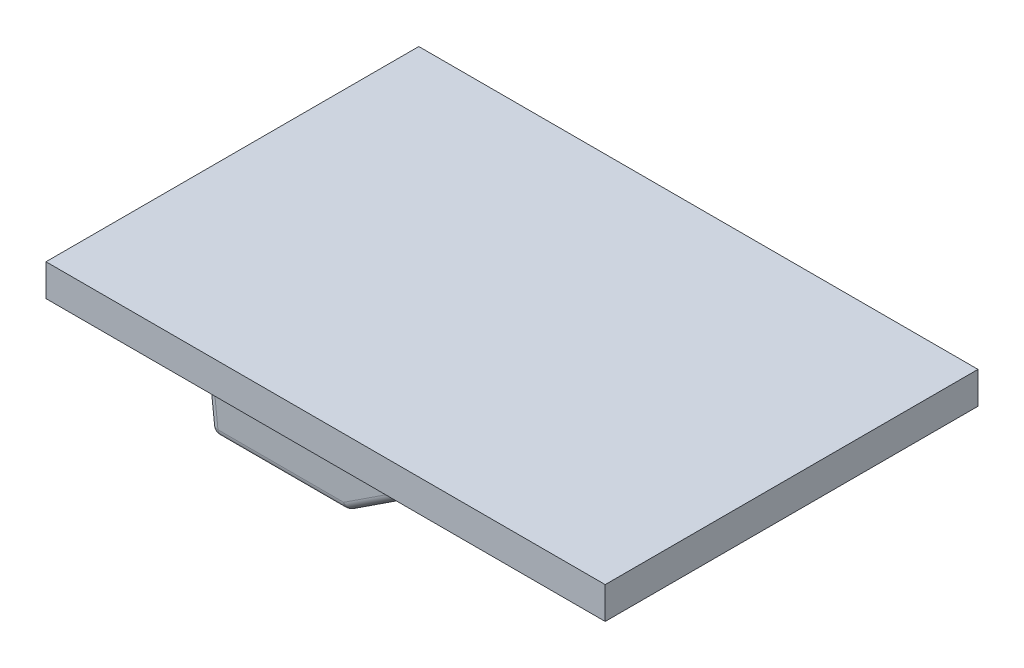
ISO-10303-21;
HEADER;
FILE_DESCRIPTION(('STEP AP214'),'2;1');
FILE_NAME('part.step','',(''),(''),'','','');
FILE_SCHEMA(('AUTOMOTIVE_DESIGN { 1 0 10303 214 1 1 1 1 }'));
ENDSEC;
DATA;
#1=APPLICATION_CONTEXT('core data for automotive mechanical design processes');
#2=APPLICATION_PROTOCOL_DEFINITION('international standard','automotive_design',2000,#1);
#3=PRODUCT_CONTEXT('',#1,'mechanical');
#4=PRODUCT('Part','Part','',(#3));
#5=PRODUCT_RELATED_PRODUCT_CATEGORY('part','',(#4));
#6=PRODUCT_DEFINITION_FORMATION('','',#4);
#7=PRODUCT_DEFINITION_CONTEXT('part definition',#1,'design');
#8=PRODUCT_DEFINITION('design','',#6,#7);
#9=PRODUCT_DEFINITION_SHAPE('','',#8);
#10=(LENGTH_UNIT() NAMED_UNIT(*) SI_UNIT(.MILLI.,.METRE.));
#11=(NAMED_UNIT(*) PLANE_ANGLE_UNIT() SI_UNIT($,.RADIAN.));
#12=(NAMED_UNIT(*) SI_UNIT($,.STERADIAN.) SOLID_ANGLE_UNIT());
#13=UNCERTAINTY_MEASURE_WITH_UNIT(LENGTH_MEASURE(1.E-05),#10,'distance_accuracy_value','');
#14=(GEOMETRIC_REPRESENTATION_CONTEXT(3) GLOBAL_UNCERTAINTY_ASSIGNED_CONTEXT((#13)) GLOBAL_UNIT_ASSIGNED_CONTEXT((#10,
#11,#12)) REPRESENTATION_CONTEXT('',''));
#15=CARTESIAN_POINT('',(0.,0.,0.));
#16=DIRECTION('',(0.,0.,1.));
#17=DIRECTION('',(1.,0.,0.));
#18=AXIS2_PLACEMENT_3D('',#15,#16,#17);
#19=CARTESIAN_POINT('',(194.243103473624,54.1874487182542,110.000010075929));
#20=DIRECTION('',(0.,-1.,0.));
#21=DIRECTION('',(0.,0.,-1.));
#22=AXIS2_PLACEMENT_3D('',#19,#20,#21);
#23=PLANE('',#22);
#24=CARTESIAN_POINT('',(-174.256896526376,54.1874487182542,1.00759284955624E-05));
#25=DIRECTION('',(0.,1.,0.));
#26=DIRECTION('',(0.,0.,1.));
#27=AXIS2_PLACEMENT_3D('',#24,#25,#26);
#28=CIRCLE('',#27,2.75);
#29=CARTESIAN_POINT('',(-174.256896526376,54.1874487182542,2.75001007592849));
#30=VERTEX_POINT('',#29);
#31=EDGE_CURVE('E1606',#30,#30,#28,.T.);
#32=ORIENTED_EDGE('',*,*,#31,.T.);
#33=EDGE_LOOP('',(#32));
#34=FACE_BOUND('',#33,.T.);
#35=CARTESIAN_POINT('',(177.743103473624,54.1874487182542,1.00759284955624E-05));
#36=DIRECTION('',(0.,1.,0.));
#37=DIRECTION('',(0.,0.,1.));
#38=AXIS2_PLACEMENT_3D('',#35,#36,#37);
#39=CIRCLE('',#38,2.75);
#40=CARTESIAN_POINT('',(177.743103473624,54.1874487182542,2.75001007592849));
#41=VERTEX_POINT('',#40);
#42=EDGE_CURVE('E906',#41,#41,#39,.T.);
#43=ORIENTED_EDGE('',*,*,#42,.T.);
#44=EDGE_LOOP('',(#43));
#45=FACE_BOUND('',#44,.T.);
#46=DIRECTION('',(0.,0.,1.));
#47=VECTOR('',#46,1.);
#48=CARTESIAN_POINT('',(190.938574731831,54.1874487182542,110.000010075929));
#49=LINE('',#48,#47);
#50=CARTESIAN_POINT('',(190.938574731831,54.1874487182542,99.0060339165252));
#51=VERTEX_POINT('',#50);
#52=CARTESIAN_POINT('',(190.938574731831,54.1874487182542,15.9394574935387));
#53=VERTEX_POINT('',#52);
#54=EDGE_CURVE('E139',#51,#53,#49,.F.);
#55=ORIENTED_EDGE('',*,*,#54,.T.);
#56=CARTESIAN_POINT('',(183.228007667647,54.1874487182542,15.9605771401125));
#57=DIRECTION('',(0.,-1.,0.));
#58=DIRECTION('',(0.707106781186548,0.,-0.707106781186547));
#59=AXIS2_PLACEMENT_3D('',#56,#57,#58);
#60=ELLIPSE('',#59,7.72111966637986,7.7);
#61=CARTESIAN_POINT('',(183.249127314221,54.1874487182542,8.2500100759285));
#62=VERTEX_POINT('',#61);
#63=EDGE_CURVE('E951',#62,#53,#60,.T.);
#64=ORIENTED_EDGE('',*,*,#63,.F.);
#65=DIRECTION('',(-1.,0.,0.));
#66=VECTOR('',#65,1.);
#67=CARTESIAN_POINT('',(177.743103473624,54.1874487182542,8.2500100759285));
#68=LINE('',#67,#66);
#69=CARTESIAN_POINT('',(177.743103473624,54.1874487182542,8.2500100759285));
#70=VERTEX_POINT('',#69);
#71=EDGE_CURVE('E948',#62,#70,#68,.T.);
#72=ORIENTED_EDGE('',*,*,#71,.T.);
#73=CARTESIAN_POINT('',(177.743103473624,54.1874487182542,1.00759284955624E-05));
#74=DIRECTION('',(0.,-1.,0.));
#75=DIRECTION('',(0.,0.,1.));
#76=AXIS2_PLACEMENT_3D('',#73,#74,#75);
#77=CIRCLE('',#76,8.25);
#78=CARTESIAN_POINT('',(177.743103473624,54.1874487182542,-8.24998992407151));
#79=VERTEX_POINT('',#78);
#80=EDGE_CURVE('E945',#70,#79,#77,.T.);
#81=ORIENTED_EDGE('',*,*,#80,.T.);
#82=DIRECTION('',(1.,0.,0.));
#83=VECTOR('',#82,1.);
#84=CARTESIAN_POINT('',(177.743103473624,54.1874487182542,-8.24998992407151));
#85=LINE('',#84,#83);
#86=CARTESIAN_POINT('',(183.249127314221,54.1874487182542,-8.24998992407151));
#87=VERTEX_POINT('',#86);
#88=EDGE_CURVE('E942',#79,#87,#85,.T.);
#89=ORIENTED_EDGE('',*,*,#88,.T.);
#90=CARTESIAN_POINT('',(183.228007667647,54.1874487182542,-15.9605569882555));
#91=DIRECTION('',(0.,-1.,0.));
#92=DIRECTION('',(-0.707106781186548,0.,-0.707106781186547));
#93=AXIS2_PLACEMENT_3D('',#90,#91,#92);
#94=ELLIPSE('',#93,7.72111966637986,7.7);
#95=CARTESIAN_POINT('',(190.938574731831,54.1874487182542,-15.9394373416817));
#96=VERTEX_POINT('',#95);
#97=EDGE_CURVE('E939',#96,#87,#94,.T.);
#98=ORIENTED_EDGE('',*,*,#97,.F.);
#99=CARTESIAN_POINT('',(190.938574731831,54.1874487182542,-99.0060137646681));
#100=VERTEX_POINT('',#99);
#101=EDGE_CURVE('E908',#96,#100,#49,.F.);
#102=ORIENTED_EDGE('',*,*,#101,.T.);
#103=CARTESIAN_POINT('',(183.228007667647,54.1874487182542,-98.9848941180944));
#104=DIRECTION('',(0.,-1.,0.));
#105=DIRECTION('',(0.707106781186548,0.,-0.707106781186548));
#106=AXIS2_PLACEMENT_3D('',#103,#104,#105);
#107=ELLIPSE('',#106,7.72111966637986,7.7);
#108=CARTESIAN_POINT('',(183.249127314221,54.1874487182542,-106.695461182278));
#109=VERTEX_POINT('',#108);
#110=EDGE_CURVE('E823',#100,#109,#107,.F.);
#111=ORIENTED_EDGE('',*,*,#110,.T.);
#112=DIRECTION('',(1.,0.,0.));
#113=VECTOR('',#112,1.);
#114=CARTESIAN_POINT('',(194.243103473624,54.1874487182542,-106.695461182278));
#115=LINE('',#114,#113);
#116=CARTESIAN_POINT('',(-179.762920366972,54.1874487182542,-106.695461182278));
#117=VERTEX_POINT('',#116);
#118=EDGE_CURVE('E935',#109,#117,#115,.F.);
#119=ORIENTED_EDGE('',*,*,#118,.T.);
#120=CARTESIAN_POINT('',(-179.741800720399,54.1874487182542,-98.9848941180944));
#121=DIRECTION('',(0.,-1.,0.));
#122=DIRECTION('',(0.707106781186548,0.,0.707106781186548));
#123=AXIS2_PLACEMENT_3D('',#120,#121,#122);
#124=ELLIPSE('',#123,7.72111966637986,7.7);
#125=CARTESIAN_POINT('',(-187.452367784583,54.1874487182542,-99.0060137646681));
#126=VERTEX_POINT('',#125);
#127=EDGE_CURVE('E917',#117,#126,#124,.F.);
#128=ORIENTED_EDGE('',*,*,#127,.T.);
#129=DIRECTION('',(0.,0.,1.));
#130=VECTOR('',#129,1.);
#131=CARTESIAN_POINT('',(-187.452367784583,54.1874487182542,110.000010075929));
#132=LINE('',#131,#130);
#133=CARTESIAN_POINT('',(-187.452367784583,54.1874487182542,-15.9394373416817));
#134=VERTEX_POINT('',#133);
#135=EDGE_CURVE('E914',#134,#126,#132,.F.);
#136=ORIENTED_EDGE('',*,*,#135,.F.);
#137=CARTESIAN_POINT('',(-179.741800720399,54.1874487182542,-15.9605569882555));
#138=DIRECTION('',(0.,-1.,0.));
#139=DIRECTION('',(0.707106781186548,0.,-0.707106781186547));
#140=AXIS2_PLACEMENT_3D('',#137,#138,#139);
#141=ELLIPSE('',#140,7.72111966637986,7.7);
#142=CARTESIAN_POINT('',(-179.762920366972,54.1874487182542,-8.24998992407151));
#143=VERTEX_POINT('',#142);
#144=EDGE_CURVE('E918',#143,#134,#141,.T.);
#145=ORIENTED_EDGE('',*,*,#144,.F.);
#146=DIRECTION('',(-1.,0.,0.));
#147=VECTOR('',#146,1.);
#148=CARTESIAN_POINT('',(-174.256896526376,54.1874487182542,-8.24998992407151));
#149=LINE('',#148,#147);
#150=CARTESIAN_POINT('',(-174.256896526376,54.1874487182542,-8.24998992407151));
#151=VERTEX_POINT('',#150);
#152=EDGE_CURVE('E928',#151,#143,#149,.T.);
#153=ORIENTED_EDGE('',*,*,#152,.F.);
#154=CARTESIAN_POINT('',(-174.256896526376,54.1874487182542,1.00759284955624E-05));
#155=DIRECTION('',(0.,1.,0.));
#156=DIRECTION('',(0.,0.,1.));
#157=AXIS2_PLACEMENT_3D('',#154,#155,#156);
#158=CIRCLE('',#157,8.25);
#159=CARTESIAN_POINT('',(-174.256896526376,54.1874487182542,8.2500100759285));
#160=VERTEX_POINT('',#159);
#161=EDGE_CURVE('E925',#160,#151,#158,.T.);
#162=ORIENTED_EDGE('',*,*,#161,.F.);
#163=DIRECTION('',(1.,0.,0.));
#164=VECTOR('',#163,1.);
#165=CARTESIAN_POINT('',(-174.256896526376,54.1874487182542,8.2500100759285));
#166=LINE('',#165,#164);
#167=CARTESIAN_POINT('',(-179.762920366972,54.1874487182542,8.2500100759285));
#168=VERTEX_POINT('',#167);
#169=EDGE_CURVE('E922',#168,#160,#166,.T.);
#170=ORIENTED_EDGE('',*,*,#169,.F.);
#171=CARTESIAN_POINT('',(-179.741800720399,54.1874487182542,15.9605771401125));
#172=DIRECTION('',(0.,-1.,0.));
#173=DIRECTION('',(-0.707106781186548,0.,-0.707106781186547));
#174=AXIS2_PLACEMENT_3D('',#171,#172,#173);
#175=ELLIPSE('',#174,7.72111966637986,7.7);
#176=CARTESIAN_POINT('',(-187.452367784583,54.1874487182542,15.9394574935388));
#177=VERTEX_POINT('',#176);
#178=EDGE_CURVE('E919',#177,#168,#175,.T.);
#179=ORIENTED_EDGE('',*,*,#178,.F.);
#180=CARTESIAN_POINT('',(-187.452367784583,54.1874487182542,99.0060339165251));
#181=VERTEX_POINT('',#180);
#182=EDGE_CURVE('E913',#181,#177,#132,.F.);
#183=ORIENTED_EDGE('',*,*,#182,.F.);
#184=CARTESIAN_POINT('',(-179.741800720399,54.1874487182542,98.9849142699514));
#185=DIRECTION('',(0.,-1.,0.));
#186=DIRECTION('',(0.707106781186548,0.,-0.707106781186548));
#187=AXIS2_PLACEMENT_3D('',#184,#185,#186);
#188=ELLIPSE('',#187,7.72111966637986,7.7);
#189=CARTESIAN_POINT('',(-179.762920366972,54.1874487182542,106.695481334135));
#190=VERTEX_POINT('',#189);
#191=EDGE_CURVE('E904',#181,#190,#188,.F.);
#192=ORIENTED_EDGE('',*,*,#191,.T.);
#193=DIRECTION('',(-1.,0.,0.));
#194=VECTOR('',#193,1.);
#195=CARTESIAN_POINT('',(194.243103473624,54.1874487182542,106.695481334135));
#196=LINE('',#195,#194);
#197=CARTESIAN_POINT('',(183.249127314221,54.1874487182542,106.695481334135));
#198=VERTEX_POINT('',#197);
#199=EDGE_CURVE('E902',#198,#190,#196,.T.);
#200=ORIENTED_EDGE('',*,*,#199,.F.);
#201=CARTESIAN_POINT('',(183.228007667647,54.1874487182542,98.9849142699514));
#202=DIRECTION('',(0.,-1.,0.));
#203=DIRECTION('',(0.707106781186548,0.,0.707106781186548));
#204=AXIS2_PLACEMENT_3D('',#201,#202,#203);
#205=ELLIPSE('',#204,7.72111966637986,7.7);
#206=EDGE_CURVE('E901',#198,#51,#205,.F.);
#207=ORIENTED_EDGE('',*,*,#206,.T.);
#208=EDGE_LOOP('',(#55,#64,#72,#81,#89,#98,#102,#111,#119,#128,#136,#145,#153,#162,#170,#179,
#183,#192,#200,#207));
#209=FACE_BOUND('',#208,.T.);
#210=DIRECTION('',(0.,0.,-1.));
#211=VECTOR('',#210,1.);
#212=CARTESIAN_POINT('',(210.743103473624,54.1874487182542,126.500010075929));
#213=LINE('',#212,#211);
#214=CARTESIAN_POINT('',(210.743103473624,54.1874487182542,115.500010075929));
#215=VERTEX_POINT('',#214);
#216=CARTESIAN_POINT('',(210.743103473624,54.1874487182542,-115.499989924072));
#217=VERTEX_POINT('',#216);
#218=EDGE_CURVE('E954',#215,#217,#213,.T.);
#219=ORIENTED_EDGE('',*,*,#218,.F.);
#220=CARTESIAN_POINT('',(199.743103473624,54.1874487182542,115.500010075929));
#221=DIRECTION('',(0.,-1.,0.));
#222=DIRECTION('',(0.,0.,-1.));
#223=AXIS2_PLACEMENT_3D('',#220,#221,#222);
#224=CIRCLE('',#223,11.);
#225=CARTESIAN_POINT('',(199.743103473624,54.1874487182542,126.500010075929));
#226=VERTEX_POINT('',#225);
#227=EDGE_CURVE('E958',#226,#215,#224,.F.);
#228=ORIENTED_EDGE('',*,*,#227,.F.);
#229=DIRECTION('',(1.,0.,0.));
#230=VECTOR('',#229,1.);
#231=CARTESIAN_POINT('',(-207.256896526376,54.1874487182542,126.500010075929));
#232=LINE('',#231,#230);
#233=CARTESIAN_POINT('',(-196.256896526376,54.1874487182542,126.500010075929));
#234=VERTEX_POINT('',#233);
#235=EDGE_CURVE('E955',#234,#226,#232,.T.);
#236=ORIENTED_EDGE('',*,*,#235,.F.);
#237=CARTESIAN_POINT('',(-196.256896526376,54.1874487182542,115.500010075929));
#238=DIRECTION('',(0.,-1.,0.));
#239=DIRECTION('',(0.,0.,-1.));
#240=AXIS2_PLACEMENT_3D('',#237,#238,#239);
#241=CIRCLE('',#240,11.);
#242=CARTESIAN_POINT('',(-207.256896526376,54.1874487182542,115.500010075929));
#243=VERTEX_POINT('',#242);
#244=EDGE_CURVE('E959',#243,#234,#241,.F.);
#245=ORIENTED_EDGE('',*,*,#244,.F.);
#246=DIRECTION('',(0.,0.,1.));
#247=VECTOR('',#246,1.);
#248=CARTESIAN_POINT('',(-207.256896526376,54.1874487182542,126.500010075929));
#249=LINE('',#248,#247);
#250=CARTESIAN_POINT('',(-207.256896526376,54.1874487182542,-115.499989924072));
#251=VERTEX_POINT('',#250);
#252=EDGE_CURVE('E972',#251,#243,#249,.T.);
#253=ORIENTED_EDGE('',*,*,#252,.F.);
#254=CARTESIAN_POINT('',(-196.256896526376,54.1874487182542,-115.499989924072));
#255=DIRECTION('',(0.,-1.,0.));
#256=DIRECTION('',(0.,0.,-1.));
#257=AXIS2_PLACEMENT_3D('',#254,#255,#256);
#258=CIRCLE('',#257,11.);
#259=CARTESIAN_POINT('',(-196.256896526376,54.1874487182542,-126.499989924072));
#260=VERTEX_POINT('',#259);
#261=EDGE_CURVE('E977',#260,#251,#258,.F.);
#262=ORIENTED_EDGE('',*,*,#261,.F.);
#263=DIRECTION('',(-1.,0.,0.));
#264=VECTOR('',#263,1.);
#265=CARTESIAN_POINT('',(-207.256896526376,54.1874487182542,-126.499989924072));
#266=LINE('',#265,#264);
#267=CARTESIAN_POINT('',(199.743103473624,54.1874487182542,-126.499989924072));
#268=VERTEX_POINT('',#267);
#269=EDGE_CURVE('E982',#268,#260,#266,.T.);
#270=ORIENTED_EDGE('',*,*,#269,.F.);
#271=CARTESIAN_POINT('',(199.743103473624,54.1874487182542,-115.499989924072));
#272=DIRECTION('',(0.,-1.,0.));
#273=DIRECTION('',(0.,0.,-1.));
#274=AXIS2_PLACEMENT_3D('',#271,#272,#273);
#275=CIRCLE('',#274,11.);
#276=EDGE_CURVE('E148',#217,#268,#275,.F.);
#277=ORIENTED_EDGE('',*,*,#276,.F.);
#278=EDGE_LOOP('',(#219,#228,#236,#245,#253,#262,#270,#277));
#279=FACE_BOUND('',#278,.T.);
#280=ADVANCED_FACE('F56',(#34,#45,#209,#279),#23,.T.);
#281=CARTESIAN_POINT('',(0.,54.1874487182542,0.));
#282=DIRECTION('',(0.,1.,0.));
#283=DIRECTION('',(0.,0.,1.));
#284=AXIS2_PLACEMENT_3D('',#281,#282,#283);
#285=PLANE('',#284);
#286=ORIENTED_EDGE('',*,*,#252,.T.);
#287=ORIENTED_EDGE('',*,*,#244,.T.);
#288=ORIENTED_EDGE('',*,*,#235,.T.);
#289=ORIENTED_EDGE('',*,*,#227,.T.);
#290=ORIENTED_EDGE('',*,*,#218,.T.);
#291=ORIENTED_EDGE('',*,*,#276,.T.);
#292=ORIENTED_EDGE('',*,*,#269,.T.);
#293=ORIENTED_EDGE('',*,*,#261,.T.);
#294=EDGE_LOOP('',(#286,#287,#288,#289,#290,#291,#292,#293));
#295=FACE_BOUND('',#294,.T.);
#296=DIRECTION('',(-1.,0.,0.));
#297=VECTOR('',#296,1.);
#298=CARTESIAN_POINT('',(0.,54.1874487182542,175.));
#299=LINE('',#298,#297);
#300=CARTESIAN_POINT('',(262.5,54.1874487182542,175.));
#301=VERTEX_POINT('',#300);
#302=CARTESIAN_POINT('',(-262.5,54.1874487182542,175.));
#303=VERTEX_POINT('',#302);
#304=EDGE_CURVE('E1596',#301,#303,#299,.T.);
#305=ORIENTED_EDGE('',*,*,#304,.T.);
#306=DIRECTION('',(0.,0.,1.));
#307=VECTOR('',#306,1.);
#308=CARTESIAN_POINT('',(-262.5,54.1874487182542,0.));
#309=LINE('',#308,#307);
#310=CARTESIAN_POINT('',(-262.5,54.1874487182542,-175.));
#311=VERTEX_POINT('',#310);
#312=EDGE_CURVE('E1610',#311,#303,#309,.T.);
#313=ORIENTED_EDGE('',*,*,#312,.F.);
#314=DIRECTION('',(-1.,0.,0.));
#315=VECTOR('',#314,1.);
#316=CARTESIAN_POINT('',(0.,54.1874487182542,-175.));
#317=LINE('',#316,#315);
#318=CARTESIAN_POINT('',(262.5,54.1874487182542,-175.));
#319=VERTEX_POINT('',#318);
#320=EDGE_CURVE('E1613',#319,#311,#317,.T.);
#321=ORIENTED_EDGE('',*,*,#320,.F.);
#322=DIRECTION('',(0.,0.,1.));
#323=VECTOR('',#322,1.);
#324=CARTESIAN_POINT('',(262.5,54.1874487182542,0.));
#325=LINE('',#324,#323);
#326=EDGE_CURVE('E1603',#319,#301,#325,.T.);
#327=ORIENTED_EDGE('',*,*,#326,.T.);
#328=EDGE_LOOP('',(#305,#313,#321,#327));
#329=FACE_BOUND('',#328,.T.);
#330=ADVANCED_FACE('F461',(#295,#329),#285,.F.);
#331=CARTESIAN_POINT('',(183.234087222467,54.3034535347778,15.9544975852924));
#332=DIRECTION('',(0.052264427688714,0.997264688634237,-0.052264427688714));
#333=DIRECTION('',(-0.998629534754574,0.0523359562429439,0.));
#334=AXIS2_PLACEMENT_3D('',#331,#332,#333);
#335=CYLINDRICAL_SURFACE('',#334,7.7);
#336=CARTESIAN_POINT('',(180.922065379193,10.1874487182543,18.2665194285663));
#337=DIRECTION('',(-0.0522644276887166,-0.997264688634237,0.0522644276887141));
#338=DIRECTION('',(0.998629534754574,-0.0523359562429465,0.));
#339=AXIS2_PLACEMENT_3D('',#336,#337,#338);
#340=CIRCLE('',#339,7.7);
#341=CARTESIAN_POINT('',(180.922065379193,9.78446185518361,10.5770720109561));
#342=VERTEX_POINT('',#341);
#343=CARTESIAN_POINT('',(188.611512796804,9.7844618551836,18.2665194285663));
#344=VERTEX_POINT('',#343);
#345=EDGE_CURVE('E964',#342,#344,#340,.T.);
#346=ORIENTED_EDGE('',*,*,#345,.F.);
#347=DIRECTION('',(-0.052264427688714,-0.997264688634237,0.052264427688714));
#348=VECTOR('',#347,1.);
#349=CARTESIAN_POINT('',(183.234087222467,53.9004666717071,8.26505016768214));
#350=LINE('',#349,#348);
#351=EDGE_CURVE('E997',#342,#62,#350,.F.);
#352=ORIENTED_EDGE('',*,*,#351,.T.);
#353=ORIENTED_EDGE('',*,*,#63,.T.);
#354=DIRECTION('',(-0.052264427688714,-0.997264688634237,0.052264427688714));
#355=VECTOR('',#354,1.);
#356=CARTESIAN_POINT('',(190.690668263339,49.457111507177,16.1873639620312));
#357=LINE('',#356,#355);
#358=EDGE_CURVE('E994',#53,#344,#357,.T.);
#359=ORIENTED_EDGE('',*,*,#358,.T.);
#360=EDGE_LOOP('',(#346,#352,#353,#359));
#361=FACE_BOUND('',#360,.T.);
#362=ADVANCED_FACE('F467',(#361),#335,.T.);
#363=CARTESIAN_POINT('',(177.743103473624,54.1874487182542,8.2500100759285));
#364=DIRECTION('',(0.,0.0523359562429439,0.998629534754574));
#365=DIRECTION('',(0.,-0.998629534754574,0.052335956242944));
#366=AXIS2_PLACEMENT_3D('',#363,#364,#365);
#367=PLANE('',#366);
#368=DIRECTION('',(1.,0.,0.));
#369=VECTOR('',#368,1.);
#370=CARTESIAN_POINT('',(177.743103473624,9.78446185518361,10.5770720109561));
#371=LINE('',#370,#369);
#372=CARTESIAN_POINT('',(177.743103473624,9.78446185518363,10.5770720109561));
#373=VERTEX_POINT('',#372);
#374=EDGE_CURVE('E999',#373,#342,#371,.T.);
#375=ORIENTED_EDGE('',*,*,#374,.F.);
#376=DIRECTION('',(0.,-0.998629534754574,0.0523359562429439));
#377=VECTOR('',#376,1.);
#378=CARTESIAN_POINT('',(177.743103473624,54.1874487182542,8.2500100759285));
#379=LINE('',#378,#377);
#380=EDGE_CURVE('E1002',#373,#70,#379,.F.);
#381=ORIENTED_EDGE('',*,*,#380,.T.);
#382=ORIENTED_EDGE('',*,*,#71,.F.);
#383=ORIENTED_EDGE('',*,*,#351,.F.);
#384=EDGE_LOOP('',(#375,#381,#382,#383));
#385=FACE_BOUND('',#384,.T.);
#386=ADVANCED_FACE('F478',(#385),#367,.F.);
#387=CARTESIAN_POINT('',(177.743103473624,54.1874487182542,1.00759284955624E-05));
#388=DIRECTION('',(0.,-1.,0.));
#389=DIRECTION('',(0.,0.,1.));
#390=AXIS2_PLACEMENT_3D('',#387,#388,#389);
#391=CONICAL_SURFACE('',#390,8.25,0.05235987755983);
#392=DIRECTION('',(0.,-0.998629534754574,-0.0523359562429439));
#393=VECTOR('',#392,1.);
#394=CARTESIAN_POINT('',(177.743103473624,54.1874487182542,-8.24998992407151));
#395=LINE('',#394,#393);
#396=CARTESIAN_POINT('',(177.743103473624,9.78446185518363,-10.5770518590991));
#397=VERTEX_POINT('',#396);
#398=EDGE_CURVE('E1004',#397,#79,#395,.F.);
#399=ORIENTED_EDGE('',*,*,#398,.T.);
#400=ORIENTED_EDGE('',*,*,#80,.F.);
#401=ORIENTED_EDGE('',*,*,#380,.F.);
#402=CARTESIAN_POINT('',(177.743103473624,9.78446185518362,1.00759284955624E-05));
#403=DIRECTION('',(0.,1.,0.));
#404=DIRECTION('',(0.,0.,1.));
#405=AXIS2_PLACEMENT_3D('',#402,#403,#404);
#406=CIRCLE('',#405,10.5770619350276);
#407=EDGE_CURVE('E1006',#397,#373,#406,.T.);
#408=ORIENTED_EDGE('',*,*,#407,.F.);
#409=EDGE_LOOP('',(#399,#400,#401,#408));
#410=FACE_BOUND('',#409,.T.);
#411=ADVANCED_FACE('F482',(#410),#391,.F.);
#412=CARTESIAN_POINT('',(177.743103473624,54.1874487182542,-8.24998992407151));
#413=DIRECTION('',(0.,0.0523359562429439,-0.998629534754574));
#414=DIRECTION('',(0.,0.998629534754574,0.052335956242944));
#415=AXIS2_PLACEMENT_3D('',#412,#413,#414);
#416=PLANE('',#415);
#417=DIRECTION('',(0.052264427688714,0.997264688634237,0.052264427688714));
#418=VECTOR('',#417,1.);
#419=CARTESIAN_POINT('',(183.234087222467,53.9004666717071,-8.26503001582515));
#420=LINE('',#419,#418);
#421=CARTESIAN_POINT('',(180.922065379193,9.78446185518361,-10.5770518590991));
#422=VERTEX_POINT('',#421);
#423=EDGE_CURVE('E1009',#87,#422,#420,.F.);
#424=ORIENTED_EDGE('',*,*,#423,.F.);
#425=ORIENTED_EDGE('',*,*,#88,.F.);
#426=ORIENTED_EDGE('',*,*,#398,.F.);
#427=DIRECTION('',(-1.,0.,0.));
#428=VECTOR('',#427,1.);
#429=CARTESIAN_POINT('',(177.743103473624,9.78446185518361,-10.5770518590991));
#430=LINE('',#429,#428);
#431=EDGE_CURVE('E1012',#422,#397,#430,.T.);
#432=ORIENTED_EDGE('',*,*,#431,.F.);
#433=EDGE_LOOP('',(#424,#425,#426,#432));
#434=FACE_BOUND('',#433,.T.);
#435=ADVANCED_FACE('F486',(#434),#416,.F.);
#436=CARTESIAN_POINT('',(183.234087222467,54.3034535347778,-15.9544774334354));
#437=DIRECTION('',(-0.052264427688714,-0.997264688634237,-0.052264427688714));
#438=DIRECTION('',(0.998629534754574,-0.0523359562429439,0.));
#439=AXIS2_PLACEMENT_3D('',#436,#437,#438);
#440=CYLINDRICAL_SURFACE('',#439,7.7);
#441=ORIENTED_EDGE('',*,*,#97,.T.);
#442=ORIENTED_EDGE('',*,*,#423,.T.);
#443=CARTESIAN_POINT('',(180.922065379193,10.1874487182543,-18.2664992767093));
#444=DIRECTION('',(0.0522644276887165,0.997264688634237,0.0522644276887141));
#445=DIRECTION('',(-0.998629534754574,0.0523359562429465,0.));
#446=AXIS2_PLACEMENT_3D('',#443,#444,#445);
#447=CIRCLE('',#446,7.7);
#448=CARTESIAN_POINT('',(188.611512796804,9.7844618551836,-18.2664992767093));
#449=VERTEX_POINT('',#448);
#450=EDGE_CURVE('E829',#422,#449,#447,.T.);
#451=ORIENTED_EDGE('',*,*,#450,.T.);
#452=DIRECTION('',(0.052264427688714,0.997264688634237,0.052264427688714));
#453=VECTOR('',#452,1.);
#454=CARTESIAN_POINT('',(191.291613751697,60.923834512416,-15.5863983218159));
#455=LINE('',#454,#453);
#456=EDGE_CURVE('E1015',#449,#96,#455,.T.);
#457=ORIENTED_EDGE('',*,*,#456,.T.);
#458=EDGE_LOOP('',(#441,#442,#451,#457));
#459=FACE_BOUND('',#458,.T.);
#460=ADVANCED_FACE('F490',(#459),#440,.T.);
#461=CARTESIAN_POINT('',(190.947626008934,54.3601573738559,110.000010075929));
#462=DIRECTION('',(0.998629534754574,-0.0523359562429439,0.));
#463=DIRECTION('',(0.052335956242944,0.998629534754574,0.));
#464=AXIS2_PLACEMENT_3D('',#461,#462,#463);
#465=PLANE('',#464);
#466=DIRECTION('',(0.,0.,1.));
#467=VECTOR('',#466,1.);
#468=CARTESIAN_POINT('',(188.611512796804,9.7844618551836,110.000010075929));
#469=LINE('',#468,#467);
#470=CARTESIAN_POINT('',(188.611512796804,9.7844618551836,-96.6789518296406));
#471=VERTEX_POINT('',#470);
#472=EDGE_CURVE('E826',#449,#471,#469,.F.);
#473=ORIENTED_EDGE('',*,*,#472,.T.);
#474=DIRECTION('',(0.052264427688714,0.997264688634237,-0.052264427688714));
#475=VECTOR('',#474,1.);
#476=CARTESIAN_POINT('',(190.376686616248,43.465984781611,-98.4441256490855));
#477=LINE('',#476,#475);
#478=EDGE_CURVE('E821',#471,#100,#477,.T.);
#479=ORIENTED_EDGE('',*,*,#478,.T.);
#480=ORIENTED_EDGE('',*,*,#101,.F.);
#481=ORIENTED_EDGE('',*,*,#456,.F.);
#482=EDGE_LOOP('',(#473,#479,#480,#481));
#483=FACE_BOUND('',#482,.T.);
#484=ADVANCED_FACE('F494',(#483),#465,.T.);
#485=CARTESIAN_POINT('',(182.687239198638,43.8689716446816,-98.4441256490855));
#486=DIRECTION('',(0.052264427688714,0.997264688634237,-0.052264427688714));
#487=DIRECTION('',(0.,0.0523359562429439,0.998629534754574));
#488=AXIS2_PLACEMENT_3D('',#485,#486,#487);
#489=CYLINDRICAL_SURFACE('',#488,7.7);
#490=ORIENTED_EDGE('',*,*,#110,.F.);
#491=ORIENTED_EDGE('',*,*,#478,.F.);
#492=CARTESIAN_POINT('',(180.922065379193,10.1874487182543,-96.6789518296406));
#493=DIRECTION('',(0.052264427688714,0.997264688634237,-0.052264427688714));
#494=DIRECTION('',(0.,0.0523359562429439,0.998629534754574));
#495=AXIS2_PLACEMENT_3D('',#492,#493,#494);
#496=CIRCLE('',#495,7.7);
#497=CARTESIAN_POINT('',(180.922065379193,9.7844618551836,-104.368399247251));
#498=VERTEX_POINT('',#497);
#499=EDGE_CURVE('E814',#498,#471,#496,.F.);
#500=ORIENTED_EDGE('',*,*,#499,.F.);
#501=DIRECTION('',(0.052264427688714,0.997264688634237,-0.052264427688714));
#502=VECTOR('',#501,1.);
#503=CARTESIAN_POINT('',(182.687239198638,43.465984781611,-106.133573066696));
#504=LINE('',#503,#502);
#505=EDGE_CURVE('E818',#109,#498,#504,.F.);
#506=ORIENTED_EDGE('',*,*,#505,.F.);
#507=EDGE_LOOP('',(#490,#491,#500,#506));
#508=FACE_BOUND('',#507,.T.);
#509=ADVANCED_FACE('F498',(#508),#489,.T.);
#510=CARTESIAN_POINT('',(194.243103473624,54.3601573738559,-106.704512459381));
#511=DIRECTION('',(0.,-0.0523359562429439,-0.998629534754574));
#512=DIRECTION('',(0.,0.998629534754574,-0.052335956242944));
#513=AXIS2_PLACEMENT_3D('',#510,#511,#512);
#514=PLANE('',#513);
#515=ORIENTED_EDGE('',*,*,#118,.F.);
#516=ORIENTED_EDGE('',*,*,#505,.T.);
#517=DIRECTION('',(1.,0.,0.));
#518=VECTOR('',#517,1.);
#519=CARTESIAN_POINT('',(194.243103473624,9.7844618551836,-104.368399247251));
#520=LINE('',#519,#518);
#521=CARTESIAN_POINT('',(32.5736354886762,9.7844618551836,-104.368399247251));
#522=VERTEX_POINT('',#521);
#523=EDGE_CURVE('E811',#498,#522,#520,.F.);
#524=ORIENTED_EDGE('',*,*,#523,.T.);
#525=CARTESIAN_POINT('',(32.5736354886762,-12.2155381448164,-103.215428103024));
#526=DIRECTION('',(0.,-0.0523359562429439,-0.998629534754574));
#527=DIRECTION('',(0.,-0.998629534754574,0.052335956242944));
#528=AXIS2_PLACEMENT_3D('',#525,#526,#527);
#529=ELLIPSE('',#528,22.0301916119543,22.);
#530=CARTESIAN_POINT('',(20.3702311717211,6.08956833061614,-104.174758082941));
#531=VERTEX_POINT('',#530);
#532=EDGE_CURVE('E840',#531,#522,#529,.T.);
#533=ORIENTED_EDGE('',*,*,#532,.F.);
#534=DIRECTION('',(-0.831698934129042,-0.554465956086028,0.0290583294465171));
#535=VECTOR('',#534,1.);
#536=CARTESIAN_POINT('',(-64.2815688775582,-50.3449650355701,-101.217149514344));
#537=LINE('',#536,#535);
#538=CARTESIAN_POINT('',(-56.5874285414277,-45.2155381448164,-101.485971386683));
#539=VERTEX_POINT('',#538);
#540=EDGE_CURVE('E837',#531,#539,#537,.T.);
#541=ORIENTED_EDGE('',*,*,#540,.T.);
#542=DIRECTION('',(1.,0.,0.));
#543=VECTOR('',#542,1.);
#544=CARTESIAN_POINT('',(194.243103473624,-45.2155381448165,-101.485971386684));
#545=LINE('',#544,#543);
#546=CARTESIAN_POINT('',(-174.553430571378,-45.2155381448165,-101.485971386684));
#547=VERTEX_POINT('',#546);
#548=EDGE_CURVE('E834',#539,#547,#545,.F.);
#549=ORIENTED_EDGE('',*,*,#548,.T.);
#550=DIRECTION('',(0.052264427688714,-0.997264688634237,0.052264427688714));
#551=VECTOR('',#550,1.);
#552=CARTESIAN_POINT('',(-179.20103225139,43.465984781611,-106.133573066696));
#553=LINE('',#552,#551);
#554=EDGE_CURVE('E817',#547,#117,#553,.F.);
#555=ORIENTED_EDGE('',*,*,#554,.T.);
#556=EDGE_LOOP('',(#515,#516,#524,#533,#541,#549,#555));
#557=FACE_BOUND('',#556,.T.);
#558=ADVANCED_FACE('F502',(#557),#514,.T.);
#559=CARTESIAN_POINT('',(-179.20103225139,43.8689716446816,-98.4441256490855));
#560=DIRECTION('',(0.052264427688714,-0.997264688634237,0.052264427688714));
#561=DIRECTION('',(0.,-0.0523359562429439,-0.998629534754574));
#562=AXIS2_PLACEMENT_3D('',#559,#560,#561);
#563=CYLINDRICAL_SURFACE('',#562,7.7);
#564=ORIENTED_EDGE('',*,*,#127,.F.);
#565=ORIENTED_EDGE('',*,*,#554,.F.);
#566=CARTESIAN_POINT('',(-174.553430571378,-44.8125512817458,-93.7965239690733));
#567=DIRECTION('',(0.052264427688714,-0.997264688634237,0.052264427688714));
#568=DIRECTION('',(0.,-0.0523359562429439,-0.998629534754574));
#569=AXIS2_PLACEMENT_3D('',#566,#567,#568);
#570=CIRCLE('',#569,7.7);
#571=CARTESIAN_POINT('',(-182.242877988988,-45.2155381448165,-93.7965239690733));
#572=VERTEX_POINT('',#571);
#573=EDGE_CURVE('E846',#572,#547,#570,.T.);
#574=ORIENTED_EDGE('',*,*,#573,.F.);
#575=DIRECTION('',(0.052264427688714,-0.997264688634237,0.052264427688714));
#576=VECTOR('',#575,1.);
#577=CARTESIAN_POINT('',(-186.890479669,43.465984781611,-98.4441256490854));
#578=LINE('',#577,#576);
#579=EDGE_CURVE('E843',#126,#572,#578,.T.);
#580=ORIENTED_EDGE('',*,*,#579,.F.);
#581=EDGE_LOOP('',(#564,#565,#574,#580));
#582=FACE_BOUND('',#581,.T.);
#583=ADVANCED_FACE('F506',(#582),#563,.T.);
#584=CARTESIAN_POINT('',(-187.461419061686,54.3601573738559,110.000010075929));
#585=DIRECTION('',(-0.998629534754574,-0.0523359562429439,0.));
#586=DIRECTION('',(0.052335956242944,-0.998629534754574,0.));
#587=AXIS2_PLACEMENT_3D('',#584,#585,#586);
#588=PLANE('',#587);
#589=ORIENTED_EDGE('',*,*,#135,.T.);
#590=ORIENTED_EDGE('',*,*,#579,.T.);
#591=DIRECTION('',(0.,0.,1.));
#592=VECTOR('',#591,1.);
#593=CARTESIAN_POINT('',(-182.242877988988,-45.2155381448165,110.000010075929));
#594=LINE('',#593,#592);
#595=CARTESIAN_POINT('',(-182.242877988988,-45.2155381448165,-21.1489271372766));
#596=VERTEX_POINT('',#595);
#597=EDGE_CURVE('E852',#572,#596,#594,.T.);
#598=ORIENTED_EDGE('',*,*,#597,.T.);
#599=DIRECTION('',(0.052264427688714,-0.997264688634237,-0.052264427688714));
#600=VECTOR('',#599,1.);
#601=CARTESIAN_POINT('',(-182.263882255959,-44.8147528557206,-21.1279228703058));
#602=LINE('',#601,#600);
#603=EDGE_CURVE('E849',#134,#596,#602,.T.);
#604=ORIENTED_EDGE('',*,*,#603,.F.);
#605=EDGE_LOOP('',(#589,#590,#598,#604));
#606=FACE_BOUND('',#605,.T.);
#607=ADVANCED_FACE('F510',(#606),#588,.T.);
#608=CARTESIAN_POINT('',(-180.115959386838,61.3268213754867,-15.5863983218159));
#609=DIRECTION('',(0.052264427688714,-0.997264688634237,-0.052264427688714));
#610=DIRECTION('',(0.998629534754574,0.0523359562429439,0.));
#611=AXIS2_PLACEMENT_3D('',#608,#609,#610);
#612=CYLINDRICAL_SURFACE('',#611,7.7);
#613=ORIENTED_EDGE('',*,*,#144,.T.);
#614=ORIENTED_EDGE('',*,*,#603,.T.);
#615=CARTESIAN_POINT('',(-174.553430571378,-44.8125512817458,-21.1489271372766));
#616=DIRECTION('',(0.0522644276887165,-0.997264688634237,-0.0522644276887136));
#617=DIRECTION('',(0.998629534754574,0.0523359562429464,0.));
#618=AXIS2_PLACEMENT_3D('',#615,#616,#617);
#619=CIRCLE('',#618,7.7);
#620=CARTESIAN_POINT('',(-174.553430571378,-45.2155381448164,-13.4594797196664));
#621=VERTEX_POINT('',#620);
#622=EDGE_CURVE('E857',#621,#596,#619,.T.);
#623=ORIENTED_EDGE('',*,*,#622,.F.);
#624=DIRECTION('',(-0.052264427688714,0.997264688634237,0.052264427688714));
#625=VECTOR('',#624,1.);
#626=CARTESIAN_POINT('',(-179.783924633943,54.5882340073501,-8.22898565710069));
#627=LINE('',#626,#625);
#628=EDGE_CURVE('E855',#621,#143,#627,.T.);
#629=ORIENTED_EDGE('',*,*,#628,.T.);
#630=EDGE_LOOP('',(#613,#614,#623,#629));
#631=FACE_BOUND('',#630,.T.);
#632=ADVANCED_FACE('F514',(#631),#612,.T.);
#633=CARTESIAN_POINT('',(-174.256896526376,54.1874487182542,-8.24998992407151));
#634=DIRECTION('',(0.,0.0523359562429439,-0.998629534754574));
#635=DIRECTION('',(0.,0.998629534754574,0.052335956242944));
#636=AXIS2_PLACEMENT_3D('',#633,#634,#635);
#637=PLANE('',#636);
#638=DIRECTION('',(1.,0.,0.));
#639=VECTOR('',#638,1.);
#640=CARTESIAN_POINT('',(-174.553430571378,-45.2155381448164,-13.4594797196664));
#641=LINE('',#640,#639);
#642=CARTESIAN_POINT('',(-174.256896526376,-45.2155381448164,-13.4594797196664));
#643=VERTEX_POINT('',#642);
#644=EDGE_CURVE('E860',#643,#621,#641,.F.);
#645=ORIENTED_EDGE('',*,*,#644,.F.);
#646=DIRECTION('',(0.,-0.998629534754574,-0.0523359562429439));
#647=VECTOR('',#646,1.);
#648=CARTESIAN_POINT('',(-174.256896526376,54.1874487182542,-8.2499899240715));
#649=LINE('',#648,#647);
#650=EDGE_CURVE('E863',#643,#151,#649,.F.);
#651=ORIENTED_EDGE('',*,*,#650,.T.);
#652=ORIENTED_EDGE('',*,*,#152,.T.);
#653=ORIENTED_EDGE('',*,*,#628,.F.);
#654=EDGE_LOOP('',(#645,#651,#652,#653));
#655=FACE_BOUND('',#654,.T.);
#656=ADVANCED_FACE('F518',(#655),#637,.F.);
#657=CARTESIAN_POINT('',(-174.256896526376,54.1874487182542,1.00759284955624E-05));
#658=DIRECTION('',(0.,-1.,0.));
#659=DIRECTION('',(0.,0.,1.));
#660=AXIS2_PLACEMENT_3D('',#657,#658,#659);
#661=CONICAL_SURFACE('',#660,8.25,0.05235987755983);
#662=DIRECTION('',(0.,-0.998629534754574,0.0523359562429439));
#663=VECTOR('',#662,1.);
#664=CARTESIAN_POINT('',(-174.256896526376,54.1874487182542,8.2500100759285));
#665=LINE('',#664,#663);
#666=CARTESIAN_POINT('',(-174.256896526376,-45.2155381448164,13.4594998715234));
#667=VERTEX_POINT('',#666);
#668=EDGE_CURVE('E865',#667,#160,#665,.F.);
#669=ORIENTED_EDGE('',*,*,#668,.T.);
#670=ORIENTED_EDGE('',*,*,#161,.T.);
#671=ORIENTED_EDGE('',*,*,#650,.F.);
#672=CARTESIAN_POINT('',(-174.256896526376,-45.2155381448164,1.00759284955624E-05));
#673=DIRECTION('',(0.,-1.,0.));
#674=DIRECTION('',(0.,0.,-1.));
#675=AXIS2_PLACEMENT_3D('',#672,#673,#674);
#676=CIRCLE('',#675,13.4594897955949);
#677=EDGE_CURVE('E867',#667,#643,#676,.F.);
#678=ORIENTED_EDGE('',*,*,#677,.F.);
#679=EDGE_LOOP('',(#669,#670,#671,#678));
#680=FACE_BOUND('',#679,.T.);
#681=ADVANCED_FACE('F522',(#680),#661,.F.);
#682=CARTESIAN_POINT('',(-174.256896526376,54.1874487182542,8.2500100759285));
#683=DIRECTION('',(0.,0.0523359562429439,0.998629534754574));
#684=DIRECTION('',(0.,-0.998629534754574,0.052335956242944));
#685=AXIS2_PLACEMENT_3D('',#682,#683,#684);
#686=PLANE('',#685);
#687=DIRECTION('',(0.052264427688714,-0.997264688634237,0.052264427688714));
#688=VECTOR('',#687,1.);
#689=CARTESIAN_POINT('',(-174.574434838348,-44.8147528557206,13.4384956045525));
#690=LINE('',#689,#688);
#691=CARTESIAN_POINT('',(-174.553430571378,-45.2155381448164,13.4594998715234));
#692=VERTEX_POINT('',#691);
#693=EDGE_CURVE('E870',#168,#692,#690,.T.);
#694=ORIENTED_EDGE('',*,*,#693,.F.);
#695=ORIENTED_EDGE('',*,*,#169,.T.);
#696=ORIENTED_EDGE('',*,*,#668,.F.);
#697=DIRECTION('',(-1.,0.,0.));
#698=VECTOR('',#697,1.);
#699=CARTESIAN_POINT('',(-174.256896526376,-45.2155381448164,13.4594998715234));
#700=LINE('',#699,#698);
#701=EDGE_CURVE('E873',#692,#667,#700,.F.);
#702=ORIENTED_EDGE('',*,*,#701,.F.);
#703=EDGE_LOOP('',(#694,#695,#696,#702));
#704=FACE_BOUND('',#703,.T.);
#705=ADVANCED_FACE('F526',(#704),#686,.F.);
#706=CARTESIAN_POINT('',(-179.51501389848,49.8600983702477,16.1873639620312));
#707=DIRECTION('',(-0.052264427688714,0.997264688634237,-0.052264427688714));
#708=DIRECTION('',(-0.998629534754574,-0.0523359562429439,0.));
#709=AXIS2_PLACEMENT_3D('',#706,#707,#708);
#710=CYLINDRICAL_SURFACE('',#709,7.7);
#711=ORIENTED_EDGE('',*,*,#178,.T.);
#712=ORIENTED_EDGE('',*,*,#693,.T.);
#713=CARTESIAN_POINT('',(-174.553430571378,-44.8125512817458,21.1489472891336));
#714=DIRECTION('',(-0.0522644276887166,0.997264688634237,-0.0522644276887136));
#715=DIRECTION('',(-0.998629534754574,-0.0523359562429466,0.));
#716=AXIS2_PLACEMENT_3D('',#713,#714,#715);
#717=CIRCLE('',#716,7.7);
#718=CARTESIAN_POINT('',(-182.242877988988,-45.2155381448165,21.1489472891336));
#719=VERTEX_POINT('',#718);
#720=EDGE_CURVE('E878',#692,#719,#717,.T.);
#721=ORIENTED_EDGE('',*,*,#720,.T.);
#722=DIRECTION('',(-0.052264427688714,0.997264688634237,-0.052264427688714));
#723=VECTOR('',#722,1.);
#724=CARTESIAN_POINT('',(-187.473372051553,54.5882340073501,15.9184532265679));
#725=LINE('',#724,#723);
#726=EDGE_CURVE('E876',#719,#177,#725,.T.);
#727=ORIENTED_EDGE('',*,*,#726,.T.);
#728=EDGE_LOOP('',(#711,#712,#721,#727));
#729=FACE_BOUND('',#728,.T.);
#730=ADVANCED_FACE('F530',(#729),#710,.T.);
#731=CARTESIAN_POINT('',(-187.461419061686,54.3601573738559,110.000010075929));
#732=DIRECTION('',(-0.998629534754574,-0.0523359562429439,0.));
#733=DIRECTION('',(0.052335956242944,-0.998629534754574,0.));
#734=AXIS2_PLACEMENT_3D('',#731,#732,#733);
#735=PLANE('',#734);
#736=DIRECTION('',(0.,0.,1.));
#737=VECTOR('',#736,1.);
#738=CARTESIAN_POINT('',(-182.242877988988,-45.2155381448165,110.000010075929));
#739=LINE('',#738,#737);
#740=CARTESIAN_POINT('',(-182.242877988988,-45.2155381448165,93.7965441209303));
#741=VERTEX_POINT('',#740);
#742=EDGE_CURVE('E881',#719,#741,#739,.T.);
#743=ORIENTED_EDGE('',*,*,#742,.T.);
#744=DIRECTION('',(0.052264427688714,-0.997264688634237,-0.052264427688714));
#745=VECTOR('',#744,1.);
#746=CARTESIAN_POINT('',(-186.439770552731,34.8659425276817,97.9934366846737));
#747=LINE('',#746,#745);
#748=EDGE_CURVE('E884',#741,#181,#747,.F.);
#749=ORIENTED_EDGE('',*,*,#748,.T.);
#750=ORIENTED_EDGE('',*,*,#182,.T.);
#751=ORIENTED_EDGE('',*,*,#726,.F.);
#752=EDGE_LOOP('',(#743,#749,#750,#751));
#753=FACE_BOUND('',#752,.T.);
#754=ADVANCED_FACE('F534',(#753),#735,.T.);
#755=CARTESIAN_POINT('',(-178.750323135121,35.2689293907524,97.9934366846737));
#756=DIRECTION('',(0.052264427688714,-0.997264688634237,-0.052264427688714));
#757=DIRECTION('',(0.,0.0523359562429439,-0.998629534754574));
#758=AXIS2_PLACEMENT_3D('',#755,#756,#757);
#759=CYLINDRICAL_SURFACE('',#758,7.7);
#760=ORIENTED_EDGE('',*,*,#191,.F.);
#761=ORIENTED_EDGE('',*,*,#748,.F.);
#762=CARTESIAN_POINT('',(-174.553430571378,-44.8125512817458,93.7965441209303));
#763=DIRECTION('',(0.052264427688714,-0.997264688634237,-0.052264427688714));
#764=DIRECTION('',(0.,0.0523359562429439,-0.998629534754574));
#765=AXIS2_PLACEMENT_3D('',#762,#763,#764);
#766=CIRCLE('',#765,7.7);
#767=CARTESIAN_POINT('',(-174.553430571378,-45.2155381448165,101.48599153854));
#768=VERTEX_POINT('',#767);
#769=EDGE_CURVE('E887',#768,#741,#766,.T.);
#770=ORIENTED_EDGE('',*,*,#769,.F.);
#771=DIRECTION('',(0.052264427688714,-0.997264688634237,-0.052264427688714));
#772=VECTOR('',#771,1.);
#773=CARTESIAN_POINT('',(-178.750323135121,34.8659425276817,105.682884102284));
#774=LINE('',#773,#772);
#775=EDGE_CURVE('E745',#190,#768,#774,.T.);
#776=ORIENTED_EDGE('',*,*,#775,.F.);
#777=EDGE_LOOP('',(#760,#761,#770,#776));
#778=FACE_BOUND('',#777,.T.);
#779=ADVANCED_FACE('F538',(#778),#759,.T.);
#780=CARTESIAN_POINT('',(194.243103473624,54.3601573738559,106.704532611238));
#781=DIRECTION('',(0.,-0.0523359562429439,0.998629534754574));
#782=DIRECTION('',(0.,-0.998629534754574,-0.052335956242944));
#783=AXIS2_PLACEMENT_3D('',#780,#781,#782);
#784=PLANE('',#783);
#785=DIRECTION('',(1.,0.,0.));
#786=VECTOR('',#785,1.);
#787=CARTESIAN_POINT('',(194.243103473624,9.7844618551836,104.368419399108));
#788=LINE('',#787,#786);
#789=CARTESIAN_POINT('',(32.5736354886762,9.7844618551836,104.368419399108));
#790=VERTEX_POINT('',#789);
#791=CARTESIAN_POINT('',(180.922065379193,9.7844618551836,104.368419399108));
#792=VERTEX_POINT('',#791);
#793=EDGE_CURVE('E752',#790,#792,#788,.T.);
#794=ORIENTED_EDGE('',*,*,#793,.T.);
#795=DIRECTION('',(0.052264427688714,0.997264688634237,0.052264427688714));
#796=VECTOR('',#795,1.);
#797=CARTESIAN_POINT('',(183.288184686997,54.93270778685,106.734538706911));
#798=LINE('',#797,#796);
#799=EDGE_CURVE('E748',#792,#198,#798,.T.);
#800=ORIENTED_EDGE('',*,*,#799,.T.);
#801=ORIENTED_EDGE('',*,*,#199,.T.);
#802=ORIENTED_EDGE('',*,*,#775,.T.);
#803=DIRECTION('',(1.,0.,0.));
#804=VECTOR('',#803,1.);
#805=CARTESIAN_POINT('',(194.243103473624,-45.2155381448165,101.48599153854));
#806=LINE('',#805,#804);
#807=CARTESIAN_POINT('',(-56.5874285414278,-45.2155381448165,101.48599153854));
#808=VERTEX_POINT('',#807);
#809=EDGE_CURVE('E739',#768,#808,#806,.T.);
#810=ORIENTED_EDGE('',*,*,#809,.T.);
#811=DIRECTION('',(-0.831698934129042,-0.554465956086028,-0.0290583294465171));
#812=VECTOR('',#811,1.);
#813=CARTESIAN_POINT('',(162.963176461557,101.151531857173,109.15676463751));
#814=LINE('',#813,#812);
#815=CARTESIAN_POINT('',(20.3702311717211,6.08956833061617,104.174778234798));
#816=VERTEX_POINT('',#815);
#817=EDGE_CURVE('E742',#808,#816,#814,.F.);
#818=ORIENTED_EDGE('',*,*,#817,.T.);
#819=CARTESIAN_POINT('',(32.5736354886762,-12.2155381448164,103.215448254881));
#820=DIRECTION('',(0.,-0.0523359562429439,0.998629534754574));
#821=DIRECTION('',(0.,0.998629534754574,0.052335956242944));
#822=AXIS2_PLACEMENT_3D('',#819,#820,#821);
#823=ELLIPSE('',#822,22.0301916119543,22.);
#824=EDGE_CURVE('E750',#790,#816,#823,.T.);
#825=ORIENTED_EDGE('',*,*,#824,.F.);
#826=EDGE_LOOP('',(#794,#800,#801,#802,#810,#818,#825));
#827=FACE_BOUND('',#826,.T.);
#828=ADVANCED_FACE('F542',(#827),#784,.T.);
#829=CARTESIAN_POINT('',(183.288184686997,55.3356946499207,99.0450912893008));
#830=DIRECTION('',(0.052264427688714,0.997264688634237,0.052264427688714));
#831=DIRECTION('',(0.,-0.0523359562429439,0.998629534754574));
#832=AXIS2_PLACEMENT_3D('',#829,#830,#831);
#833=CYLINDRICAL_SURFACE('',#832,7.7);
#834=ORIENTED_EDGE('',*,*,#206,.F.);
#835=ORIENTED_EDGE('',*,*,#799,.F.);
#836=CARTESIAN_POINT('',(180.922065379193,10.1874487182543,96.6789719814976));
#837=DIRECTION('',(0.052264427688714,0.997264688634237,0.052264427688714));
#838=DIRECTION('',(0.,-0.0523359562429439,0.998629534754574));
#839=AXIS2_PLACEMENT_3D('',#836,#837,#838);
#840=CIRCLE('',#839,7.7);
#841=CARTESIAN_POINT('',(188.611512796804,9.7844618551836,96.6789719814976));
#842=VERTEX_POINT('',#841);
#843=EDGE_CURVE('E760',#842,#792,#840,.F.);
#844=ORIENTED_EDGE('',*,*,#843,.F.);
#845=DIRECTION('',(0.052264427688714,0.997264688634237,0.052264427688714));
#846=VECTOR('',#845,1.);
#847=CARTESIAN_POINT('',(190.977632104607,54.93270778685,99.0450912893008));
#848=LINE('',#847,#846);
#849=EDGE_CURVE('E757',#51,#842,#848,.F.);
#850=ORIENTED_EDGE('',*,*,#849,.F.);
#851=EDGE_LOOP('',(#834,#835,#844,#850));
#852=FACE_BOUND('',#851,.T.);
#853=ADVANCED_FACE('F546',(#852),#833,.T.);
#854=CARTESIAN_POINT('',(190.947626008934,54.3601573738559,110.000010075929));
#855=DIRECTION('',(0.998629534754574,-0.0523359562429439,0.));
#856=DIRECTION('',(0.052335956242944,0.998629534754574,0.));
#857=AXIS2_PLACEMENT_3D('',#854,#855,#856);
#858=PLANE('',#857);
#859=ORIENTED_EDGE('',*,*,#54,.F.);
#860=ORIENTED_EDGE('',*,*,#849,.T.);
#861=DIRECTION('',(0.,0.,1.));
#862=VECTOR('',#861,1.);
#863=CARTESIAN_POINT('',(188.611512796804,9.7844618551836,110.000010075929));
#864=LINE('',#863,#862);
#865=EDGE_CURVE('E763',#842,#344,#864,.F.);
#866=ORIENTED_EDGE('',*,*,#865,.T.);
#867=ORIENTED_EDGE('',*,*,#358,.F.);
#868=EDGE_LOOP('',(#859,#860,#866,#867));
#869=FACE_BOUND('',#868,.T.);
#870=ADVANCED_FACE('F550',(#869),#858,.T.);
#871=CARTESIAN_POINT('',(177.743103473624,54.1874487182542,1.00759284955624E-05));
#872=DIRECTION('',(0.,1.,0.));
#873=DIRECTION('',(0.,0.,1.));
#874=AXIS2_PLACEMENT_3D('',#871,#872,#873);
#875=PLANE('',#874);
#876=ORIENTED_EDGE('',*,*,#42,.F.);
#877=EDGE_LOOP('',(#876));
#878=FACE_BOUND('',#877,.T.);
#879=ADVANCED_FACE('F554',(#878),#875,.F.);
#880=CARTESIAN_POINT('',(-174.256896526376,54.1874487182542,1.00759284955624E-05));
#881=DIRECTION('',(0.,1.,0.));
#882=DIRECTION('',(0.,0.,1.));
#883=AXIS2_PLACEMENT_3D('',#880,#881,#882);
#884=PLANE('',#883);
#885=ORIENTED_EDGE('',*,*,#31,.F.);
#886=EDGE_LOOP('',(#885));
#887=FACE_BOUND('',#886,.T.);
#888=ADVANCED_FACE('F558',(#887),#884,.F.);
#889=CARTESIAN_POINT('',(180.922065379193,10.1874487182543,18.2665194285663));
#890=DIRECTION('',(0.,-0.0523359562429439,-0.998629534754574));
#891=DIRECTION('',(0.,0.998629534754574,-0.052335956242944));
#892=AXIS2_PLACEMENT_3D('',#889,#890,#891);
#893=SPHERICAL_SURFACE('',#892,7.7);
#894=CARTESIAN_POINT('',(180.922065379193,10.1874487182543,18.2665194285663));
#895=DIRECTION('',(-1.,0.,0.));
#896=DIRECTION('',(0.,0.,1.));
#897=AXIS2_PLACEMENT_3D('',#894,#895,#896);
#898=CIRCLE('',#897,7.7);
#899=CARTESIAN_POINT('',(180.922065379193,2.48744871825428,18.2665194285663));
#900=VERTEX_POINT('',#899);
#901=EDGE_CURVE('E765',#342,#900,#898,.T.);
#902=ORIENTED_EDGE('',*,*,#901,.F.);
#903=ORIENTED_EDGE('',*,*,#345,.T.);
#904=CARTESIAN_POINT('',(180.922065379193,10.1874487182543,18.2665194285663));
#905=DIRECTION('',(0.,0.,1.));
#906=DIRECTION('',(1.,0.,0.));
#907=AXIS2_PLACEMENT_3D('',#904,#905,#906);
#908=CIRCLE('',#907,7.7);
#909=EDGE_CURVE('E768',#344,#900,#908,.F.);
#910=ORIENTED_EDGE('',*,*,#909,.T.);
#911=EDGE_LOOP('',(#902,#903,#910));
#912=FACE_BOUND('',#911,.T.);
#913=ADVANCED_FACE('F562',(#912),#893,.T.);
#914=CARTESIAN_POINT('',(177.743103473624,10.1874487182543,18.2665194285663));
#915=DIRECTION('',(-1.,0.,0.));
#916=DIRECTION('',(0.,0.,1.));
#917=AXIS2_PLACEMENT_3D('',#914,#915,#916);
#918=CYLINDRICAL_SURFACE('',#917,7.7);
#919=CARTESIAN_POINT('',(177.743103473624,10.1874487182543,18.2665194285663));
#920=DIRECTION('',(-1.,0.,0.));
#921=DIRECTION('',(0.,0.,1.));
#922=AXIS2_PLACEMENT_3D('',#919,#920,#921);
#923=CIRCLE('',#922,7.7);
#924=CARTESIAN_POINT('',(177.743103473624,2.48744871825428,18.2665194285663));
#925=VERTEX_POINT('',#924);
#926=EDGE_CURVE('E771',#373,#925,#923,.T.);
#927=ORIENTED_EDGE('',*,*,#926,.F.);
#928=ORIENTED_EDGE('',*,*,#374,.T.);
#929=ORIENTED_EDGE('',*,*,#901,.T.);
#930=DIRECTION('',(-1.,0.,0.));
#931=VECTOR('',#930,1.);
#932=CARTESIAN_POINT('',(29.2431034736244,2.48744871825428,18.2665194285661));
#933=LINE('',#932,#931);
#934=EDGE_CURVE('E774',#900,#925,#933,.T.);
#935=ORIENTED_EDGE('',*,*,#934,.T.);
#936=EDGE_LOOP('',(#927,#928,#929,#935));
#937=FACE_BOUND('',#936,.T.);
#938=ADVANCED_FACE('F566',(#937),#918,.T.);
#939=CARTESIAN_POINT('',(177.743103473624,10.1874487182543,1.00759284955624E-05));
#940=DIRECTION('',(0.,1.,0.));
#941=DIRECTION('',(0.,0.,1.));
#942=AXIS2_PLACEMENT_3D('',#939,#940,#941);
#943=TOROIDAL_SURFACE('',#942,18.2665093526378,7.7);
#944=CARTESIAN_POINT('',(177.743103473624,10.1874487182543,-18.2664992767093));
#945=DIRECTION('',(1.,0.,0.));
#946=DIRECTION('',(0.,0.,-1.));
#947=AXIS2_PLACEMENT_3D('',#944,#945,#946);
#948=CIRCLE('',#947,7.7);
#949=CARTESIAN_POINT('',(177.743103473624,2.48744871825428,-18.2664992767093));
#950=VERTEX_POINT('',#949);
#951=EDGE_CURVE('E777',#397,#950,#948,.T.);
#952=ORIENTED_EDGE('',*,*,#951,.F.);
#953=ORIENTED_EDGE('',*,*,#407,.T.);
#954=ORIENTED_EDGE('',*,*,#926,.T.);
#955=CARTESIAN_POINT('',(177.743103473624,2.48744871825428,1.00759284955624E-05));
#956=DIRECTION('',(0.,1.,0.));
#957=DIRECTION('',(0.,0.,1.));
#958=AXIS2_PLACEMENT_3D('',#955,#956,#957);
#959=CIRCLE('',#958,18.2665093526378);
#960=EDGE_CURVE('E780',#925,#950,#959,.F.);
#961=ORIENTED_EDGE('',*,*,#960,.T.);
#962=EDGE_LOOP('',(#952,#953,#954,#961));
#963=FACE_BOUND('',#962,.T.);
#964=ADVANCED_FACE('F570',(#963),#943,.T.);
#965=CARTESIAN_POINT('',(177.743103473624,10.1874487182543,-18.2664992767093));
#966=DIRECTION('',(1.,0.,0.));
#967=DIRECTION('',(0.,0.,-1.));
#968=AXIS2_PLACEMENT_3D('',#965,#966,#967);
#969=CYLINDRICAL_SURFACE('',#968,7.7);
#970=CARTESIAN_POINT('',(180.922065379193,10.1874487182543,-18.2664992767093));
#971=DIRECTION('',(1.,0.,0.));
#972=DIRECTION('',(0.,0.,-1.));
#973=AXIS2_PLACEMENT_3D('',#970,#971,#972);
#974=CIRCLE('',#973,7.7);
#975=CARTESIAN_POINT('',(180.922065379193,2.48744871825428,-18.2664992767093));
#976=VERTEX_POINT('',#975);
#977=EDGE_CURVE('E783',#422,#976,#974,.T.);
#978=ORIENTED_EDGE('',*,*,#977,.F.);
#979=ORIENTED_EDGE('',*,*,#431,.T.);
#980=ORIENTED_EDGE('',*,*,#951,.T.);
#981=DIRECTION('',(1.,0.,0.));
#982=VECTOR('',#981,1.);
#983=CARTESIAN_POINT('',(29.2431034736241,2.48744871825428,-18.2664992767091));
#984=LINE('',#983,#982);
#985=EDGE_CURVE('E786',#950,#976,#984,.T.);
#986=ORIENTED_EDGE('',*,*,#985,.T.);
#987=EDGE_LOOP('',(#978,#979,#980,#986));
#988=FACE_BOUND('',#987,.T.);
#989=ADVANCED_FACE('F574',(#988),#969,.T.);
#990=CARTESIAN_POINT('',(180.922065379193,10.1874487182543,-18.2664992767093));
#991=DIRECTION('',(0.,-0.0523359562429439,0.998629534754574));
#992=DIRECTION('',(0.,-0.998629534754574,-0.052335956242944));
#993=AXIS2_PLACEMENT_3D('',#990,#991,#992);
#994=SPHERICAL_SURFACE('',#993,7.7);
#995=ORIENTED_EDGE('',*,*,#450,.F.);
#996=ORIENTED_EDGE('',*,*,#977,.T.);
#997=CARTESIAN_POINT('',(180.922065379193,10.1874487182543,-18.2664992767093));
#998=DIRECTION('',(0.,0.,1.));
#999=DIRECTION('',(1.,0.,0.));
#1000=AXIS2_PLACEMENT_3D('',#997,#998,#999);
#1001=CIRCLE('',#1000,7.7);
#1002=EDGE_CURVE('E789',#976,#449,#1001,.T.);
#1003=ORIENTED_EDGE('',*,*,#1002,.T.);
#1004=EDGE_LOOP('',(#995,#996,#1003));
#1005=FACE_BOUND('',#1004,.T.);
#1006=ADVANCED_FACE('F578',(#1005),#994,.T.);
#1007=CARTESIAN_POINT('',(180.922065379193,10.1874487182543,110.000010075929));
#1008=DIRECTION('',(0.,0.,1.));
#1009=DIRECTION('',(1.,0.,0.));
#1010=AXIS2_PLACEMENT_3D('',#1007,#1008,#1009);
#1011=CYLINDRICAL_SURFACE('',#1010,7.7);
#1012=DIRECTION('',(0.,0.,1.));
#1013=VECTOR('',#1012,1.);
#1014=CARTESIAN_POINT('',(180.922065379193,2.48744871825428,110.000010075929));
#1015=LINE('',#1014,#1013);
#1016=CARTESIAN_POINT('',(180.922065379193,2.48744871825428,-96.6789518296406));
#1017=VERTEX_POINT('',#1016);
#1018=EDGE_CURVE('E791',#1017,#976,#1015,.T.);
#1019=ORIENTED_EDGE('',*,*,#1018,.F.);
#1020=CARTESIAN_POINT('',(180.922065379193,10.1874487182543,-96.6789518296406));
#1021=DIRECTION('',(0.,0.,1.));
#1022=DIRECTION('',(1.,0.,0.));
#1023=AXIS2_PLACEMENT_3D('',#1020,#1021,#1022);
#1024=CIRCLE('',#1023,7.7);
#1025=EDGE_CURVE('E793',#471,#1017,#1024,.F.);
#1026=ORIENTED_EDGE('',*,*,#1025,.F.);
#1027=ORIENTED_EDGE('',*,*,#472,.F.);
#1028=ORIENTED_EDGE('',*,*,#1002,.F.);
#1029=EDGE_LOOP('',(#1019,#1026,#1027,#1028));
#1030=FACE_BOUND('',#1029,.T.);
#1031=ADVANCED_FACE('F582',(#1030),#1011,.T.);
#1032=CARTESIAN_POINT('',(180.922065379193,10.1874487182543,-96.6789518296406));
#1033=DIRECTION('',(0.,0.,1.));
#1034=DIRECTION('',(1.,0.,0.));
#1035=AXIS2_PLACEMENT_3D('',#1032,#1033,#1034);
#1036=SPHERICAL_SURFACE('',#1035,7.7);
#1037=ORIENTED_EDGE('',*,*,#499,.T.);
#1038=ORIENTED_EDGE('',*,*,#1025,.T.);
#1039=CARTESIAN_POINT('',(180.922065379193,10.1874487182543,-96.6789518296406));
#1040=DIRECTION('',(-1.,0.,0.));
#1041=DIRECTION('',(0.,0.,1.));
#1042=AXIS2_PLACEMENT_3D('',#1039,#1040,#1041);
#1043=CIRCLE('',#1042,7.7);
#1044=EDGE_CURVE('E796',#498,#1017,#1043,.T.);
#1045=ORIENTED_EDGE('',*,*,#1044,.F.);
#1046=EDGE_LOOP('',(#1037,#1038,#1045));
#1047=FACE_BOUND('',#1046,.T.);
#1048=ADVANCED_FACE('F586',(#1047),#1036,.T.);
#1049=CARTESIAN_POINT('',(29.2431034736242,10.1874487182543,-96.6789518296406));
#1050=DIRECTION('',(-1.,0.,0.));
#1051=DIRECTION('',(0.,0.,1.));
#1052=AXIS2_PLACEMENT_3D('',#1049,#1050,#1051);
#1053=CYLINDRICAL_SURFACE('',#1052,7.7);
#1054=ORIENTED_EDGE('',*,*,#1044,.T.);
#1055=DIRECTION('',(1.,0.,0.));
#1056=VECTOR('',#1055,1.);
#1057=CARTESIAN_POINT('',(29.2431034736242,2.48744871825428,-96.6789518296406));
#1058=LINE('',#1057,#1056);
#1059=CARTESIAN_POINT('',(32.5736354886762,2.48744871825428,-96.6789518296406));
#1060=VERTEX_POINT('',#1059);
#1061=EDGE_CURVE('E608',#1060,#1017,#1058,.T.);
#1062=ORIENTED_EDGE('',*,*,#1061,.F.);
#1063=CARTESIAN_POINT('',(32.5736354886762,10.1874487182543,-96.6789518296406));
#1064=DIRECTION('',(-1.,0.,0.));
#1065=DIRECTION('',(0.,-1.,0.));
#1066=AXIS2_PLACEMENT_3D('',#1063,#1064,#1065);
#1067=CIRCLE('',#1066,7.7);
#1068=EDGE_CURVE('E798',#522,#1060,#1067,.T.);
#1069=ORIENTED_EDGE('',*,*,#1068,.F.);
#1070=ORIENTED_EDGE('',*,*,#523,.F.);
#1071=EDGE_LOOP('',(#1054,#1062,#1069,#1070));
#1072=FACE_BOUND('',#1071,.T.);
#1073=ADVANCED_FACE('F590',(#1072),#1053,.T.);
#1074=CARTESIAN_POINT('',(32.5736354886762,-34.2155381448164,-102.062456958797));
#1075=CARTESIAN_POINT('',(32.5736354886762,-26.1125512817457,-102.48711650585));
#1076=CARTESIAN_POINT('',(32.5736354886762,-26.1125512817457,-94.3730095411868));
#1077=CARTESIAN_POINT('',(31.6136985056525,-34.2155381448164,-102.062456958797));
#1078=CARTESIAN_POINT('',(31.9682303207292,-26.1125512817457,-102.48711650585));
#1079=CARTESIAN_POINT('',(31.9496764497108,-26.1125512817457,-94.3730095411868));
#1080=CARTESIAN_POINT('',(30.6537615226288,-34.1526190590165,-102.065754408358));
#1081=CARTESIAN_POINT('',(31.3629207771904,-26.0741099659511,-102.489131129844));
#1082=CARTESIAN_POINT('',(31.3257174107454,-26.0716538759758,-94.376306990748));
#1083=CARTESIAN_POINT('',(28.75031284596,-33.9020253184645,-102.078887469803));
#1084=CARTESIAN_POINT('',(30.1614709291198,-25.9208191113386,-102.497164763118));
#1085=CARTESIAN_POINT('',(30.0884757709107,-25.908767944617,-94.3894400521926));
#1086=CARTESIAN_POINT('',(27.8068019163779,-33.7143448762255,-102.088723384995));
#1087=CARTESIAN_POINT('',(29.5655160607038,-25.8060140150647,-102.503181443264));
#1088=CARTESIAN_POINT('',(29.4751936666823,-25.7867756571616,-94.3992759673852));
#1089=CARTESIAN_POINT('',(25.9523479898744,-33.2174455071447,-102.114764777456));
#1090=CARTESIAN_POINT('',(28.3920646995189,-25.5015129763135,-102.519139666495));
#1091=CARTESIAN_POINT('',(28.269798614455,-25.4637910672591,-94.4253173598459));
#1092=CARTESIAN_POINT('',(25.0414079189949,-32.9082156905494,-102.130970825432));
#1093=CARTESIAN_POINT('',(27.8147365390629,-25.3119031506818,-102.529076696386));
#1094=CARTESIAN_POINT('',(27.6776875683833,-25.2627916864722,-94.4415234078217));
#1095=CARTESIAN_POINT('',(23.2676796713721,-32.1735134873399,-102.169474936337));
#1096=CARTESIAN_POINT('',(26.6876673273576,-24.8603619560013,-102.552740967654));
#1097=CARTESIAN_POINT('',(26.5247642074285,-24.785235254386,-94.4800275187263));
#1098=CARTESIAN_POINT('',(22.4048976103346,-31.7480263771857,-102.191773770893));
#1099=CARTESIAN_POINT('',(26.1380672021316,-24.5985529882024,-102.566461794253));
#1100=CARTESIAN_POINT('',(25.9639558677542,-24.5086686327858,-94.5023263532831));
#1101=CARTESIAN_POINT('',(20.7422444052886,-30.7880932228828,-102.24208173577));
#1102=CARTESIAN_POINT('',(25.0753227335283,-24.0062439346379,-102.5975033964));
#1103=CARTESIAN_POINT('',(24.8832312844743,-23.8847120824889,-94.5526343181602));
#1104=CARTESIAN_POINT('',(19.9423830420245,-30.2536302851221,-102.270091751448));
#1105=CARTESIAN_POINT('',(24.5622832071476,-23.6758948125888,-102.614816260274));
#1106=CARTESIAN_POINT('',(24.3633213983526,-23.5373111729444,-94.5806443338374));
#1107=CARTESIAN_POINT('',(18.4192533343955,-29.0848919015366,-102.331342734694));
#1108=CARTESIAN_POINT('',(23.5811553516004,-22.9512012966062,-102.652795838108));
#1109=CARTESIAN_POINT('',(23.3732870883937,-22.7776312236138,-94.6418953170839));
#1110=CARTESIAN_POINT('',(17.6959982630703,-28.450599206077,-102.364584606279));
#1111=CARTESIAN_POINT('',(23.1131291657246,-22.5570267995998,-102.673453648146));
#1112=CARTESIAN_POINT('',(22.9031712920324,-22.3653409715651,-94.6751371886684));
#1113=CARTESIAN_POINT('',(16.3384528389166,-27.0930539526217,-102.435730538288));
#1114=CARTESIAN_POINT('',(22.2300225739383,-21.7104370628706,-102.717821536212));
#1115=CARTESIAN_POINT('',(22.0207667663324,-21.4829365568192,-94.7462831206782));
#1116=CARTESIAN_POINT('',(15.7041784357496,-26.3697854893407,-102.473635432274));
#1117=CARTESIAN_POINT('',(21.8149576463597,-21.2581996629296,-102.741522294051));
#1118=CARTESIAN_POINT('',(21.6084884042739,-21.0128120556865,-94.7841880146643));
#1119=CARTESIAN_POINT('',(14.5354445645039,-24.8466620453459,-102.553458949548));
#1120=CARTESIAN_POINT('',(21.0451268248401,-20.3022732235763,-102.791620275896));
#1121=CARTESIAN_POINT('',(20.8488113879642,-20.0227818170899,-94.864011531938));
#1122=CARTESIAN_POINT('',(14.0010023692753,-24.0467938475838,-102.595378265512));
#1123=CARTESIAN_POINT('',(20.6903286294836,-19.7987582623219,-102.818008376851));
#1124=CARTESIAN_POINT('',(20.5014239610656,-19.5028674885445,-94.9059308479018));
#1125=CARTESIAN_POINT('',(13.0410764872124,-22.3841536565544,-102.682513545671));
#1126=CARTESIAN_POINT('',(20.0475934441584,-18.7480531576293,-102.873073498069));
#1127=CARTESIAN_POINT('',(19.8774721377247,-18.4221513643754,-94.9930661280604));
#1128=CARTESIAN_POINT('',(12.6156096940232,-21.5213719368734,-102.727730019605));
#1129=CARTESIAN_POINT('',(19.7595782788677,-18.2010216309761,-102.901742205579));
#1130=CARTESIAN_POINT('',(19.6009187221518,-17.8613432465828,-95.0382826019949));
#1131=CARTESIAN_POINT('',(11.8809154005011,-19.7476632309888,-102.820686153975));
#1132=CARTESIAN_POINT('',(19.2560267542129,-17.0719724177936,-102.960913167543));
#1133=CARTESIAN_POINT('',(19.1233674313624,-16.7084325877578,-95.1312387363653));
#1134=CARTESIAN_POINT('',(11.5717026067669,-18.8367301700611,-102.868426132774));
#1135=CARTESIAN_POINT('',(19.0403712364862,-16.4900869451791,-102.99140849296));
#1136=CARTESIAN_POINT('',(18.9223791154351,-16.1163260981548,-95.178978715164));
#1137=CARTESIAN_POINT('',(11.0748098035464,-16.9823012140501,-102.965612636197));
#1138=CARTESIAN_POINT('',(18.6860616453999,-15.300826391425,-103.053734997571));
#1139=CARTESIAN_POINT('',(18.5993987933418,-14.9109472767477,-95.2761652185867));
#1140=CARTESIAN_POINT('',(10.8871406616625,-16.0388024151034,-103.015059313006));
#1141=CARTESIAN_POINT('',(18.5472550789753,-14.6935476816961,-103.085561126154));
#1142=CARTESIAN_POINT('',(18.4774138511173,-14.2976730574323,-95.3256118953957));
#1143=CARTESIAN_POINT('',(10.6365506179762,-14.1353822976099,-103.114813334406));
#1144=CARTESIAN_POINT('',(18.3499312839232,-13.4636688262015,-103.150016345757));
#1145=CARTESIAN_POINT('',(18.3145303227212,-13.0604499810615,-95.4253659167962));
#1146=CARTESIAN_POINT('',(10.5736354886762,-13.1754602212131,-103.165120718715));
#1147=CARTESIAN_POINT('',(18.2912382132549,-12.8411219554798,-103.182642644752));
#1148=CARTESIAN_POINT('',(18.2736354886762,-12.4365006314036,-95.4756733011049));
#1149=CARTESIAN_POINT('',(10.5736354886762,-11.2556160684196,-103.265735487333));
#1150=CARTESIAN_POINT('',(18.2560729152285,-11.5913812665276,-103.248138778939));
#1151=CARTESIAN_POINT('',(18.2736354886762,-11.1886019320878,-95.5762880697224));
#1152=CARTESIAN_POINT('',(10.6365506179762,-10.2956939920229,-103.316042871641));
#1153=CARTESIAN_POINT('',(18.2794132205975,-10.9641931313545,-103.281008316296));
#1154=CARTESIAN_POINT('',(18.3145303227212,-10.5646525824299,-95.6265954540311));
#1155=CARTESIAN_POINT('',(10.8871406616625,-8.39227387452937,-103.415796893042));
#1156=CARTESIAN_POINT('',(18.4087932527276,-9.71615943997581,-103.346414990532));
#1157=CARTESIAN_POINT('',(18.4774138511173,-9.32742950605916,-95.7263494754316));
#1158=CARTESIAN_POINT('',(11.0748098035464,-7.44877507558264,-103.465243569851));
#1159=CARTESIAN_POINT('',(18.5146465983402,-9.09527064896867,-103.37895439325));
#1160=CARTESIAN_POINT('',(18.5993987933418,-8.71415528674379,-95.7757961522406));
#1161=CARTESIAN_POINT('',(11.5717026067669,-5.59434611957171,-103.562430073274));
#1162=CARTESIAN_POINT('',(18.8080128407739,-7.87092803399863,-103.443119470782));
#1163=CARTESIAN_POINT('',(18.9223791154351,-7.50877646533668,-95.8729826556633));
#1164=CARTESIAN_POINT('',(11.8809154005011,-4.68341305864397,-103.610170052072));
#1165=CARTESIAN_POINT('',(18.9953532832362,-7.26738410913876,-103.474749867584));
#1166=CARTESIAN_POINT('',(19.1233674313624,-6.91666997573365,-95.920722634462));
#1167=CARTESIAN_POINT('',(12.6156096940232,-2.90970435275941,-103.703126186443));
#1168=CARTESIAN_POINT('',(19.4491054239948,-6.08869973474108,-103.536522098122));
#1169=CARTESIAN_POINT('',(19.6009187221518,-5.76375931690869,-96.0136787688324));
#1170=CARTESIAN_POINT('',(13.0410764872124,-2.04692263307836,-103.748342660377));
#1171=CARTESIAN_POINT('',(19.7153706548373,-5.51342772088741,-103.566670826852));
#1172=CARTESIAN_POINT('',(19.8774721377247,-5.202951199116,-96.058895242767));
#1173=CARTESIAN_POINT('',(14.0010023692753,-0.384282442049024,-103.835477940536));
#1174=CARTESIAN_POINT('',(20.3228441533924,-4.40189764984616,-103.624923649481));
#1175=CARTESIAN_POINT('',(20.5014239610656,-4.12223507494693,-96.1460305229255));
#1176=CARTESIAN_POINT('',(14.5354445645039,0.415585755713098,-103.8773972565));
#1177=CARTESIAN_POINT('',(20.6639423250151,-3.86547504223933,-103.653036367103));
#1178=CARTESIAN_POINT('',(20.8488113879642,-3.60232074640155,-96.1879498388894));
#1179=CARTESIAN_POINT('',(15.7041784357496,1.93870919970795,-103.957220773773));
#1180=CARTESIAN_POINT('',(21.4154618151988,-2.84166224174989,-103.706692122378));
#1181=CARTESIAN_POINT('',(21.6084884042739,-2.6122905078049,-96.2677733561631));
#1182=CARTESIAN_POINT('',(16.3384528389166,2.66197766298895,-103.995125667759));
#1183=CARTESIAN_POINT('',(21.8258173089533,-2.35408554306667,-103.732244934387));
#1184=CARTESIAN_POINT('',(22.0207667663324,-2.14216600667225,-96.3056782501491));
#1185=CARTESIAN_POINT('',(17.6959982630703,4.01952291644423,-104.066271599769));
#1186=CARTESIAN_POINT('',(22.7088275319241,-1.43716470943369,-103.780298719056));
#1187=CARTESIAN_POINT('',(22.9031712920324,-1.25976159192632,-96.3768241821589));
#1188=CARTESIAN_POINT('',(18.4192533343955,4.65381561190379,-104.099513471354));
#1189=CARTESIAN_POINT('',(23.1814654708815,-1.00762495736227,-103.802809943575));
#1190=CARTESIAN_POINT('',(23.3732870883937,-0.847471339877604,-96.4100660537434));
#1191=CARTESIAN_POINT('',(19.9423830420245,5.82255399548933,-104.1607644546));
#1192=CARTESIAN_POINT('',(24.1807378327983,-0.214948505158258,-103.844352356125));
#1193=CARTESIAN_POINT('',(24.3633213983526,-0.0877913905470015,-96.47131703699));
#1194=CARTESIAN_POINT('',(20.7422444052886,6.35701693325,-104.188774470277));
#1195=CARTESIAN_POINT('',(24.7074056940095,0.148379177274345,-103.863393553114));
#1196=CARTESIAN_POINT('',(24.8832312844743,0.259609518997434,-96.4993270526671));
#1197=CARTESIAN_POINT('',(22.4048976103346,7.31695008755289,-104.239082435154));
#1198=CARTESIAN_POINT('',(25.8053158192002,0.80168047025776,-103.897631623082));
#1199=CARTESIAN_POINT('',(25.9639558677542,0.883566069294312,-96.5496350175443));
#1200=CARTESIAN_POINT('',(23.2676796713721,7.74243719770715,-104.261381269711));
#1201=CARTESIAN_POINT('',(26.3766392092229,1.09182679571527,-103.912837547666));
#1202=CARTESIAN_POINT('',(26.5247642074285,1.16013269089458,-96.571933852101));
#1203=CARTESIAN_POINT('',(25.0414079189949,8.47713940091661,-104.299885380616));
#1204=CARTESIAN_POINT('',(27.5535084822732,1.59319630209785,-103.939113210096));
#1205=CARTESIAN_POINT('',(27.6776875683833,1.63768912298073,-96.6104379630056));
#1206=CARTESIAN_POINT('',(25.9523479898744,8.78636921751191,-104.316091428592));
#1207=CARTESIAN_POINT('',(28.159177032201,1.80456145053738,-103.950190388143));
#1208=CARTESIAN_POINT('',(28.269798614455,1.83868850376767,-96.6266440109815));
#1209=CARTESIAN_POINT('',(27.8068019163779,9.28326858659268,-104.342132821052));
#1210=CARTESIAN_POINT('',(29.3936691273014,2.14431182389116,-103.967995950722));
#1211=CARTESIAN_POINT('',(29.4751936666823,2.16167309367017,-96.6526854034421));
#1212=CARTESIAN_POINT('',(28.75031284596,9.47094902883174,-104.351968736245));
#1213=CARTESIAN_POINT('',(30.0226475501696,2.27279791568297,-103.974729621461));
#1214=CARTESIAN_POINT('',(30.0884757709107,2.28366538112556,-96.6625213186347));
#1215=CARTESIAN_POINT('',(30.6537615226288,9.72154276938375,-104.36510179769));
#1216=CARTESIAN_POINT('',(31.2922093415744,2.44434018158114,-103.98371977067));
#1217=CARTESIAN_POINT('',(31.3257174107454,2.44655131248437,-96.6756543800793));
#1218=CARTESIAN_POINT('',(31.6136985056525,9.78446185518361,-104.368399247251));
#1219=CARTESIAN_POINT('',(31.9329679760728,2.48744871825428,-103.985978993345));
#1220=CARTESIAN_POINT('',(31.9496764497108,2.48744871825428,-96.6789518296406));
#1221=CARTESIAN_POINT('',(33.5335724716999,9.78446185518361,-104.368399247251));
#1222=CARTESIAN_POINT('',(33.2143030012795,2.48744871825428,-103.985978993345));
#1223=CARTESIAN_POINT('',(33.1975945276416,2.48744871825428,-96.6789518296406));
#1224=CARTESIAN_POINT('',(34.4935094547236,9.72154276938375,-104.36510179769));
#1225=CARTESIAN_POINT('',(33.8550616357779,2.44434018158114,-103.98371977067));
#1226=CARTESIAN_POINT('',(33.821553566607,2.44655131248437,-96.6756543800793));
#1227=CARTESIAN_POINT('',(36.3969581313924,9.47094902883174,-104.351968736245));
#1228=CARTESIAN_POINT('',(35.1246234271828,2.27279791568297,-103.974729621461));
#1229=CARTESIAN_POINT('',(35.0587952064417,2.28366538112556,-96.6625213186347));
#1230=CARTESIAN_POINT('',(37.3404690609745,9.28326858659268,-104.342132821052));
#1231=CARTESIAN_POINT('',(35.753601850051,2.14431182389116,-103.967995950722));
#1232=CARTESIAN_POINT('',(35.6720773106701,2.16167309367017,-96.6526854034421));
#1233=CARTESIAN_POINT('',(39.194922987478,8.78636921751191,-104.316091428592));
#1234=CARTESIAN_POINT('',(36.9880939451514,1.80456145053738,-103.950190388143));
#1235=CARTESIAN_POINT('',(36.8774723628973,1.83868850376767,-96.6266440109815));
#1236=CARTESIAN_POINT('',(40.1058630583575,8.47713940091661,-104.299885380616));
#1237=CARTESIAN_POINT('',(37.5937624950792,1.59319630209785,-103.939113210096));
#1238=CARTESIAN_POINT('',(37.469583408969,1.63768912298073,-96.6104379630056));
#1239=CARTESIAN_POINT('',(41.8795913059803,7.74243719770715,-104.261381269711));
#1240=CARTESIAN_POINT('',(38.7706317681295,1.09182679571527,-103.912837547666));
#1241=CARTESIAN_POINT('',(38.6225067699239,1.16013269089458,-96.571933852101));
#1242=CARTESIAN_POINT('',(42.7423733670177,7.31695008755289,-104.239082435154));
#1243=CARTESIAN_POINT('',(39.3419551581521,0.801680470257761,-103.897631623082));
#1244=CARTESIAN_POINT('',(39.1833151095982,0.883566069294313,-96.5496350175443));
#1245=CARTESIAN_POINT('',(44.4050265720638,6.35701693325,-104.188774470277));
#1246=CARTESIAN_POINT('',(40.4398652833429,0.148379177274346,-103.863393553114));
#1247=CARTESIAN_POINT('',(40.2640396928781,0.259609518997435,-96.4993270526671));
#1248=CARTESIAN_POINT('',(45.2048879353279,5.82255399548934,-104.1607644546));
#1249=CARTESIAN_POINT('',(40.966533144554,-0.214948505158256,-103.844352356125));
#1250=CARTESIAN_POINT('',(40.7839495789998,-0.0877913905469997,-96.47131703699));
#1251=CARTESIAN_POINT('',(46.7280176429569,4.6538156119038,-104.099513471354));
#1252=CARTESIAN_POINT('',(41.9658055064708,-1.00762495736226,-103.802809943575));
#1253=CARTESIAN_POINT('',(41.7739838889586,-0.847471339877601,-96.4100660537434));
#1254=CARTESIAN_POINT('',(47.451272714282,4.01952291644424,-104.066271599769));
#1255=CARTESIAN_POINT('',(42.4384434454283,-1.43716470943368,-103.780298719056));
#1256=CARTESIAN_POINT('',(42.24409968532,-1.25976159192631,-96.3768241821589));
#1257=CARTESIAN_POINT('',(48.8088181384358,2.66197766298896,-103.995125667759));
#1258=CARTESIAN_POINT('',(43.3214536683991,-2.35408554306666,-103.732244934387));
#1259=CARTESIAN_POINT('',(43.1265042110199,-2.14216600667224,-96.3056782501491));
#1260=CARTESIAN_POINT('',(49.4430925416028,1.93870919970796,-103.957220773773));
#1261=CARTESIAN_POINT('',(43.7318091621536,-2.84166224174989,-103.706692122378));
#1262=CARTESIAN_POINT('',(43.5387825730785,-2.61229050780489,-96.2677733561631));
#1263=CARTESIAN_POINT('',(50.6118264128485,0.415585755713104,-103.8773972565));
#1264=CARTESIAN_POINT('',(44.4833286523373,-3.86547504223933,-103.653036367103));
#1265=CARTESIAN_POINT('',(44.2984595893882,-3.60232074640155,-96.1879498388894));
#1266=CARTESIAN_POINT('',(51.146268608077,-0.384282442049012,-103.835477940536));
#1267=CARTESIAN_POINT('',(44.82442682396,-4.40189764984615,-103.624923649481));
#1268=CARTESIAN_POINT('',(44.6458470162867,-4.12223507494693,-96.1460305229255));
#1269=CARTESIAN_POINT('',(52.1061944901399,-2.04692263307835,-103.748342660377));
#1270=CARTESIAN_POINT('',(45.4319003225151,-5.5134277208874,-103.566670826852));
#1271=CARTESIAN_POINT('',(45.2697988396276,-5.20295119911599,-96.058895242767));
#1272=CARTESIAN_POINT('',(52.5316612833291,-2.90970435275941,-103.703126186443));
#1273=CARTESIAN_POINT('',(45.6981655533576,-6.08869973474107,-103.536522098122));
#1274=CARTESIAN_POINT('',(45.5463522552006,-5.76375931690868,-96.0136787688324));
#1275=CARTESIAN_POINT('',(53.2663555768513,-4.68341305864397,-103.610170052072));
#1276=CARTESIAN_POINT('',(46.1519176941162,-7.26738410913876,-103.474749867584));
#1277=CARTESIAN_POINT('',(46.02390354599,-6.91666997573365,-95.920722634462));
#1278=CARTESIAN_POINT('',(53.5755683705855,-5.59434611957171,-103.562430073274));
#1279=CARTESIAN_POINT('',(46.3392581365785,-7.87092803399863,-103.443119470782));
#1280=CARTESIAN_POINT('',(46.2248918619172,-7.50877646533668,-95.8729826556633));
#1281=CARTESIAN_POINT('',(54.0724611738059,-7.44877507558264,-103.465243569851));
#1282=CARTESIAN_POINT('',(46.6326243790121,-9.09527064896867,-103.37895439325));
#1283=CARTESIAN_POINT('',(46.5478721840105,-8.71415528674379,-95.7757961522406));
#1284=CARTESIAN_POINT('',(54.2601303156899,-8.39227387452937,-103.415796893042));
#1285=CARTESIAN_POINT('',(46.7384777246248,-9.71615943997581,-103.346414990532));
#1286=CARTESIAN_POINT('',(46.6698571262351,-9.32742950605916,-95.7263494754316));
#1287=CARTESIAN_POINT('',(54.5107203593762,-10.2956939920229,-103.316042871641));
#1288=CARTESIAN_POINT('',(46.8678577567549,-10.9641931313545,-103.281008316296));
#1289=CARTESIAN_POINT('',(46.8327406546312,-10.5646525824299,-95.6265954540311));
#1290=CARTESIAN_POINT('',(54.5736354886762,-11.2556160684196,-103.265735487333));
#1291=CARTESIAN_POINT('',(46.8911980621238,-11.5913812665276,-103.248138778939));
#1292=CARTESIAN_POINT('',(46.8736354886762,-11.1886019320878,-95.5762880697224));
#1293=CARTESIAN_POINT('',(54.5736354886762,-13.1754602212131,-103.165120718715));
#1294=CARTESIAN_POINT('',(46.8560327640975,-12.8411219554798,-103.182642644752));
#1295=CARTESIAN_POINT('',(46.8736354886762,-12.4365006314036,-95.4756733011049));
#1296=CARTESIAN_POINT('',(54.5107203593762,-14.1353822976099,-103.114813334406));
#1297=CARTESIAN_POINT('',(46.7973396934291,-13.4636688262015,-103.150016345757));
#1298=CARTESIAN_POINT('',(46.8327406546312,-13.0604499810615,-95.4253659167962));
#1299=CARTESIAN_POINT('',(54.2601303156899,-16.0388024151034,-103.015059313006));
#1300=CARTESIAN_POINT('',(46.600015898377,-14.6935476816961,-103.085561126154));
#1301=CARTESIAN_POINT('',(46.6698571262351,-14.2976730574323,-95.3256118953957));
#1302=CARTESIAN_POINT('',(54.0724611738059,-16.9823012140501,-102.965612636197));
#1303=CARTESIAN_POINT('',(46.4612093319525,-15.300826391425,-103.053734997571));
#1304=CARTESIAN_POINT('',(46.5478721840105,-14.9109472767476,-95.2761652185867));
#1305=CARTESIAN_POINT('',(53.5755683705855,-18.8367301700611,-102.868426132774));
#1306=CARTESIAN_POINT('',(46.1068997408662,-16.490086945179,-102.99140849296));
#1307=CARTESIAN_POINT('',(46.2248918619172,-16.1163260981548,-95.178978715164));
#1308=CARTESIAN_POINT('',(53.2663555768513,-19.7476632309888,-102.820686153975));
#1309=CARTESIAN_POINT('',(45.8912442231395,-17.0719724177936,-102.960913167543));
#1310=CARTESIAN_POINT('',(46.02390354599,-16.7084325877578,-95.1312387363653));
#1311=CARTESIAN_POINT('',(52.5316612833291,-21.5213719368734,-102.727730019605));
#1312=CARTESIAN_POINT('',(45.3876926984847,-18.2010216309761,-102.901742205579));
#1313=CARTESIAN_POINT('',(45.5463522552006,-17.8613432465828,-95.0382826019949));
#1314=CARTESIAN_POINT('',(52.1061944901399,-22.3841536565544,-102.682513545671));
#1315=CARTESIAN_POINT('',(45.099677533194,-18.7480531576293,-102.873073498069));
#1316=CARTESIAN_POINT('',(45.2697988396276,-18.4221513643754,-94.9930661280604));
#1317=CARTESIAN_POINT('',(51.146268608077,-24.0467938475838,-102.595378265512));
#1318=CARTESIAN_POINT('',(44.4569423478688,-19.7987582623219,-102.818008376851));
#1319=CARTESIAN_POINT('',(44.6458470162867,-19.5028674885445,-94.9059308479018));
#1320=CARTESIAN_POINT('',(50.6118264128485,-24.8466620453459,-102.553458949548));
#1321=CARTESIAN_POINT('',(44.1021441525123,-20.3022732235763,-102.791620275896));
#1322=CARTESIAN_POINT('',(44.2984595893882,-20.0227818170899,-94.864011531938));
#1323=CARTESIAN_POINT('',(49.4430925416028,-26.3697854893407,-102.473635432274));
#1324=CARTESIAN_POINT('',(43.3323133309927,-21.2581996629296,-102.741522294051));
#1325=CARTESIAN_POINT('',(43.5387825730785,-21.0128120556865,-94.7841880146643));
#1326=CARTESIAN_POINT('',(48.8088181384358,-27.0930539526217,-102.435730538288));
#1327=CARTESIAN_POINT('',(42.9172484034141,-21.7104370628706,-102.717821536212));
#1328=CARTESIAN_POINT('',(43.12650421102,-21.4829365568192,-94.7462831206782));
#1329=CARTESIAN_POINT('',(47.4512727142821,-28.450599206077,-102.364584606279));
#1330=CARTESIAN_POINT('',(42.0341418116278,-22.5570267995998,-102.673453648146));
#1331=CARTESIAN_POINT('',(42.24409968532,-22.3653409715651,-94.6751371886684));
#1332=CARTESIAN_POINT('',(46.7280176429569,-29.0848919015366,-102.331342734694));
#1333=CARTESIAN_POINT('',(41.566115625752,-22.9512012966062,-102.652795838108));
#1334=CARTESIAN_POINT('',(41.7739838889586,-22.7776312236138,-94.6418953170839));
#1335=CARTESIAN_POINT('',(45.2048879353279,-30.2536302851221,-102.270091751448));
#1336=CARTESIAN_POINT('',(40.5849877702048,-23.6758948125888,-102.614816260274));
#1337=CARTESIAN_POINT('',(40.7839495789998,-23.5373111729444,-94.5806443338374));
#1338=CARTESIAN_POINT('',(44.4050265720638,-30.7880932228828,-102.24208173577));
#1339=CARTESIAN_POINT('',(40.071948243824,-24.0062439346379,-102.5975033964));
#1340=CARTESIAN_POINT('',(40.2640396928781,-23.8847120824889,-94.5526343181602));
#1341=CARTESIAN_POINT('',(42.7423733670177,-31.7480263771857,-102.191773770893));
#1342=CARTESIAN_POINT('',(39.0092037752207,-24.5985529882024,-102.566461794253));
#1343=CARTESIAN_POINT('',(39.1833151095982,-24.5086686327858,-94.5023263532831));
#1344=CARTESIAN_POINT('',(41.8795913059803,-32.1735134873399,-102.169474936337));
#1345=CARTESIAN_POINT('',(38.4596036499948,-24.8603619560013,-102.552740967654));
#1346=CARTESIAN_POINT('',(38.6225067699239,-24.785235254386,-94.4800275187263));
#1347=CARTESIAN_POINT('',(40.1058630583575,-32.9082156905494,-102.130970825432));
#1348=CARTESIAN_POINT('',(37.3325344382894,-25.3119031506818,-102.529076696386));
#1349=CARTESIAN_POINT('',(37.469583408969,-25.2627916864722,-94.4415234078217));
#1350=CARTESIAN_POINT('',(39.194922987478,-33.2174455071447,-102.114764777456));
#1351=CARTESIAN_POINT('',(36.7552062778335,-25.5015129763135,-102.519139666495));
#1352=CARTESIAN_POINT('',(36.8774723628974,-25.4637910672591,-94.4253173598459));
#1353=CARTESIAN_POINT('',(37.3404690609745,-33.7143448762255,-102.088723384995));
#1354=CARTESIAN_POINT('',(35.5817549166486,-25.8060140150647,-102.503181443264));
#1355=CARTESIAN_POINT('',(35.6720773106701,-25.7867756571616,-94.3992759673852));
#1356=CARTESIAN_POINT('',(36.3969581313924,-33.9020253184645,-102.078887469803));
#1357=CARTESIAN_POINT('',(34.9858000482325,-25.9208191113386,-102.497164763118));
#1358=CARTESIAN_POINT('',(35.0587952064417,-25.908767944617,-94.3894400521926));
#1359=CARTESIAN_POINT('',(34.4935094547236,-34.1526190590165,-102.065754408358));
#1360=CARTESIAN_POINT('',(33.784350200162,-26.0741099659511,-102.489131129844));
#1361=CARTESIAN_POINT('',(33.821553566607,-26.0716538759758,-94.376306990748));
#1362=CARTESIAN_POINT('',(33.5335724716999,-34.2155381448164,-102.062456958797));
#1363=CARTESIAN_POINT('',(33.1790406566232,-26.1125512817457,-102.48711650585));
#1364=CARTESIAN_POINT('',(33.1975945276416,-26.1125512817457,-94.3730095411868));
#1365=CARTESIAN_POINT('',(32.5736354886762,-34.2155381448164,-102.062456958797));
#1366=CARTESIAN_POINT('',(32.5736354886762,-26.1125512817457,-102.48711650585));
#1367=CARTESIAN_POINT('',(32.5736354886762,-26.1125512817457,-94.3730095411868));
#1368=(BOUNDED_SURFACE() B_SPLINE_SURFACE(3,2,((#1074,#1075,#1076),(#1077,#1078,#1079),(#1080,
#1081,#1082),(#1083,#1084,#1085),(#1086,#1087,#1088),(#1089,#1090,#1091),(#1092,#1093,#1094),
(#1095,#1096,#1097),(#1098,#1099,#1100),(#1101,#1102,#1103),(#1104,#1105,#1106),(#1107,#1108,
#1109),(#1110,#1111,#1112),(#1113,#1114,#1115),(#1116,#1117,#1118),(#1119,#1120,#1121),(#1122,
#1123,#1124),(#1125,#1126,#1127),(#1128,#1129,#1130),(#1131,#1132,#1133),(#1134,#1135,#1136),
(#1137,#1138,#1139),(#1140,#1141,#1142),(#1143,#1144,#1145),(#1146,#1147,#1148),(#1149,#1150,
#1151),(#1152,#1153,#1154),(#1155,#1156,#1157),(#1158,#1159,#1160),(#1161,#1162,#1163),(#1164,
#1165,#1166),(#1167,#1168,#1169),(#1170,#1171,#1172),(#1173,#1174,#1175),(#1176,#1177,#1178),
(#1179,#1180,#1181),(#1182,#1183,#1184),(#1185,#1186,#1187),(#1188,#1189,#1190),(#1191,#1192,
#1193),(#1194,#1195,#1196),(#1197,#1198,#1199),(#1200,#1201,#1202),(#1203,#1204,#1205),(#1206,
#1207,#1208),(#1209,#1210,#1211),(#1212,#1213,#1214),(#1215,#1216,#1217),(#1218,#1219,#1220),
(#1221,#1222,#1223),(#1224,#1225,#1226),(#1227,#1228,#1229),(#1230,#1231,#1232),(#1233,#1234,
#1235),(#1236,#1237,#1238),(#1239,#1240,#1241),(#1242,#1243,#1244),(#1245,#1246,#1247),(#1248,
#1249,#1250),(#1251,#1252,#1253),(#1254,#1255,#1256),(#1257,#1258,#1259),(#1260,#1261,#1262),
(#1263,#1264,#1265),(#1266,#1267,#1268),(#1269,#1270,#1271),(#1272,#1273,#1274),(#1275,#1276,
#1277),(#1278,#1279,#1280),(#1281,#1282,#1283),(#1284,#1285,#1286),(#1287,#1288,#1289),(#1290,
#1291,#1292),(#1293,#1294,#1295),(#1296,#1297,#1298),(#1299,#1300,#1301),(#1302,#1303,#1304),
(#1305,#1306,#1307),(#1308,#1309,#1310),(#1311,#1312,#1313),(#1314,#1315,#1316),(#1317,#1318,
#1319),(#1320,#1321,#1322),(#1323,#1324,#1325),(#1326,#1327,#1328),(#1329,#1330,#1331),(#1332,
#1333,#1334),(#1335,#1336,#1337),(#1338,#1339,#1340),(#1341,#1342,#1343),(#1344,#1345,#1346),
(#1347,#1348,#1349),(#1350,#1351,#1352),(#1353,#1354,#1355),(#1356,#1357,#1358),(#1359,#1360,
#1361),(#1362,#1363,#1364),(#1365,#1366,#1367)),.UNSPECIFIED.,.T.,.F.,
.F.) B_SPLINE_SURFACE_WITH_KNOTS((4,2,2,2,2,2,2,2,2,2,2,2,2,2,2,2,2,2,2,2,2,2,2,2,2,2,2,2,2,2,2,
2,2,2,2,2,2,2,2,2,2,2,2,2,2,2,2,2,4),(3,3),(0.,2.87775459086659,5.75564268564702,
8.63378867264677,11.5122993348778,14.3912565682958,17.2707118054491,20.1506825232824,
23.0311510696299,25.9120658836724,28.7933450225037,31.6748817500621,34.5565518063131,
37.438221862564,40.3197585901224,43.2010377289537,46.0819525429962,48.9624210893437,
51.8423918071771,54.7218470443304,57.6008042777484,60.4793149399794,63.3574609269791,
66.2353490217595,69.1131036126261,71.9908582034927,74.8687462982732,77.7468922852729,
80.6254029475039,83.5043601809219,86.3838154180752,89.2637861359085,92.144254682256,
95.0251694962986,97.9064486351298,100.787985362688,103.669655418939,106.55132547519,
109.432862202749,112.31414134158,115.195056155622,118.07552470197,120.955495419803,
123.834950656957,126.713907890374,129.592418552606,132.470564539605,135.348452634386,
138.226207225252),(0.,1.),
.UNSPECIFIED.) GEOMETRIC_REPRESENTATION_ITEM() RATIONAL_B_SPLINE_SURFACE(((1.,0.688354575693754,
1.),(1.,0.688354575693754,1.),(1.,0.688408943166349,1.),(1.,0.688625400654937,1.),(1.,
0.688787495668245,1.),(1.,0.689216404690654,1.),(1.,0.689483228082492,1.),(1.,0.690116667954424,
1.),(1.,0.690483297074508,1.),(1.,0.691309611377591,1.),(1.,0.691769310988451,1.),(1.,
0.692773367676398,1.),(1.,0.693317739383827,1.),(1.,0.694481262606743,1.),(1.,0.69510042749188,
1.),(1.,0.696402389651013,1.),(1.,0.697085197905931,1.),(1.,0.698502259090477,1.),(1.,
0.699236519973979,1.),(1.,0.700743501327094,1.),(1.,0.701516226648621,1.),(1.,0.703086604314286,
1.),(1.,0.703884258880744,1.),(1.,0.705490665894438,1.),(1.,0.706299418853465,1.),(1.,
0.70791414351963,1.),(1.,0.708720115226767,1.),(1.,0.710315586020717,1.),(1.,0.711105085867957,
1.),(1.,0.712654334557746,1.),(1.,0.713414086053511,1.),(1.,0.714891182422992,1.),(1.,
0.715608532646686,1.),(1.,0.71698898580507,1.),(1.,0.717652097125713,1.),(1.,0.71891321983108,
1.),(1.,0.719511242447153,1.),(1.,0.720632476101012,1.),(1.,0.721155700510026,1.),(1.,
0.722118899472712,1.),(1.,0.722558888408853,1.),(1.,0.72334856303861,1.),(1.,0.723698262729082,
1.),(1.,0.724301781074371,1.),(1.,0.724555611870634,1.),(1.,0.724963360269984,1.),(1.,
0.725117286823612,1.),(1.,0.725322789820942,1.),(1.,0.725374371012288,1.),(1.,0.725374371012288,
1.),(1.,0.725322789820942,1.),(1.,0.725117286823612,1.),(1.,0.724963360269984,1.),(1.,
0.724555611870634,1.),(1.,0.724301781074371,1.),(1.,0.723698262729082,1.),(1.,0.72334856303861,
1.),(1.,0.722558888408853,1.),(1.,0.722118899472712,1.),(1.,0.721155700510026,1.),(1.,
0.720632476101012,1.),(1.,0.719511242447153,1.),(1.,0.71891321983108,1.),(1.,0.717652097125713,
1.),(1.,0.71698898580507,1.),(1.,0.715608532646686,1.),(1.,0.714891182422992,1.),(1.,
0.713414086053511,1.),(1.,0.712654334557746,1.),(1.,0.711105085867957,1.),(1.,0.710315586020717,
1.),(1.,0.708720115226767,1.),(1.,0.70791414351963,1.),(1.,0.706299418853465,1.),(1.,
0.705490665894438,1.),(1.,0.703884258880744,1.),(1.,0.703086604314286,1.),(1.,0.701516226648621,
1.),(1.,0.700743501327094,1.),(1.,0.699236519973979,1.),(1.,0.698502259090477,1.),(1.,
0.697085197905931,1.),(1.,0.696402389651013,1.),(1.,0.69510042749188,1.),(1.,0.694481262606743,
1.),(1.,0.693317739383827,1.),(1.,0.692773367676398,1.),(1.,0.691769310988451,1.),(1.,
0.691309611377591,1.),(1.,0.690483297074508,1.),(1.,0.690116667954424,1.),(1.,0.689483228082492,
1.),(1.,0.689216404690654,1.),(1.,0.688787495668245,1.),(1.,0.688625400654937,1.),(1.,
0.688408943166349,1.),(1.,0.688354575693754,1.),(1.,0.688354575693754,1.))) REPRESENTATION_ITEM('') SURFACE());
#1369=ORIENTED_EDGE('',*,*,#1068,.T.);
#1370=CARTESIAN_POINT('',(32.5736354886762,-11.8125512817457,-95.5259806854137));
#1371=DIRECTION('',(0.,0.0803665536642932,0.996765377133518));
#1372=DIRECTION('',(0.,-0.996765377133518,0.0803665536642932));
#1373=AXIS2_PLACEMENT_3D('',#1370,#1371,#1372);
#1374=ELLIPSE('',#1373,14.3464052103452,14.3);
#1375=CARTESIAN_POINT('',(24.6414226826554,0.0857679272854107,-96.4853106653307));
#1376=VERTEX_POINT('',#1375);
#1377=EDGE_CURVE('E613',#1060,#1376,#1374,.T.);
#1378=ORIENTED_EDGE('',*,*,#1377,.T.);
#1379=CARTESIAN_POINT('',(20.3702311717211,6.49255519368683,-96.4853106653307));
#1380=DIRECTION('',(-0.831698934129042,-0.554465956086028,0.0290583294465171));
#1381=DIRECTION('',(0.554700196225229,-0.832050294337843,0.));
#1382=AXIS2_PLACEMENT_3D('',#1379,#1380,#1381);
#1383=CIRCLE('',#1382,7.7);
#1384=EDGE_CURVE('E610',#531,#1376,#1383,.T.);
#1385=ORIENTED_EDGE('',*,*,#1384,.F.);
#1386=ORIENTED_EDGE('',*,*,#532,.T.);
#1387=EDGE_LOOP('',(#1369,#1378,#1385,#1386));
#1388=FACE_BOUND('',#1387,.T.);
#1389=ADVANCED_FACE('F594',(#1388),#1368,.T.);
#1390=CARTESIAN_POINT('',(-64.2815688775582,-49.9419781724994,-93.5277020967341));
#1391=DIRECTION('',(-0.831698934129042,-0.554465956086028,0.0290583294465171));
#1392=DIRECTION('',(0.554700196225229,-0.832050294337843,0.));
#1393=AXIS2_PLACEMENT_3D('',#1390,#1391,#1392);
#1394=CYLINDRICAL_SURFACE('',#1393,7.7);
#1395=CARTESIAN_POINT('',(-56.5874285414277,-44.8125512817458,-93.7965239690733));
#1396=DIRECTION('',(-0.831698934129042,-0.554465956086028,0.0290583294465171));
#1397=DIRECTION('',(0.554700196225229,-0.832050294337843,0.));
#1398=AXIS2_PLACEMENT_3D('',#1395,#1396,#1397);
#1399=CIRCLE('',#1398,7.7);
#1400=CARTESIAN_POINT('',(-52.3162370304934,-51.2193385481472,-93.7965239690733));
#1401=VERTEX_POINT('',#1400);
#1402=EDGE_CURVE('E616',#1401,#539,#1399,.F.);
#1403=ORIENTED_EDGE('',*,*,#1402,.T.);
#1404=ORIENTED_EDGE('',*,*,#540,.F.);
#1405=ORIENTED_EDGE('',*,*,#1384,.T.);
#1406=DIRECTION('',(-0.831698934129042,-0.554465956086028,0.0290583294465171));
#1407=VECTOR('',#1406,1.);
#1408=CARTESIAN_POINT('',(-60.0103773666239,-56.3487654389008,-93.5277020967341));
#1409=LINE('',#1408,#1407);
#1410=EDGE_CURVE('E618',#1401,#1376,#1409,.F.);
#1411=ORIENTED_EDGE('',*,*,#1410,.F.);
#1412=EDGE_LOOP('',(#1403,#1404,#1405,#1411));
#1413=FACE_BOUND('',#1412,.T.);
#1414=ADVANCED_FACE('F600',(#1413),#1394,.T.);
#1415=CARTESIAN_POINT('',(-190.756896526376,-44.8125512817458,-93.7965239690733));
#1416=DIRECTION('',(-1.,0.,0.));
#1417=DIRECTION('',(0.,0.,1.));
#1418=AXIS2_PLACEMENT_3D('',#1415,#1416,#1417);
#1419=CYLINDRICAL_SURFACE('',#1418,7.7);
#1420=CARTESIAN_POINT('',(-174.553430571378,-44.8125512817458,-93.7965239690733));
#1421=DIRECTION('',(-1.,0.,0.));
#1422=DIRECTION('',(0.,0.,1.));
#1423=AXIS2_PLACEMENT_3D('',#1420,#1421,#1422);
#1424=CIRCLE('',#1423,7.7);
#1425=CARTESIAN_POINT('',(-174.553430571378,-52.5125512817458,-93.7965239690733));
#1426=VERTEX_POINT('',#1425);
#1427=EDGE_CURVE('E621',#1426,#547,#1424,.F.);
#1428=ORIENTED_EDGE('',*,*,#1427,.T.);
#1429=ORIENTED_EDGE('',*,*,#548,.F.);
#1430=CARTESIAN_POINT('',(-56.5874285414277,-44.8125512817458,-93.7965239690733));
#1431=DIRECTION('',(-1.,0.,0.));
#1432=DIRECTION('',(0.,-1.,0.));
#1433=AXIS2_PLACEMENT_3D('',#1430,#1431,#1432);
#1434=CIRCLE('',#1433,7.7);
#1435=CARTESIAN_POINT('',(-56.5874285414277,-52.5125512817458,-93.7965239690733));
#1436=VERTEX_POINT('',#1435);
#1437=EDGE_CURVE('E626',#1436,#539,#1434,.F.);
#1438=ORIENTED_EDGE('',*,*,#1437,.F.);
#1439=DIRECTION('',(1.,0.,0.));
#1440=VECTOR('',#1439,1.);
#1441=CARTESIAN_POINT('',(-190.756896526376,-52.5125512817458,-93.7965239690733));
#1442=LINE('',#1441,#1440);
#1443=EDGE_CURVE('E623',#1426,#1436,#1442,.T.);
#1444=ORIENTED_EDGE('',*,*,#1443,.F.);
#1445=EDGE_LOOP('',(#1428,#1429,#1438,#1444));
#1446=FACE_BOUND('',#1445,.T.);
#1447=ADVANCED_FACE('F1053',(#1446),#1419,.T.);
#1448=CARTESIAN_POINT('',(-174.553430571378,-44.8125512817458,-93.7965239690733));
#1449=DIRECTION('',(0.,0.,1.));
#1450=DIRECTION('',(1.,0.,0.));
#1451=AXIS2_PLACEMENT_3D('',#1448,#1449,#1450);
#1452=SPHERICAL_SURFACE('',#1451,7.7);
#1453=CARTESIAN_POINT('',(-174.553430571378,-44.8125512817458,-93.7965239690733));
#1454=DIRECTION('',(0.,0.,1.));
#1455=DIRECTION('',(1.,0.,0.));
#1456=AXIS2_PLACEMENT_3D('',#1453,#1454,#1455);
#1457=CIRCLE('',#1456,7.7);
#1458=EDGE_CURVE('E629',#1426,#572,#1457,.F.);
#1459=ORIENTED_EDGE('',*,*,#1458,.T.);
#1460=ORIENTED_EDGE('',*,*,#573,.T.);
#1461=ORIENTED_EDGE('',*,*,#1427,.F.);
#1462=EDGE_LOOP('',(#1459,#1460,#1461));
#1463=FACE_BOUND('',#1462,.T.);
#1464=ADVANCED_FACE('F1057',(#1463),#1452,.T.);
#1465=CARTESIAN_POINT('',(-174.553430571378,-44.8125512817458,110.000010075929));
#1466=DIRECTION('',(0.,0.,1.));
#1467=DIRECTION('',(1.,0.,0.));
#1468=AXIS2_PLACEMENT_3D('',#1465,#1466,#1467);
#1469=CYLINDRICAL_SURFACE('',#1468,7.7);
#1470=ORIENTED_EDGE('',*,*,#597,.F.);
#1471=ORIENTED_EDGE('',*,*,#1458,.F.);
#1472=DIRECTION('',(0.,0.,1.));
#1473=VECTOR('',#1472,1.);
#1474=CARTESIAN_POINT('',(-174.553430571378,-52.5125512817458,110.000010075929));
#1475=LINE('',#1474,#1473);
#1476=CARTESIAN_POINT('',(-174.553430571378,-52.5125512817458,-21.1489271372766));
#1477=VERTEX_POINT('',#1476);
#1478=EDGE_CURVE('E634',#1477,#1426,#1475,.F.);
#1479=ORIENTED_EDGE('',*,*,#1478,.F.);
#1480=CARTESIAN_POINT('',(-174.553430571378,-44.8125512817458,-21.1489271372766));
#1481=DIRECTION('',(0.,0.,1.));
#1482=DIRECTION('',(1.,0.,0.));
#1483=AXIS2_PLACEMENT_3D('',#1480,#1481,#1482);
#1484=CIRCLE('',#1483,7.7);
#1485=EDGE_CURVE('E631',#596,#1477,#1484,.T.);
#1486=ORIENTED_EDGE('',*,*,#1485,.F.);
#1487=EDGE_LOOP('',(#1470,#1471,#1479,#1486));
#1488=FACE_BOUND('',#1487,.T.);
#1489=ADVANCED_FACE('F1462',(#1488),#1469,.T.);
#1490=CARTESIAN_POINT('',(-174.553430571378,-44.8125512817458,-21.1489271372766));
#1491=DIRECTION('',(0.,0.0523359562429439,-0.998629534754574));
#1492=DIRECTION('',(0.,0.998629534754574,0.052335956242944));
#1493=AXIS2_PLACEMENT_3D('',#1490,#1491,#1492);
#1494=SPHERICAL_SURFACE('',#1493,7.7);
#1495=CARTESIAN_POINT('',(-174.553430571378,-44.8125512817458,-21.1489271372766));
#1496=DIRECTION('',(1.,0.,0.));
#1497=DIRECTION('',(0.,0.,-1.));
#1498=AXIS2_PLACEMENT_3D('',#1495,#1496,#1497);
#1499=CIRCLE('',#1498,7.7);
#1500=EDGE_CURVE('E636',#621,#1477,#1499,.T.);
#1501=ORIENTED_EDGE('',*,*,#1500,.F.);
#1502=ORIENTED_EDGE('',*,*,#622,.T.);
#1503=ORIENTED_EDGE('',*,*,#1485,.T.);
#1504=EDGE_LOOP('',(#1501,#1502,#1503));
#1505=FACE_BOUND('',#1504,.T.);
#1506=ADVANCED_FACE('F1470',(#1505),#1494,.T.);
#1507=CARTESIAN_POINT('',(-190.756896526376,-44.8125512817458,-21.1489271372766));
#1508=DIRECTION('',(-1.,0.,0.));
#1509=DIRECTION('',(0.,0.,1.));
#1510=AXIS2_PLACEMENT_3D('',#1507,#1508,#1509);
#1511=CYLINDRICAL_SURFACE('',#1510,7.7);
#1512=CARTESIAN_POINT('',(-174.256896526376,-44.8125512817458,-21.1489271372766));
#1513=DIRECTION('',(1.,0.,0.));
#1514=DIRECTION('',(0.,0.,-1.));
#1515=AXIS2_PLACEMENT_3D('',#1512,#1513,#1514);
#1516=CIRCLE('',#1515,7.7);
#1517=CARTESIAN_POINT('',(-174.256896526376,-52.5125512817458,-21.1489271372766));
#1518=VERTEX_POINT('',#1517);
#1519=EDGE_CURVE('E639',#643,#1518,#1516,.T.);
#1520=ORIENTED_EDGE('',*,*,#1519,.F.);
#1521=ORIENTED_EDGE('',*,*,#644,.T.);
#1522=ORIENTED_EDGE('',*,*,#1500,.T.);
#1523=DIRECTION('',(1.,0.,0.));
#1524=VECTOR('',#1523,1.);
#1525=CARTESIAN_POINT('',(-174.256896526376,-52.5125512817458,-21.1489271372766));
#1526=LINE('',#1525,#1524);
#1527=EDGE_CURVE('E642',#1477,#1518,#1526,.T.);
#1528=ORIENTED_EDGE('',*,*,#1527,.T.);
#1529=EDGE_LOOP('',(#1520,#1521,#1522,#1528));
#1530=FACE_BOUND('',#1529,.T.);
#1531=ADVANCED_FACE('F1479',(#1530),#1511,.T.);
#1532=CARTESIAN_POINT('',(-174.256896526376,-44.8125512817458,1.00759284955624E-05));
#1533=DIRECTION('',(0.,1.,0.));
#1534=DIRECTION('',(0.,0.,1.));
#1535=AXIS2_PLACEMENT_3D('',#1532,#1533,#1534);
#1536=TOROIDAL_SURFACE('',#1535,21.1489372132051,7.7);
#1537=CARTESIAN_POINT('',(-174.256896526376,-44.8125512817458,21.1489472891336));
#1538=DIRECTION('',(-1.,0.,0.));
#1539=DIRECTION('',(0.,0.,1.));
#1540=AXIS2_PLACEMENT_3D('',#1537,#1538,#1539);
#1541=CIRCLE('',#1540,7.7);
#1542=CARTESIAN_POINT('',(-174.256896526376,-52.5125512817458,21.1489472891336));
#1543=VERTEX_POINT('',#1542);
#1544=EDGE_CURVE('E645',#667,#1543,#1541,.T.);
#1545=ORIENTED_EDGE('',*,*,#1544,.F.);
#1546=ORIENTED_EDGE('',*,*,#677,.T.);
#1547=ORIENTED_EDGE('',*,*,#1519,.T.);
#1548=CARTESIAN_POINT('',(-174.256896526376,-52.5125512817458,1.00759284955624E-05));
#1549=DIRECTION('',(0.,1.,0.));
#1550=DIRECTION('',(0.,0.,1.));
#1551=AXIS2_PLACEMENT_3D('',#1548,#1549,#1550);
#1552=CIRCLE('',#1551,21.1489372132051);
#1553=EDGE_CURVE('E648',#1518,#1543,#1552,.F.);
#1554=ORIENTED_EDGE('',*,*,#1553,.T.);
#1555=EDGE_LOOP('',(#1545,#1546,#1547,#1554));
#1556=FACE_BOUND('',#1555,.T.);
#1557=ADVANCED_FACE('F1101',(#1556),#1536,.T.);
#1558=CARTESIAN_POINT('',(-190.756896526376,-44.8125512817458,21.1489472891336));
#1559=DIRECTION('',(1.,0.,0.));
#1560=DIRECTION('',(0.,0.,-1.));
#1561=AXIS2_PLACEMENT_3D('',#1558,#1559,#1560);
#1562=CYLINDRICAL_SURFACE('',#1561,7.7);
#1563=CARTESIAN_POINT('',(-174.553430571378,-44.8125512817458,21.1489472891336));
#1564=DIRECTION('',(-1.,0.,0.));
#1565=DIRECTION('',(0.,0.,1.));
#1566=AXIS2_PLACEMENT_3D('',#1563,#1564,#1565);
#1567=CIRCLE('',#1566,7.7);
#1568=CARTESIAN_POINT('',(-174.553430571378,-52.5125512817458,21.1489472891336));
#1569=VERTEX_POINT('',#1568);
#1570=EDGE_CURVE('E651',#692,#1569,#1567,.T.);
#1571=ORIENTED_EDGE('',*,*,#1570,.F.);
#1572=ORIENTED_EDGE('',*,*,#701,.T.);
#1573=ORIENTED_EDGE('',*,*,#1544,.T.);
#1574=DIRECTION('',(-1.,0.,0.));
#1575=VECTOR('',#1574,1.);
#1576=CARTESIAN_POINT('',(-174.553430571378,-52.5125512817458,21.1489472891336));
#1577=LINE('',#1576,#1575);
#1578=EDGE_CURVE('E654',#1543,#1569,#1577,.T.);
#1579=ORIENTED_EDGE('',*,*,#1578,.T.);
#1580=EDGE_LOOP('',(#1571,#1572,#1573,#1579));
#1581=FACE_BOUND('',#1580,.T.);
#1582=ADVANCED_FACE('F1092',(#1581),#1562,.T.);
#1583=CARTESIAN_POINT('',(-174.553430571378,-44.8125512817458,21.1489472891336));
#1584=DIRECTION('',(0.,0.0523359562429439,0.998629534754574));
#1585=DIRECTION('',(0.,-0.998629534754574,0.052335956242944));
#1586=AXIS2_PLACEMENT_3D('',#1583,#1584,#1585);
#1587=SPHERICAL_SURFACE('',#1586,7.7);
#1588=ORIENTED_EDGE('',*,*,#720,.F.);
#1589=ORIENTED_EDGE('',*,*,#1570,.T.);
#1590=CARTESIAN_POINT('',(-174.553430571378,-44.8125512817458,21.1489472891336));
#1591=DIRECTION('',(0.,0.,1.));
#1592=DIRECTION('',(1.,0.,0.));
#1593=AXIS2_PLACEMENT_3D('',#1590,#1591,#1592);
#1594=CIRCLE('',#1593,7.7);
#1595=EDGE_CURVE('E657',#1569,#719,#1594,.F.);
#1596=ORIENTED_EDGE('',*,*,#1595,.T.);
#1597=EDGE_LOOP('',(#1588,#1589,#1596));
#1598=FACE_BOUND('',#1597,.T.);
#1599=ADVANCED_FACE('F1093',(#1598),#1587,.T.);
#1600=CARTESIAN_POINT('',(-174.553430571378,-44.8125512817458,110.000010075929));
#1601=DIRECTION('',(0.,0.,1.));
#1602=DIRECTION('',(1.,0.,0.));
#1603=AXIS2_PLACEMENT_3D('',#1600,#1601,#1602);
#1604=CYLINDRICAL_SURFACE('',#1603,7.7);
#1605=DIRECTION('',(0.,0.,1.));
#1606=VECTOR('',#1605,1.);
#1607=CARTESIAN_POINT('',(-174.553430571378,-52.5125512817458,110.000010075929));
#1608=LINE('',#1607,#1606);
#1609=CARTESIAN_POINT('',(-174.553430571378,-52.5125512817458,93.7965441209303));
#1610=VERTEX_POINT('',#1609);
#1611=EDGE_CURVE('E659',#1610,#1569,#1608,.F.);
#1612=ORIENTED_EDGE('',*,*,#1611,.F.);
#1613=CARTESIAN_POINT('',(-174.553430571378,-44.8125512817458,93.7965441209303));
#1614=DIRECTION('',(0.,0.,1.));
#1615=DIRECTION('',(1.,0.,0.));
#1616=AXIS2_PLACEMENT_3D('',#1613,#1614,#1615);
#1617=CIRCLE('',#1616,7.7);
#1618=EDGE_CURVE('E661',#1610,#741,#1617,.F.);
#1619=ORIENTED_EDGE('',*,*,#1618,.T.);
#1620=ORIENTED_EDGE('',*,*,#742,.F.);
#1621=ORIENTED_EDGE('',*,*,#1595,.F.);
#1622=EDGE_LOOP('',(#1612,#1619,#1620,#1621));
#1623=FACE_BOUND('',#1622,.T.);
#1624=ADVANCED_FACE('F1089',(#1623),#1604,.T.);
#1625=CARTESIAN_POINT('',(-174.553430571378,-44.8125512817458,93.7965441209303));
#1626=DIRECTION('',(0.,0.,1.));
#1627=DIRECTION('',(1.,0.,0.));
#1628=AXIS2_PLACEMENT_3D('',#1625,#1626,#1627);
#1629=SPHERICAL_SURFACE('',#1628,7.7);
#1630=CARTESIAN_POINT('',(-174.553430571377,-44.8125512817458,93.7965441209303));
#1631=DIRECTION('',(-1.,0.,0.));
#1632=DIRECTION('',(0.,0.,1.));
#1633=AXIS2_PLACEMENT_3D('',#1630,#1631,#1632);
#1634=CIRCLE('',#1633,7.7);
#1635=EDGE_CURVE('E663',#768,#1610,#1634,.F.);
#1636=ORIENTED_EDGE('',*,*,#1635,.F.);
#1637=ORIENTED_EDGE('',*,*,#769,.T.);
#1638=ORIENTED_EDGE('',*,*,#1618,.F.);
#1639=EDGE_LOOP('',(#1636,#1637,#1638));
#1640=FACE_BOUND('',#1639,.T.);
#1641=ADVANCED_FACE('F1083',(#1640),#1629,.T.);
#1642=CARTESIAN_POINT('',(194.243103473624,-44.8125512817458,93.7965441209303));
#1643=DIRECTION('',(-1.,0.,0.));
#1644=DIRECTION('',(0.,0.,1.));
#1645=AXIS2_PLACEMENT_3D('',#1642,#1643,#1644);
#1646=CYLINDRICAL_SURFACE('',#1645,7.7);
#1647=ORIENTED_EDGE('',*,*,#1635,.T.);
#1648=DIRECTION('',(1.,0.,0.));
#1649=VECTOR('',#1648,1.);
#1650=CARTESIAN_POINT('',(-190.756896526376,-52.5125512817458,93.7965441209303));
#1651=LINE('',#1650,#1649);
#1652=CARTESIAN_POINT('',(-56.5874285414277,-52.5125512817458,93.7965441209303));
#1653=VERTEX_POINT('',#1652);
#1654=EDGE_CURVE('E669',#1653,#1610,#1651,.F.);
#1655=ORIENTED_EDGE('',*,*,#1654,.F.);
#1656=CARTESIAN_POINT('',(-56.5874285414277,-44.8125512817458,93.7965441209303));
#1657=DIRECTION('',(-1.,0.,0.));
#1658=DIRECTION('',(0.,-1.,0.));
#1659=AXIS2_PLACEMENT_3D('',#1656,#1657,#1658);
#1660=CIRCLE('',#1659,7.7);
#1661=EDGE_CURVE('E666',#808,#1653,#1660,.F.);
#1662=ORIENTED_EDGE('',*,*,#1661,.F.);
#1663=ORIENTED_EDGE('',*,*,#809,.F.);
#1664=EDGE_LOOP('',(#1647,#1655,#1662,#1663));
#1665=FACE_BOUND('',#1664,.T.);
#1666=ADVANCED_FACE('F1085',(#1665),#1646,.T.);
#1667=CARTESIAN_POINT('',(162.963176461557,101.554518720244,101.4673172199));
#1668=DIRECTION('',(-0.831698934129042,-0.554465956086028,-0.0290583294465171));
#1669=DIRECTION('',(0.554700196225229,-0.832050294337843,0.));
#1670=AXIS2_PLACEMENT_3D('',#1667,#1668,#1669);
#1671=CYLINDRICAL_SURFACE('',#1670,7.7);
#1672=CARTESIAN_POINT('',(20.3702311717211,6.49255519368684,96.4853308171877));
#1673=DIRECTION('',(0.831698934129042,0.554465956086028,0.029058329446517));
#1674=DIRECTION('',(-0.554700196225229,0.832050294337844,0.));
#1675=AXIS2_PLACEMENT_3D('',#1672,#1673,#1674);
#1676=CIRCLE('',#1675,7.7);
#1677=CARTESIAN_POINT('',(24.6414226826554,0.0857679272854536,96.4853308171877));
#1678=VERTEX_POINT('',#1677);
#1679=EDGE_CURVE('E671',#816,#1678,#1676,.T.);
#1680=ORIENTED_EDGE('',*,*,#1679,.F.);
#1681=ORIENTED_EDGE('',*,*,#817,.F.);
#1682=CARTESIAN_POINT('',(-56.5874285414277,-44.8125512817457,93.7965441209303));
#1683=DIRECTION('',(-0.831698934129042,-0.554465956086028,-0.0290583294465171));
#1684=DIRECTION('',(0.554700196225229,-0.832050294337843,0.));
#1685=AXIS2_PLACEMENT_3D('',#1682,#1683,#1684);
#1686=CIRCLE('',#1685,7.7);
#1687=CARTESIAN_POINT('',(-52.3162370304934,-51.2193385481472,93.7965441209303));
#1688=VERTEX_POINT('',#1687);
#1689=EDGE_CURVE('E677',#1688,#808,#1686,.T.);
#1690=ORIENTED_EDGE('',*,*,#1689,.F.);
#1691=DIRECTION('',(-0.831698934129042,-0.554465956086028,-0.0290583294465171));
#1692=VECTOR('',#1691,1.);
#1693=CARTESIAN_POINT('',(167.234367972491,95.1477314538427,101.4673172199));
#1694=LINE('',#1693,#1692);
#1695=EDGE_CURVE('E674',#1678,#1688,#1694,.T.);
#1696=ORIENTED_EDGE('',*,*,#1695,.F.);
#1697=EDGE_LOOP('',(#1680,#1681,#1690,#1696));
#1698=FACE_BOUND('',#1697,.T.);
#1699=ADVANCED_FACE('F691',(#1698),#1671,.T.);
#1700=CARTESIAN_POINT('',(32.5736354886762,9.78446185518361,104.368419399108));
#1701=CARTESIAN_POINT('',(32.5736354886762,2.48744871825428,103.985999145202));
#1702=CARTESIAN_POINT('',(32.5736354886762,2.48744871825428,96.6789719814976));
#1703=CARTESIAN_POINT('',(31.6136985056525,9.78446185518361,104.368419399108));
#1704=CARTESIAN_POINT('',(31.9329679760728,2.48744871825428,103.985999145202));
#1705=CARTESIAN_POINT('',(31.9496764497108,2.48744871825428,96.6789719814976));
#1706=CARTESIAN_POINT('',(30.6537615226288,9.72154276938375,104.365121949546));
#1707=CARTESIAN_POINT('',(31.2922093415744,2.44434018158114,103.983739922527));
#1708=CARTESIAN_POINT('',(31.3257174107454,2.44655131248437,96.6756745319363));
#1709=CARTESIAN_POINT('',(28.75031284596,9.47094902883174,104.351988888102));
#1710=CARTESIAN_POINT('',(30.0226475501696,2.27279791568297,103.974749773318));
#1711=CARTESIAN_POINT('',(30.0884757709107,2.28366538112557,96.6625414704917));
#1712=CARTESIAN_POINT('',(27.8068019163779,9.28326858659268,104.342152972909));
#1713=CARTESIAN_POINT('',(29.3936691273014,2.14431182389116,103.968016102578));
#1714=CARTESIAN_POINT('',(29.4751936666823,2.16167309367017,96.6527055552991));
#1715=CARTESIAN_POINT('',(25.9523479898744,8.78636921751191,104.316111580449));
#1716=CARTESIAN_POINT('',(28.159177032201,1.80456145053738,103.95021054));
#1717=CARTESIAN_POINT('',(28.269798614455,1.83868850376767,96.6266641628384));
#1718=CARTESIAN_POINT('',(25.0414079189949,8.47713940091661,104.299905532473));
#1719=CARTESIAN_POINT('',(27.5535084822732,1.59319630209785,103.939133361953));
#1720=CARTESIAN_POINT('',(27.6776875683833,1.63768912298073,96.6104581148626));
#1721=CARTESIAN_POINT('',(23.2676796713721,7.74243719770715,104.261401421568));
#1722=CARTESIAN_POINT('',(26.3766392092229,1.09182679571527,103.912857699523));
#1723=CARTESIAN_POINT('',(26.5247642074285,1.16013269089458,96.571954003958));
#1724=CARTESIAN_POINT('',(22.4048976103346,7.31695008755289,104.239102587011));
#1725=CARTESIAN_POINT('',(25.8053158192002,0.80168047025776,103.897651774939));
#1726=CARTESIAN_POINT('',(25.9639558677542,0.883566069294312,96.5496551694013));
#1727=CARTESIAN_POINT('',(20.7422444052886,6.35701693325,104.188794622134));
#1728=CARTESIAN_POINT('',(24.7074056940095,0.148379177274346,103.863413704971));
#1729=CARTESIAN_POINT('',(24.8832312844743,0.259609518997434,96.4993472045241));
#1730=CARTESIAN_POINT('',(19.9423830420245,5.82255399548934,104.160784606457));
#1731=CARTESIAN_POINT('',(24.1807378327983,-0.214948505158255,103.844372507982));
#1732=CARTESIAN_POINT('',(24.3633213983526,-0.0877913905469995,96.4713371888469));
#1733=CARTESIAN_POINT('',(18.4192533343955,4.65381561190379,104.099533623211));
#1734=CARTESIAN_POINT('',(23.1814654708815,-1.00762495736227,103.802830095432));
#1735=CARTESIAN_POINT('',(23.3732870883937,-0.847471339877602,96.4100862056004));
#1736=CARTESIAN_POINT('',(17.6959982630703,4.01952291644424,104.066291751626));
#1737=CARTESIAN_POINT('',(22.7088275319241,-1.43716470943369,103.780318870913));
#1738=CARTESIAN_POINT('',(22.9031712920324,-1.25976159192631,96.3768443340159));
#1739=CARTESIAN_POINT('',(16.3384528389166,2.66197766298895,103.995145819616));
#1740=CARTESIAN_POINT('',(21.8258173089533,-2.35408554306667,103.732265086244));
#1741=CARTESIAN_POINT('',(22.0207667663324,-2.14216600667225,96.3056984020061));
#1742=CARTESIAN_POINT('',(15.7041784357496,1.93870919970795,103.95724092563));
#1743=CARTESIAN_POINT('',(21.4154618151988,-2.84166224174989,103.706712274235));
#1744=CARTESIAN_POINT('',(21.6084884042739,-2.6122905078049,96.2677935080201));
#1745=CARTESIAN_POINT('',(14.5354445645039,0.4155857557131,103.877417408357));
#1746=CARTESIAN_POINT('',(20.6639423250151,-3.86547504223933,103.65305651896));
#1747=CARTESIAN_POINT('',(20.8488113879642,-3.60232074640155,96.1879699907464));
#1748=CARTESIAN_POINT('',(14.0010023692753,-0.384282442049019,103.835498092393));
#1749=CARTESIAN_POINT('',(20.3228441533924,-4.40189764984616,103.624943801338));
#1750=CARTESIAN_POINT('',(20.5014239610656,-4.12223507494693,96.1460506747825));
#1751=CARTESIAN_POINT('',(13.0410764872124,-2.04692263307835,103.748362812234));
#1752=CARTESIAN_POINT('',(19.7153706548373,-5.51342772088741,103.566690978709));
#1753=CARTESIAN_POINT('',(19.8774721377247,-5.202951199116,96.0589153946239));
#1754=CARTESIAN_POINT('',(12.6156096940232,-2.9097043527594,103.7031463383));
#1755=CARTESIAN_POINT('',(19.4491054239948,-6.08869973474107,103.536542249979));
#1756=CARTESIAN_POINT('',(19.6009187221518,-5.76375931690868,96.0136989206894));
#1757=CARTESIAN_POINT('',(11.8809154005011,-4.68341305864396,103.610190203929));
#1758=CARTESIAN_POINT('',(18.9953532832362,-7.26738410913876,103.474770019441));
#1759=CARTESIAN_POINT('',(19.1233674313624,-6.91666997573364,95.920742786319));
#1760=CARTESIAN_POINT('',(11.5717026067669,-5.59434611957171,103.562450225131));
#1761=CARTESIAN_POINT('',(18.8080128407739,-7.87092803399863,103.443139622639));
#1762=CARTESIAN_POINT('',(18.9223791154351,-7.50877646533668,95.8730028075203));
#1763=CARTESIAN_POINT('',(11.0748098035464,-7.44877507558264,103.465263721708));
#1764=CARTESIAN_POINT('',(18.5146465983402,-9.09527064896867,103.378974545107));
#1765=CARTESIAN_POINT('',(18.5993987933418,-8.71415528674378,95.7758163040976));
#1766=CARTESIAN_POINT('',(10.8871406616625,-8.39227387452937,103.415817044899));
#1767=CARTESIAN_POINT('',(18.4087932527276,-9.7161594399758,103.346435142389));
#1768=CARTESIAN_POINT('',(18.4774138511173,-9.32742950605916,95.7263696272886));
#1769=CARTESIAN_POINT('',(10.6365506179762,-10.2956939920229,103.316063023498));
#1770=CARTESIAN_POINT('',(18.2794132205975,-10.9641931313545,103.281028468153));
#1771=CARTESIAN_POINT('',(18.3145303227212,-10.5646525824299,95.6266156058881));
#1772=CARTESIAN_POINT('',(10.5736354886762,-11.2556160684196,103.26575563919));
#1773=CARTESIAN_POINT('',(18.2560729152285,-11.5913812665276,103.248158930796));
#1774=CARTESIAN_POINT('',(18.2736354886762,-11.1886019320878,95.5763082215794));
#1775=CARTESIAN_POINT('',(10.5736354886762,-13.1754602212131,103.165140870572));
#1776=CARTESIAN_POINT('',(18.2912382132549,-12.8411219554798,103.182662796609));
#1777=CARTESIAN_POINT('',(18.2736354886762,-12.4365006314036,95.4756934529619));
#1778=CARTESIAN_POINT('',(10.6365506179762,-14.1353822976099,103.114833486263));
#1779=CARTESIAN_POINT('',(18.3499312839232,-13.4636688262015,103.150036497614));
#1780=CARTESIAN_POINT('',(18.3145303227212,-13.0604499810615,95.4253860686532));
#1781=CARTESIAN_POINT('',(10.8871406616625,-16.0388024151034,103.015079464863));
#1782=CARTESIAN_POINT('',(18.5472550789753,-14.6935476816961,103.085581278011));
#1783=CARTESIAN_POINT('',(18.4774138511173,-14.2976730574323,95.3256320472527));
#1784=CARTESIAN_POINT('',(11.0748098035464,-16.9823012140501,102.965632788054));
#1785=CARTESIAN_POINT('',(18.6860616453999,-15.300826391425,103.053755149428));
#1786=CARTESIAN_POINT('',(18.5993987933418,-14.9109472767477,95.2761853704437));
#1787=CARTESIAN_POINT('',(11.5717026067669,-18.8367301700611,102.868446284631));
#1788=CARTESIAN_POINT('',(19.0403712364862,-16.490086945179,102.991428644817));
#1789=CARTESIAN_POINT('',(18.9223791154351,-16.1163260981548,95.178998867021));
#1790=CARTESIAN_POINT('',(11.8809154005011,-19.7476632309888,102.820706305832));
#1791=CARTESIAN_POINT('',(19.2560267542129,-17.0719724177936,102.9609333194));
#1792=CARTESIAN_POINT('',(19.1233674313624,-16.7084325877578,95.1312588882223));
#1793=CARTESIAN_POINT('',(12.6156096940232,-21.5213719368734,102.727750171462));
#1794=CARTESIAN_POINT('',(19.7595782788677,-18.2010216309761,102.901762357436));
#1795=CARTESIAN_POINT('',(19.6009187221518,-17.8613432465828,95.0383027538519));
#1796=CARTESIAN_POINT('',(13.0410764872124,-22.3841536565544,102.682533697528));
#1797=CARTESIAN_POINT('',(20.0475934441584,-18.7480531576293,102.873093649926));
#1798=CARTESIAN_POINT('',(19.8774721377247,-18.4221513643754,94.9930862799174));
#1799=CARTESIAN_POINT('',(14.0010023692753,-24.0467938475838,102.595398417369));
#1800=CARTESIAN_POINT('',(20.6903286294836,-19.7987582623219,102.818028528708));
#1801=CARTESIAN_POINT('',(20.5014239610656,-19.5028674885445,94.9059509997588));
#1802=CARTESIAN_POINT('',(14.5354445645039,-24.8466620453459,102.553479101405));
#1803=CARTESIAN_POINT('',(21.0451268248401,-20.3022732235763,102.791640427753));
#1804=CARTESIAN_POINT('',(20.8488113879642,-20.0227818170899,94.8640316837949));
#1805=CARTESIAN_POINT('',(15.7041784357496,-26.3697854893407,102.473655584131));
#1806=CARTESIAN_POINT('',(21.8149576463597,-21.2581996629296,102.741542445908));
#1807=CARTESIAN_POINT('',(21.6084884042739,-21.0128120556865,94.7842081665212));
#1808=CARTESIAN_POINT('',(16.3384528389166,-27.0930539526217,102.435750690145));
#1809=CARTESIAN_POINT('',(22.2300225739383,-21.7104370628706,102.717841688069));
#1810=CARTESIAN_POINT('',(22.0207667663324,-21.4829365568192,94.7463032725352));
#1811=CARTESIAN_POINT('',(17.6959982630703,-28.450599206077,102.364604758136));
#1812=CARTESIAN_POINT('',(23.1131291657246,-22.5570267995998,102.673473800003));
#1813=CARTESIAN_POINT('',(22.9031712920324,-22.3653409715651,94.6751573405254));
#1814=CARTESIAN_POINT('',(18.4192533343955,-29.0848919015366,102.331362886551));
#1815=CARTESIAN_POINT('',(23.5811553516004,-22.9512012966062,102.652815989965));
#1816=CARTESIAN_POINT('',(23.3732870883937,-22.7776312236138,94.6419154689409));
#1817=CARTESIAN_POINT('',(19.9423830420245,-30.2536302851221,102.270111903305));
#1818=CARTESIAN_POINT('',(24.5622832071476,-23.6758948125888,102.614836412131));
#1819=CARTESIAN_POINT('',(24.3633213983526,-23.5373111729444,94.5806644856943));
#1820=CARTESIAN_POINT('',(20.7422444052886,-30.7880932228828,102.242101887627));
#1821=CARTESIAN_POINT('',(25.0753227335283,-24.0062439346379,102.597523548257));
#1822=CARTESIAN_POINT('',(24.8832312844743,-23.8847120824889,94.5526544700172));
#1823=CARTESIAN_POINT('',(22.4048976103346,-31.7480263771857,102.19179392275));
#1824=CARTESIAN_POINT('',(26.1380672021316,-24.5985529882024,102.56648194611));
#1825=CARTESIAN_POINT('',(25.9639558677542,-24.5086686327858,94.50234650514));
#1826=CARTESIAN_POINT('',(23.2676796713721,-32.1735134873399,102.169495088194));
#1827=CARTESIAN_POINT('',(26.6876673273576,-24.8603619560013,102.552761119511));
#1828=CARTESIAN_POINT('',(26.5247642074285,-24.785235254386,94.4800476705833));
#1829=CARTESIAN_POINT('',(25.0414079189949,-32.9082156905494,102.130990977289));
#1830=CARTESIAN_POINT('',(27.8147365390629,-25.3119031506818,102.529096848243));
#1831=CARTESIAN_POINT('',(27.6776875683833,-25.2627916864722,94.4415435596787));
#1832=CARTESIAN_POINT('',(25.9523479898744,-33.2174455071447,102.114784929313));
#1833=CARTESIAN_POINT('',(28.3920646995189,-25.5015129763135,102.519159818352));
#1834=CARTESIAN_POINT('',(28.269798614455,-25.4637910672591,94.4253375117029));
#1835=CARTESIAN_POINT('',(27.8068019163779,-33.7143448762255,102.088743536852));
#1836=CARTESIAN_POINT('',(29.5655160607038,-25.8060140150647,102.503201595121));
#1837=CARTESIAN_POINT('',(29.4751936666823,-25.7867756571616,94.3992961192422));
#1838=CARTESIAN_POINT('',(28.75031284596,-33.9020253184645,102.07890762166));
#1839=CARTESIAN_POINT('',(30.1614709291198,-25.9208191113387,102.497184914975));
#1840=CARTESIAN_POINT('',(30.0884757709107,-25.908767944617,94.3894602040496));
#1841=CARTESIAN_POINT('',(30.6537615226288,-34.1526190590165,102.065774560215));
#1842=CARTESIAN_POINT('',(31.3629207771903,-26.0741099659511,102.489151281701));
#1843=CARTESIAN_POINT('',(31.3257174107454,-26.0716538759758,94.376327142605));
#1844=CARTESIAN_POINT('',(31.6136985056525,-34.2155381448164,102.062477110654));
#1845=CARTESIAN_POINT('',(31.9682303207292,-26.1125512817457,102.487136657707));
#1846=CARTESIAN_POINT('',(31.9496764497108,-26.1125512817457,94.3730296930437));
#1847=CARTESIAN_POINT('',(33.5335724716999,-34.2155381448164,102.062477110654));
#1848=CARTESIAN_POINT('',(33.1790406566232,-26.1125512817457,102.487136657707));
#1849=CARTESIAN_POINT('',(33.1975945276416,-26.1125512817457,94.3730296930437));
#1850=CARTESIAN_POINT('',(34.4935094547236,-34.1526190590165,102.065774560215));
#1851=CARTESIAN_POINT('',(33.784350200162,-26.0741099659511,102.489151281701));
#1852=CARTESIAN_POINT('',(33.821553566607,-26.0716538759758,94.376327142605));
#1853=CARTESIAN_POINT('',(36.3969581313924,-33.9020253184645,102.07890762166));
#1854=CARTESIAN_POINT('',(34.9858000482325,-25.9208191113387,102.497184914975));
#1855=CARTESIAN_POINT('',(35.0587952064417,-25.908767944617,94.3894602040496));
#1856=CARTESIAN_POINT('',(37.3404690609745,-33.7143448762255,102.088743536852));
#1857=CARTESIAN_POINT('',(35.5817549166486,-25.8060140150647,102.503201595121));
#1858=CARTESIAN_POINT('',(35.6720773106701,-25.7867756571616,94.3992961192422));
#1859=CARTESIAN_POINT('',(39.194922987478,-33.2174455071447,102.114784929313));
#1860=CARTESIAN_POINT('',(36.7552062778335,-25.5015129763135,102.519159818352));
#1861=CARTESIAN_POINT('',(36.8774723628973,-25.4637910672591,94.4253375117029));
#1862=CARTESIAN_POINT('',(40.1058630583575,-32.9082156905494,102.130990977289));
#1863=CARTESIAN_POINT('',(37.3325344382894,-25.3119031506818,102.529096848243));
#1864=CARTESIAN_POINT('',(37.469583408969,-25.2627916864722,94.4415435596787));
#1865=CARTESIAN_POINT('',(41.8795913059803,-32.1735134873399,102.169495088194));
#1866=CARTESIAN_POINT('',(38.4596036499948,-24.8603619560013,102.552761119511));
#1867=CARTESIAN_POINT('',(38.6225067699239,-24.785235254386,94.4800476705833));
#1868=CARTESIAN_POINT('',(42.7423733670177,-31.7480263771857,102.19179392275));
#1869=CARTESIAN_POINT('',(39.0092037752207,-24.5985529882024,102.56648194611));
#1870=CARTESIAN_POINT('',(39.1833151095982,-24.5086686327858,94.50234650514));
#1871=CARTESIAN_POINT('',(44.4050265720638,-30.7880932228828,102.242101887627));
#1872=CARTESIAN_POINT('',(40.071948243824,-24.0062439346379,102.597523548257));
#1873=CARTESIAN_POINT('',(40.2640396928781,-23.8847120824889,94.5526544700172));
#1874=CARTESIAN_POINT('',(45.2048879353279,-30.2536302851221,102.270111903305));
#1875=CARTESIAN_POINT('',(40.5849877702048,-23.6758948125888,102.614836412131));
#1876=CARTESIAN_POINT('',(40.7839495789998,-23.5373111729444,94.5806644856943));
#1877=CARTESIAN_POINT('',(46.7280176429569,-29.0848919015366,102.331362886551));
#1878=CARTESIAN_POINT('',(41.566115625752,-22.9512012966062,102.652815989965));
#1879=CARTESIAN_POINT('',(41.7739838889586,-22.7776312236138,94.6419154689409));
#1880=CARTESIAN_POINT('',(47.451272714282,-28.450599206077,102.364604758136));
#1881=CARTESIAN_POINT('',(42.0341418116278,-22.5570267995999,102.673473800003));
#1882=CARTESIAN_POINT('',(42.24409968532,-22.3653409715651,94.6751573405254));
#1883=CARTESIAN_POINT('',(48.8088181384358,-27.0930539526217,102.435750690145));
#1884=CARTESIAN_POINT('',(42.9172484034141,-21.7104370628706,102.717841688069));
#1885=CARTESIAN_POINT('',(43.1265042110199,-21.4829365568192,94.7463032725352));
#1886=CARTESIAN_POINT('',(49.4430925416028,-26.3697854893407,102.473655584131));
#1887=CARTESIAN_POINT('',(43.3323133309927,-21.2581996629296,102.741542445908));
#1888=CARTESIAN_POINT('',(43.5387825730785,-21.0128120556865,94.7842081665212));
#1889=CARTESIAN_POINT('',(50.6118264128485,-24.8466620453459,102.553479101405));
#1890=CARTESIAN_POINT('',(44.1021441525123,-20.3022732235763,102.791640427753));
#1891=CARTESIAN_POINT('',(44.2984595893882,-20.0227818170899,94.8640316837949));
#1892=CARTESIAN_POINT('',(51.146268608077,-24.0467938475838,102.595398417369));
#1893=CARTESIAN_POINT('',(44.4569423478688,-19.7987582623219,102.818028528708));
#1894=CARTESIAN_POINT('',(44.6458470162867,-19.5028674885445,94.9059509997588));
#1895=CARTESIAN_POINT('',(52.1061944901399,-22.3841536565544,102.682533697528));
#1896=CARTESIAN_POINT('',(45.099677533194,-18.7480531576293,102.873093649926));
#1897=CARTESIAN_POINT('',(45.2697988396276,-18.4221513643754,94.9930862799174));
#1898=CARTESIAN_POINT('',(52.5316612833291,-21.5213719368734,102.727750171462));
#1899=CARTESIAN_POINT('',(45.3876926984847,-18.2010216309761,102.901762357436));
#1900=CARTESIAN_POINT('',(45.5463522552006,-17.8613432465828,95.0383027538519));
#1901=CARTESIAN_POINT('',(53.2663555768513,-19.7476632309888,102.820706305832));
#1902=CARTESIAN_POINT('',(45.8912442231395,-17.0719724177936,102.9609333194));
#1903=CARTESIAN_POINT('',(46.02390354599,-16.7084325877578,95.1312588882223));
#1904=CARTESIAN_POINT('',(53.5755683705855,-18.8367301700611,102.868446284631));
#1905=CARTESIAN_POINT('',(46.1068997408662,-16.490086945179,102.991428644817));
#1906=CARTESIAN_POINT('',(46.2248918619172,-16.1163260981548,95.178998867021));
#1907=CARTESIAN_POINT('',(54.0724611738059,-16.9823012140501,102.965632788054));
#1908=CARTESIAN_POINT('',(46.4612093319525,-15.300826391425,103.053755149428));
#1909=CARTESIAN_POINT('',(46.5478721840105,-14.9109472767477,95.2761853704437));
#1910=CARTESIAN_POINT('',(54.2601303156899,-16.0388024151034,103.015079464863));
#1911=CARTESIAN_POINT('',(46.600015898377,-14.6935476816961,103.085581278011));
#1912=CARTESIAN_POINT('',(46.6698571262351,-14.2976730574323,95.3256320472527));
#1913=CARTESIAN_POINT('',(54.5107203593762,-14.1353822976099,103.114833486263));
#1914=CARTESIAN_POINT('',(46.7973396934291,-13.4636688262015,103.150036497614));
#1915=CARTESIAN_POINT('',(46.8327406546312,-13.0604499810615,95.4253860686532));
#1916=CARTESIAN_POINT('',(54.5736354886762,-13.1754602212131,103.165140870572));
#1917=CARTESIAN_POINT('',(46.8560327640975,-12.8411219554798,103.182662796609));
#1918=CARTESIAN_POINT('',(46.8736354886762,-12.4365006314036,95.4756934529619));
#1919=CARTESIAN_POINT('',(54.5736354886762,-11.2556160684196,103.26575563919));
#1920=CARTESIAN_POINT('',(46.8911980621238,-11.5913812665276,103.248158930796));
#1921=CARTESIAN_POINT('',(46.8736354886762,-11.1886019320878,95.5763082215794));
#1922=CARTESIAN_POINT('',(54.5107203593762,-10.2956939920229,103.316063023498));
#1923=CARTESIAN_POINT('',(46.8678577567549,-10.9641931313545,103.281028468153));
#1924=CARTESIAN_POINT('',(46.8327406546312,-10.56465258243,95.6266156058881));
#1925=CARTESIAN_POINT('',(54.2601303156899,-8.39227387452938,103.415817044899));
#1926=CARTESIAN_POINT('',(46.7384777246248,-9.71615943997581,103.346435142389));
#1927=CARTESIAN_POINT('',(46.6698571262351,-9.32742950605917,95.7263696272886));
#1928=CARTESIAN_POINT('',(54.0724611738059,-7.44877507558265,103.465263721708));
#1929=CARTESIAN_POINT('',(46.6326243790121,-9.09527064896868,103.378974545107));
#1930=CARTESIAN_POINT('',(46.5478721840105,-8.71415528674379,95.7758163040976));
#1931=CARTESIAN_POINT('',(53.5755683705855,-5.59434611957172,103.562450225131));
#1932=CARTESIAN_POINT('',(46.3392581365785,-7.87092803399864,103.443139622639));
#1933=CARTESIAN_POINT('',(46.2248918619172,-7.50877646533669,95.8730028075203));
#1934=CARTESIAN_POINT('',(53.2663555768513,-4.68341305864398,103.610190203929));
#1935=CARTESIAN_POINT('',(46.1519176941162,-7.26738410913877,103.474770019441));
#1936=CARTESIAN_POINT('',(46.02390354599,-6.91666997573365,95.920742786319));
#1937=CARTESIAN_POINT('',(52.5316612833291,-2.90970435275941,103.7031463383));
#1938=CARTESIAN_POINT('',(45.6981655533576,-6.08869973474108,103.536542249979));
#1939=CARTESIAN_POINT('',(45.5463522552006,-5.76375931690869,96.0136989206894));
#1940=CARTESIAN_POINT('',(52.1061944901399,-2.04692263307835,103.748362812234));
#1941=CARTESIAN_POINT('',(45.4319003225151,-5.51342772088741,103.566690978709));
#1942=CARTESIAN_POINT('',(45.2697988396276,-5.202951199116,96.0589153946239));
#1943=CARTESIAN_POINT('',(51.146268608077,-0.384282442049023,103.835498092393));
#1944=CARTESIAN_POINT('',(44.82442682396,-4.40189764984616,103.624943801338));
#1945=CARTESIAN_POINT('',(44.6458470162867,-4.12223507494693,96.1460506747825));
#1946=CARTESIAN_POINT('',(50.6118264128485,0.415585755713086,103.877417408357));
#1947=CARTESIAN_POINT('',(44.4833286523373,-3.86547504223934,103.65305651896));
#1948=CARTESIAN_POINT('',(44.2984595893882,-3.60232074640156,96.1879699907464));
#1949=CARTESIAN_POINT('',(49.4430925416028,1.93870919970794,103.95724092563));
#1950=CARTESIAN_POINT('',(43.7318091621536,-2.8416622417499,103.706712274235));
#1951=CARTESIAN_POINT('',(43.5387825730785,-2.61229050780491,96.2677935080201));
#1952=CARTESIAN_POINT('',(48.8088181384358,2.66197766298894,103.995145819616));
#1953=CARTESIAN_POINT('',(43.3214536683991,-2.35408554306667,103.732265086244));
#1954=CARTESIAN_POINT('',(43.1265042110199,-2.14216600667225,96.3056984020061));
#1955=CARTESIAN_POINT('',(47.4512727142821,4.01952291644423,104.066291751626));
#1956=CARTESIAN_POINT('',(42.4384434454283,-1.43716470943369,103.780318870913));
#1957=CARTESIAN_POINT('',(42.24409968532,-1.25976159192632,96.3768443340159));
#1958=CARTESIAN_POINT('',(46.7280176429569,4.65381561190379,104.099533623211));
#1959=CARTESIAN_POINT('',(41.9658055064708,-1.00762495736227,103.802830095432));
#1960=CARTESIAN_POINT('',(41.7739838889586,-0.847471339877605,96.4100862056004));
#1961=CARTESIAN_POINT('',(45.2048879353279,5.82255399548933,104.160784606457));
#1962=CARTESIAN_POINT('',(40.966533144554,-0.214948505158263,103.844372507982));
#1963=CARTESIAN_POINT('',(40.7839495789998,-0.0877913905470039,96.4713371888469));
#1964=CARTESIAN_POINT('',(44.4050265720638,6.35701693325,104.188794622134));
#1965=CARTESIAN_POINT('',(40.4398652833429,0.148379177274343,103.863413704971));
#1966=CARTESIAN_POINT('',(40.2640396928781,0.25960951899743,96.4993472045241));
#1967=CARTESIAN_POINT('',(42.7423733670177,7.31695008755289,104.239102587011));
#1968=CARTESIAN_POINT('',(39.3419551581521,0.80168047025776,103.897651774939));
#1969=CARTESIAN_POINT('',(39.1833151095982,0.88356606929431,96.5496551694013));
#1970=CARTESIAN_POINT('',(41.8795913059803,7.74243719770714,104.261401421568));
#1971=CARTESIAN_POINT('',(38.7706317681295,1.09182679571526,103.912857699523));
#1972=CARTESIAN_POINT('',(38.6225067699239,1.16013269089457,96.571954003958));
#1973=CARTESIAN_POINT('',(40.1058630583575,8.47713940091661,104.299905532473));
#1974=CARTESIAN_POINT('',(37.5937624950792,1.59319630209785,103.939133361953));
#1975=CARTESIAN_POINT('',(37.469583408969,1.63768912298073,96.6104581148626));
#1976=CARTESIAN_POINT('',(39.194922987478,8.78636921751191,104.316111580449));
#1977=CARTESIAN_POINT('',(36.9880939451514,1.80456145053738,103.95021054));
#1978=CARTESIAN_POINT('',(36.8774723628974,1.83868850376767,96.6266641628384));
#1979=CARTESIAN_POINT('',(37.3404690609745,9.28326858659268,104.342152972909));
#1980=CARTESIAN_POINT('',(35.753601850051,2.14431182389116,103.968016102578));
#1981=CARTESIAN_POINT('',(35.6720773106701,2.16167309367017,96.6527055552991));
#1982=CARTESIAN_POINT('',(36.3969581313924,9.47094902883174,104.351988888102));
#1983=CARTESIAN_POINT('',(35.1246234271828,2.27279791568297,103.974749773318));
#1984=CARTESIAN_POINT('',(35.0587952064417,2.28366538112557,96.6625414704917));
#1985=CARTESIAN_POINT('',(34.4935094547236,9.72154276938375,104.365121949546));
#1986=CARTESIAN_POINT('',(33.8550616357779,2.44434018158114,103.983739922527));
#1987=CARTESIAN_POINT('',(33.821553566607,2.44655131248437,96.6756745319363));
#1988=CARTESIAN_POINT('',(33.5335724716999,9.78446185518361,104.368419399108));
#1989=CARTESIAN_POINT('',(33.2143030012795,2.48744871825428,103.985999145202));
#1990=CARTESIAN_POINT('',(33.1975945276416,2.48744871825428,96.6789719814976));
#1991=CARTESIAN_POINT('',(32.5736354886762,9.78446185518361,104.368419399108));
#1992=CARTESIAN_POINT('',(32.5736354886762,2.48744871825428,103.985999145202));
#1993=CARTESIAN_POINT('',(32.5736354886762,2.48744871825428,96.6789719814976));
#1994=(BOUNDED_SURFACE() B_SPLINE_SURFACE(3,2,((#1700,#1701,#1702),(#1703,#1704,#1705),(#1706,
#1707,#1708),(#1709,#1710,#1711),(#1712,#1713,#1714),(#1715,#1716,#1717),(#1718,#1719,#1720),
(#1721,#1722,#1723),(#1724,#1725,#1726),(#1727,#1728,#1729),(#1730,#1731,#1732),(#1733,#1734,
#1735),(#1736,#1737,#1738),(#1739,#1740,#1741),(#1742,#1743,#1744),(#1745,#1746,#1747),(#1748,
#1749,#1750),(#1751,#1752,#1753),(#1754,#1755,#1756),(#1757,#1758,#1759),(#1760,#1761,#1762),
(#1763,#1764,#1765),(#1766,#1767,#1768),(#1769,#1770,#1771),(#1772,#1773,#1774),(#1775,#1776,
#1777),(#1778,#1779,#1780),(#1781,#1782,#1783),(#1784,#1785,#1786),(#1787,#1788,#1789),(#1790,
#1791,#1792),(#1793,#1794,#1795),(#1796,#1797,#1798),(#1799,#1800,#1801),(#1802,#1803,#1804),
(#1805,#1806,#1807),(#1808,#1809,#1810),(#1811,#1812,#1813),(#1814,#1815,#1816),(#1817,#1818,
#1819),(#1820,#1821,#1822),(#1823,#1824,#1825),(#1826,#1827,#1828),(#1829,#1830,#1831),(#1832,
#1833,#1834),(#1835,#1836,#1837),(#1838,#1839,#1840),(#1841,#1842,#1843),(#1844,#1845,#1846),
(#1847,#1848,#1849),(#1850,#1851,#1852),(#1853,#1854,#1855),(#1856,#1857,#1858),(#1859,#1860,
#1861),(#1862,#1863,#1864),(#1865,#1866,#1867),(#1868,#1869,#1870),(#1871,#1872,#1873),(#1874,
#1875,#1876),(#1877,#1878,#1879),(#1880,#1881,#1882),(#1883,#1884,#1885),(#1886,#1887,#1888),
(#1889,#1890,#1891),(#1892,#1893,#1894),(#1895,#1896,#1897),(#1898,#1899,#1900),(#1901,#1902,
#1903),(#1904,#1905,#1906),(#1907,#1908,#1909),(#1910,#1911,#1912),(#1913,#1914,#1915),(#1916,
#1917,#1918),(#1919,#1920,#1921),(#1922,#1923,#1924),(#1925,#1926,#1927),(#1928,#1929,#1930),
(#1931,#1932,#1933),(#1934,#1935,#1936),(#1937,#1938,#1939),(#1940,#1941,#1942),(#1943,#1944,
#1945),(#1946,#1947,#1948),(#1949,#1950,#1951),(#1952,#1953,#1954),(#1955,#1956,#1957),(#1958,
#1959,#1960),(#1961,#1962,#1963),(#1964,#1965,#1966),(#1967,#1968,#1969),(#1970,#1971,#1972),
(#1973,#1974,#1975),(#1976,#1977,#1978),(#1979,#1980,#1981),(#1982,#1983,#1984),(#1985,#1986,
#1987),(#1988,#1989,#1990),(#1991,#1992,#1993)),.UNSPECIFIED.,.T.,.F.,
.F.) B_SPLINE_SURFACE_WITH_KNOTS((4,2,2,2,2,2,2,2,2,2,2,2,2,2,2,2,2,2,2,2,2,2,2,2,2,2,2,2,2,2,2,
2,2,2,2,2,2,2,2,2,2,2,2,2,2,2,2,2,4),(3,3),(0.,2.87775459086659,5.75564268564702,
8.63378867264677,11.5122993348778,14.3912565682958,17.2707118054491,20.1506825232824,
23.0311510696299,25.9120658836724,28.7933450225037,31.6748817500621,34.5565518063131,
37.438221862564,40.3197585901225,43.2010377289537,46.0819525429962,48.9624210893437,
51.8423918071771,54.7218470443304,57.6008042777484,60.4793149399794,63.3574609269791,
66.2353490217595,69.1131036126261,71.9908582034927,74.8687462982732,77.7468922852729,
80.6254029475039,83.5043601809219,86.3838154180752,89.2637861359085,92.144254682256,
95.0251694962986,97.9064486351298,100.787985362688,103.669655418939,106.55132547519,
109.432862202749,112.31414134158,115.195056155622,118.07552470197,120.955495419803,
123.834950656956,126.713907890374,129.592418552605,132.470564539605,135.348452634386,
138.226207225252),(0.,1.),
.UNSPECIFIED.) GEOMETRIC_REPRESENTATION_ITEM() RATIONAL_B_SPLINE_SURFACE(((1.,0.725374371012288,
1.),(1.,0.725374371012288,1.),(1.,0.725322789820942,1.),(1.,0.725117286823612,1.),(1.,
0.724963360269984,1.),(1.,0.724555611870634,1.),(1.,0.724301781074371,1.),(1.,0.723698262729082,
1.),(1.,0.72334856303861,1.),(1.,0.722558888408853,1.),(1.,0.722118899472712,1.),(1.,
0.721155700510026,1.),(1.,0.720632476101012,1.),(1.,0.719511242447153,1.),(1.,0.71891321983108,
1.),(1.,0.717652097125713,1.),(1.,0.71698898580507,1.),(1.,0.715608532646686,1.),(1.,
0.714891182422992,1.),(1.,0.713414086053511,1.),(1.,0.712654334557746,1.),(1.,0.711105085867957,
1.),(1.,0.710315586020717,1.),(1.,0.708720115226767,1.),(1.,0.70791414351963,1.),(1.,
0.706299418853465,1.),(1.,0.705490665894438,1.),(1.,0.703884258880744,1.),(1.,0.703086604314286,
1.),(1.,0.701516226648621,1.),(1.,0.700743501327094,1.),(1.,0.699236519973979,1.),(1.,
0.698502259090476,1.),(1.,0.697085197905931,1.),(1.,0.696402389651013,1.),(1.,0.69510042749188,
1.),(1.,0.694481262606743,1.),(1.,0.693317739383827,1.),(1.,0.692773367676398,1.),(1.,
0.691769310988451,1.),(1.,0.691309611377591,1.),(1.,0.690483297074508,1.),(1.,0.690116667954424,
1.),(1.,0.689483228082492,1.),(1.,0.689216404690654,1.),(1.,0.688787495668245,1.),(1.,
0.688625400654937,1.),(1.,0.688408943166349,1.),(1.,0.688354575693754,1.),(1.,0.688354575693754,
1.),(1.,0.688408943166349,1.),(1.,0.688625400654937,1.),(1.,0.688787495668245,1.),(1.,
0.689216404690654,1.),(1.,0.689483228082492,1.),(1.,0.690116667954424,1.),(1.,0.690483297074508,
1.),(1.,0.691309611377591,1.),(1.,0.691769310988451,1.),(1.,0.692773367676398,1.),(1.,
0.693317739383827,1.),(1.,0.694481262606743,1.),(1.,0.69510042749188,1.),(1.,0.696402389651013,
1.),(1.,0.697085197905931,1.),(1.,0.698502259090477,1.),(1.,0.699236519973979,1.),(1.,
0.700743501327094,1.),(1.,0.701516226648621,1.),(1.,0.703086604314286,1.),(1.,0.703884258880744,
1.),(1.,0.705490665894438,1.),(1.,0.706299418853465,1.),(1.,0.70791414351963,1.),(1.,
0.708720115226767,1.),(1.,0.710315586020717,1.),(1.,0.711105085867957,1.),(1.,0.712654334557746,
1.),(1.,0.713414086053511,1.),(1.,0.714891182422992,1.),(1.,0.715608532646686,1.),(1.,
0.71698898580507,1.),(1.,0.717652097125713,1.),(1.,0.71891321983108,1.),(1.,0.719511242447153,
1.),(1.,0.720632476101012,1.),(1.,0.721155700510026,1.),(1.,0.722118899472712,1.),(1.,
0.722558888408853,1.),(1.,0.72334856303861,1.),(1.,0.723698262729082,1.),(1.,0.724301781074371,
1.),(1.,0.724555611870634,1.),(1.,0.724963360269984,1.),(1.,0.725117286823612,1.),(1.,
0.725322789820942,1.),(1.,0.725374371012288,1.),(1.,0.725374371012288,1.))) REPRESENTATION_ITEM('') SURFACE());
#1995=ORIENTED_EDGE('',*,*,#824,.T.);
#1996=ORIENTED_EDGE('',*,*,#1679,.T.);
#1997=CARTESIAN_POINT('',(32.5736354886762,-11.8125512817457,95.5260008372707));
#1998=DIRECTION('',(0.,0.0803665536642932,-0.996765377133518));
#1999=DIRECTION('',(0.,0.996765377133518,0.0803665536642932));
#2000=AXIS2_PLACEMENT_3D('',#1997,#1998,#1999);
#2001=ELLIPSE('',#2000,14.3464052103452,14.3);
#2002=CARTESIAN_POINT('',(32.5736354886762,2.48744871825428,96.6789719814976));
#2003=VERTEX_POINT('',#2002);
#2004=EDGE_CURVE('E1649',#2003,#1678,#2001,.F.);
#2005=ORIENTED_EDGE('',*,*,#2004,.F.);
#2006=CARTESIAN_POINT('',(32.5736354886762,10.1874487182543,96.6789719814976));
#2007=DIRECTION('',(1.,0.,0.));
#2008=DIRECTION('',(0.,0.,-1.));
#2009=AXIS2_PLACEMENT_3D('',#2006,#2007,#2008);
#2010=CIRCLE('',#2009,7.7);
#2011=EDGE_CURVE('E680',#2003,#790,#2010,.F.);
#2012=ORIENTED_EDGE('',*,*,#2011,.T.);
#2013=EDGE_LOOP('',(#1995,#1996,#2005,#2012));
#2014=FACE_BOUND('',#2013,.T.);
#2015=ADVANCED_FACE('F685',(#2014),#1994,.T.);
#2016=CARTESIAN_POINT('',(194.243103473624,10.1874487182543,96.6789719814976));
#2017=DIRECTION('',(-1.,0.,0.));
#2018=DIRECTION('',(0.,0.,1.));
#2019=AXIS2_PLACEMENT_3D('',#2016,#2017,#2018);
#2020=CYLINDRICAL_SURFACE('',#2019,7.7);
#2021=CARTESIAN_POINT('',(180.922065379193,10.1874487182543,96.6789719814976));
#2022=DIRECTION('',(-1.,0.,0.));
#2023=DIRECTION('',(0.,0.,1.));
#2024=AXIS2_PLACEMENT_3D('',#2021,#2022,#2023);
#2025=CIRCLE('',#2024,7.7);
#2026=CARTESIAN_POINT('',(180.922065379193,2.48744871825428,96.6789719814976));
#2027=VERTEX_POINT('',#2026);
#2028=EDGE_CURVE('E895',#2027,#792,#2025,.T.);
#2029=ORIENTED_EDGE('',*,*,#2028,.T.);
#2030=ORIENTED_EDGE('',*,*,#793,.F.);
#2031=ORIENTED_EDGE('',*,*,#2011,.F.);
#2032=DIRECTION('',(1.,0.,0.));
#2033=VECTOR('',#2032,1.);
#2034=CARTESIAN_POINT('',(29.2431034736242,2.48744871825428,96.6789719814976));
#2035=LINE('',#2034,#2033);
#2036=EDGE_CURVE('E1037',#2027,#2003,#2035,.F.);
#2037=ORIENTED_EDGE('',*,*,#2036,.F.);
#2038=EDGE_LOOP('',(#2029,#2030,#2031,#2037));
#2039=FACE_BOUND('',#2038,.T.);
#2040=ADVANCED_FACE('F690',(#2039),#2020,.T.);
#2041=CARTESIAN_POINT('',(180.922065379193,10.1874487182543,96.6789719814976));
#2042=DIRECTION('',(0.,0.,1.));
#2043=DIRECTION('',(1.,0.,0.));
#2044=AXIS2_PLACEMENT_3D('',#2041,#2042,#2043);
#2045=SPHERICAL_SURFACE('',#2044,7.7);
#2046=CARTESIAN_POINT('',(180.922065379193,10.1874487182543,96.6789719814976));
#2047=DIRECTION('',(0.,0.,1.));
#2048=DIRECTION('',(1.,0.,0.));
#2049=AXIS2_PLACEMENT_3D('',#2046,#2047,#2048);
#2050=CIRCLE('',#2049,7.7);
#2051=EDGE_CURVE('E897',#842,#2027,#2050,.F.);
#2052=ORIENTED_EDGE('',*,*,#2051,.F.);
#2053=ORIENTED_EDGE('',*,*,#843,.T.);
#2054=ORIENTED_EDGE('',*,*,#2028,.F.);
#2055=EDGE_LOOP('',(#2052,#2053,#2054));
#2056=FACE_BOUND('',#2055,.T.);
#2057=ADVANCED_FACE('F699',(#2056),#2045,.T.);
#2058=CARTESIAN_POINT('',(180.922065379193,10.1874487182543,110.000010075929));
#2059=DIRECTION('',(0.,0.,1.));
#2060=DIRECTION('',(1.,0.,0.));
#2061=AXIS2_PLACEMENT_3D('',#2058,#2059,#2060);
#2062=CYLINDRICAL_SURFACE('',#2061,7.7);
#2063=ORIENTED_EDGE('',*,*,#865,.F.);
#2064=ORIENTED_EDGE('',*,*,#2051,.T.);
#2065=DIRECTION('',(0.,0.,1.));
#2066=VECTOR('',#2065,1.);
#2067=CARTESIAN_POINT('',(180.922065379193,2.48744871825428,110.000010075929));
#2068=LINE('',#2067,#2066);
#2069=EDGE_CURVE('E1032',#900,#2027,#2068,.T.);
#2070=ORIENTED_EDGE('',*,*,#2069,.F.);
#2071=ORIENTED_EDGE('',*,*,#909,.F.);
#2072=EDGE_LOOP('',(#2063,#2064,#2070,#2071));
#2073=FACE_BOUND('',#2072,.T.);
#2074=ADVANCED_FACE('F703',(#2073),#2062,.T.);
#2075=CARTESIAN_POINT('',(29.2431034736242,2.48744871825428,110.000010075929));
#2076=DIRECTION('',(0.,1.,0.));
#2077=DIRECTION('',(0.,0.,1.));
#2078=AXIS2_PLACEMENT_3D('',#2075,#2076,#2077);
#2079=PLANE('',#2078);
#2080=ORIENTED_EDGE('',*,*,#2069,.T.);
#2081=ORIENTED_EDGE('',*,*,#2036,.T.);
#2082=DIRECTION('',(0.,0.,1.));
#2083=VECTOR('',#2082,1.);
#2084=CARTESIAN_POINT('',(32.5736354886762,2.48744871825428,110.000010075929));
#2085=LINE('',#2084,#2083);
#2086=EDGE_CURVE('E805',#2003,#1060,#2085,.F.);
#2087=ORIENTED_EDGE('',*,*,#2086,.T.);
#2088=ORIENTED_EDGE('',*,*,#1061,.T.);
#2089=ORIENTED_EDGE('',*,*,#1018,.T.);
#2090=ORIENTED_EDGE('',*,*,#985,.F.);
#2091=ORIENTED_EDGE('',*,*,#960,.F.);
#2092=ORIENTED_EDGE('',*,*,#934,.F.);
#2093=EDGE_LOOP('',(#2080,#2081,#2087,#2088,#2089,#2090,#2091,#2092));
#2094=FACE_BOUND('',#2093,.T.);
#2095=ADVANCED_FACE('F707',(#2094),#2079,.F.);
#2096=CARTESIAN_POINT('',(32.5736354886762,-11.8125512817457,110.000010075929));
#2097=DIRECTION('',(0.,0.,1.));
#2098=DIRECTION('',(1.,0.,0.));
#2099=AXIS2_PLACEMENT_3D('',#2096,#2097,#2098);
#2100=CYLINDRICAL_SURFACE('',#2099,14.3);
#2101=ORIENTED_EDGE('',*,*,#2004,.T.);
#2102=DIRECTION('',(0.,0.,1.));
#2103=VECTOR('',#2102,1.);
#2104=CARTESIAN_POINT('',(24.6414226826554,0.0857679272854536,110.000010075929));
#2105=LINE('',#2104,#2103);
#2106=EDGE_CURVE('E1035',#1376,#1678,#2105,.T.);
#2107=ORIENTED_EDGE('',*,*,#2106,.F.);
#2108=ORIENTED_EDGE('',*,*,#1377,.F.);
#2109=ORIENTED_EDGE('',*,*,#2086,.F.);
#2110=EDGE_LOOP('',(#2101,#2107,#2108,#2109));
#2111=FACE_BOUND('',#2110,.T.);
#2112=ADVANCED_FACE('F711',(#2111),#2100,.F.);
#2113=CARTESIAN_POINT('',(-55.087407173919,-53.0667853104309,110.000010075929));
#2114=DIRECTION('',(-0.554700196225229,0.832050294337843,0.));
#2115=DIRECTION('',(-0.832050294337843,-0.55470019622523,0.));
#2116=AXIS2_PLACEMENT_3D('',#2113,#2114,#2115);
#2117=PLANE('',#2116);
#2118=ORIENTED_EDGE('',*,*,#1695,.T.);
#2119=DIRECTION('',(0.,0.,1.));
#2120=VECTOR('',#2119,1.);
#2121=CARTESIAN_POINT('',(-52.3162370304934,-51.2193385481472,110.000010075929));
#2122=LINE('',#2121,#2120);
#2123=EDGE_CURVE('E396',#1688,#1401,#2122,.F.);
#2124=ORIENTED_EDGE('',*,*,#2123,.T.);
#2125=ORIENTED_EDGE('',*,*,#1410,.T.);
#2126=ORIENTED_EDGE('',*,*,#2106,.T.);
#2127=EDGE_LOOP('',(#2118,#2124,#2125,#2126));
#2128=FACE_BOUND('',#2127,.T.);
#2129=ADVANCED_FACE('F715',(#2128),#2117,.F.);
#2130=CARTESIAN_POINT('',(-56.5874285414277,-44.8125512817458,-93.7965239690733));
#2131=DIRECTION('',(0.,0.,1.));
#2132=DIRECTION('',(1.,0.,0.));
#2133=AXIS2_PLACEMENT_3D('',#2130,#2131,#2132);
#2134=SPHERICAL_SURFACE('',#2133,7.7);
#2135=CARTESIAN_POINT('',(-56.5874285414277,-44.8125512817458,-93.7965239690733));
#2136=DIRECTION('',(0.,0.,1.));
#2137=DIRECTION('',(1.,0.,0.));
#2138=AXIS2_PLACEMENT_3D('',#2135,#2136,#2137);
#2139=CIRCLE('',#2138,7.7);
#2140=EDGE_CURVE('E394',#1401,#1436,#2139,.F.);
#2141=ORIENTED_EDGE('',*,*,#2140,.T.);
#2142=ORIENTED_EDGE('',*,*,#1437,.T.);
#2143=ORIENTED_EDGE('',*,*,#1402,.F.);
#2144=EDGE_LOOP('',(#2141,#2142,#2143));
#2145=FACE_BOUND('',#2144,.T.);
#2146=ADVANCED_FACE('F719',(#2145),#2134,.T.);
#2147=CARTESIAN_POINT('',(-190.756896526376,-52.5125512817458,110.000010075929));
#2148=DIRECTION('',(0.,1.,0.));
#2149=DIRECTION('',(0.,0.,1.));
#2150=AXIS2_PLACEMENT_3D('',#2147,#2148,#2149);
#2151=PLANE('',#2150);
#2152=DIRECTION('',(0.,0.,1.));
#2153=VECTOR('',#2152,1.);
#2154=CARTESIAN_POINT('',(-146.756896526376,-52.5125512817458,-60.4999899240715));
#2155=LINE('',#2154,#2153);
#2156=CARTESIAN_POINT('',(-146.756896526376,-52.5125512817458,-49.4999899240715));
#2157=VERTEX_POINT('',#2156);
#2158=CARTESIAN_POINT('',(-146.756896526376,-52.5125512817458,49.5000100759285));
#2159=VERTEX_POINT('',#2158);
#2160=EDGE_CURVE('E387',#2157,#2159,#2155,.T.);
#2161=ORIENTED_EDGE('',*,*,#2160,.T.);
#2162=CARTESIAN_POINT('',(-135.756896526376,-52.5125512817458,49.5000100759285));
#2163=DIRECTION('',(0.,1.,0.));
#2164=DIRECTION('',(0.,0.,1.));
#2165=AXIS2_PLACEMENT_3D('',#2162,#2163,#2164);
#2166=CIRCLE('',#2165,11.);
#2167=CARTESIAN_POINT('',(-135.756896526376,-52.5125512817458,60.5000100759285));
#2168=VERTEX_POINT('',#2167);
#2169=EDGE_CURVE('E412',#2168,#2159,#2166,.F.);
#2170=ORIENTED_EDGE('',*,*,#2169,.F.);
#2171=DIRECTION('',(1.,0.,0.));
#2172=VECTOR('',#2171,1.);
#2173=CARTESIAN_POINT('',(-146.756896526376,-52.5125512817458,60.5000100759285));
#2174=LINE('',#2173,#2172);
#2175=CARTESIAN_POINT('',(-91.7568965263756,-52.5125512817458,60.5000100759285));
#2176=VERTEX_POINT('',#2175);
#2177=EDGE_CURVE('E409',#2168,#2176,#2174,.T.);
#2178=ORIENTED_EDGE('',*,*,#2177,.T.);
#2179=CARTESIAN_POINT('',(-91.7568965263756,-52.5125512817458,49.5000100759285));
#2180=DIRECTION('',(0.,1.,0.));
#2181=DIRECTION('',(0.,0.,1.));
#2182=AXIS2_PLACEMENT_3D('',#2179,#2180,#2181);
#2183=CIRCLE('',#2182,11.);
#2184=CARTESIAN_POINT('',(-80.7568965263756,-52.5125512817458,49.5000100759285));
#2185=VERTEX_POINT('',#2184);
#2186=EDGE_CURVE('E406',#2185,#2176,#2183,.F.);
#2187=ORIENTED_EDGE('',*,*,#2186,.F.);
#2188=DIRECTION('',(0.,0.,-1.));
#2189=VECTOR('',#2188,1.);
#2190=CARTESIAN_POINT('',(-80.7568965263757,-52.5125512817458,-60.4999899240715));
#2191=LINE('',#2190,#2189);
#2192=CARTESIAN_POINT('',(-80.7568965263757,-52.5125512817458,-49.4999899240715));
#2193=VERTEX_POINT('',#2192);
#2194=EDGE_CURVE('E403',#2185,#2193,#2191,.T.);
#2195=ORIENTED_EDGE('',*,*,#2194,.T.);
#2196=CARTESIAN_POINT('',(-91.7568965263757,-52.5125512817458,-49.4999899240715));
#2197=DIRECTION('',(0.,1.,0.));
#2198=DIRECTION('',(0.,0.,1.));
#2199=AXIS2_PLACEMENT_3D('',#2196,#2197,#2198);
#2200=CIRCLE('',#2199,11.);
#2201=CARTESIAN_POINT('',(-91.7568965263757,-52.5125512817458,-60.4999899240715));
#2202=VERTEX_POINT('',#2201);
#2203=EDGE_CURVE('E401',#2202,#2193,#2200,.F.);
#2204=ORIENTED_EDGE('',*,*,#2203,.F.);
#2205=DIRECTION('',(-1.,0.,0.));
#2206=VECTOR('',#2205,1.);
#2207=CARTESIAN_POINT('',(-146.756896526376,-52.5125512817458,-60.4999899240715));
#2208=LINE('',#2207,#2206);
#2209=CARTESIAN_POINT('',(-135.756896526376,-52.5125512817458,-60.4999899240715));
#2210=VERTEX_POINT('',#2209);
#2211=EDGE_CURVE('E371',#2202,#2210,#2208,.T.);
#2212=ORIENTED_EDGE('',*,*,#2211,.T.);
#2213=CARTESIAN_POINT('',(-135.756896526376,-52.5125512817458,-49.4999899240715));
#2214=DIRECTION('',(0.,1.,0.));
#2215=DIRECTION('',(0.,0.,1.));
#2216=AXIS2_PLACEMENT_3D('',#2213,#2214,#2215);
#2217=CIRCLE('',#2216,11.);
#2218=EDGE_CURVE('E380',#2157,#2210,#2217,.F.);
#2219=ORIENTED_EDGE('',*,*,#2218,.F.);
#2220=EDGE_LOOP('',(#2161,#2170,#2178,#2187,#2195,#2204,#2212,#2219));
#2221=FACE_BOUND('',#2220,.T.);
#2222=ORIENTED_EDGE('',*,*,#1478,.T.);
#2223=ORIENTED_EDGE('',*,*,#1443,.T.);
#2224=DIRECTION('',(0.,0.,1.));
#2225=VECTOR('',#2224,1.);
#2226=CARTESIAN_POINT('',(-56.5874285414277,-52.5125512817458,110.000010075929));
#2227=LINE('',#2226,#2225);
#2228=EDGE_CURVE('E414',#1436,#1653,#2227,.T.);
#2229=ORIENTED_EDGE('',*,*,#2228,.T.);
#2230=ORIENTED_EDGE('',*,*,#1654,.T.);
#2231=ORIENTED_EDGE('',*,*,#1611,.T.);
#2232=ORIENTED_EDGE('',*,*,#1578,.F.);
#2233=ORIENTED_EDGE('',*,*,#1553,.F.);
#2234=ORIENTED_EDGE('',*,*,#1527,.F.);
#2235=EDGE_LOOP('',(#2222,#2223,#2229,#2230,#2231,#2232,#2233,#2234));
#2236=FACE_BOUND('',#2235,.T.);
#2237=ADVANCED_FACE('F384',(#2221,#2236),#2151,.F.);
#2238=CARTESIAN_POINT('',(-56.5874285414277,-44.8125512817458,93.7965441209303));
#2239=DIRECTION('',(0.,0.,1.));
#2240=DIRECTION('',(1.,0.,0.));
#2241=AXIS2_PLACEMENT_3D('',#2238,#2239,#2240);
#2242=SPHERICAL_SURFACE('',#2241,7.7);
#2243=ORIENTED_EDGE('',*,*,#1689,.T.);
#2244=ORIENTED_EDGE('',*,*,#1661,.T.);
#2245=CARTESIAN_POINT('',(-56.5874285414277,-44.8125512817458,93.7965441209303));
#2246=DIRECTION('',(0.,0.,-1.));
#2247=DIRECTION('',(-1.,0.,0.));
#2248=AXIS2_PLACEMENT_3D('',#2245,#2246,#2247);
#2249=CIRCLE('',#2248,7.7);
#2250=EDGE_CURVE('E416',#1688,#1653,#2249,.T.);
#2251=ORIENTED_EDGE('',*,*,#2250,.F.);
#2252=EDGE_LOOP('',(#2243,#2244,#2251));
#2253=FACE_BOUND('',#2252,.T.);
#2254=ADVANCED_FACE('F457',(#2253),#2242,.T.);
#2255=CARTESIAN_POINT('',(-56.5874285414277,-44.8125512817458,110.000010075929));
#2256=DIRECTION('',(0.,0.,-1.));
#2257=DIRECTION('',(-1.,0.,0.));
#2258=AXIS2_PLACEMENT_3D('',#2255,#2256,#2257);
#2259=CYLINDRICAL_SURFACE('',#2258,7.7);
#2260=ORIENTED_EDGE('',*,*,#2250,.T.);
#2261=ORIENTED_EDGE('',*,*,#2228,.F.);
#2262=ORIENTED_EDGE('',*,*,#2140,.F.);
#2263=ORIENTED_EDGE('',*,*,#2123,.F.);
#2264=EDGE_LOOP('',(#2260,#2261,#2262,#2263));
#2265=FACE_BOUND('',#2264,.T.);
#2266=ADVANCED_FACE('F450',(#2265),#2259,.T.);
#2267=CARTESIAN_POINT('',(-135.756896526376,-55.8136512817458,49.5000100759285));
#2268=DIRECTION('',(0.,-1.,0.));
#2269=DIRECTION('',(0.,0.,-1.));
#2270=AXIS2_PLACEMENT_3D('',#2267,#2268,#2269);
#2271=CYLINDRICAL_SURFACE('',#2270,11.);
#2272=CARTESIAN_POINT('',(-135.756896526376,-55.8125512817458,49.5000100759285));
#2273=DIRECTION('',(0.,1.,0.));
#2274=DIRECTION('',(0.,0.,1.));
#2275=AXIS2_PLACEMENT_3D('',#2272,#2273,#2274);
#2276=CIRCLE('',#2275,11.);
#2277=CARTESIAN_POINT('',(-146.756896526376,-55.8125512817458,49.5000100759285));
#2278=VERTEX_POINT('',#2277);
#2279=CARTESIAN_POINT('',(-135.756896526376,-55.8125512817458,60.5000100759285));
#2280=VERTEX_POINT('',#2279);
#2281=EDGE_CURVE('E419',#2278,#2280,#2276,.T.);
#2282=ORIENTED_EDGE('',*,*,#2281,.T.);
#2283=DIRECTION('',(0.,1.,0.));
#2284=VECTOR('',#2283,1.);
#2285=CARTESIAN_POINT('',(-135.756896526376,-52.5125512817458,60.5000100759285));
#2286=LINE('',#2285,#2284);
#2287=EDGE_CURVE('E422',#2280,#2168,#2286,.T.);
#2288=ORIENTED_EDGE('',*,*,#2287,.T.);
#2289=ORIENTED_EDGE('',*,*,#2169,.T.);
#2290=DIRECTION('',(0.,1.,0.));
#2291=VECTOR('',#2290,1.);
#2292=CARTESIAN_POINT('',(-146.756896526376,-55.8125512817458,49.5000100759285));
#2293=LINE('',#2292,#2291);
#2294=EDGE_CURVE('E392',#2159,#2278,#2293,.F.);
#2295=ORIENTED_EDGE('',*,*,#2294,.T.);
#2296=EDGE_LOOP('',(#2282,#2288,#2289,#2295));
#2297=FACE_BOUND('',#2296,.T.);
#2298=ADVANCED_FACE('F448',(#2297),#2271,.T.);
#2299=CARTESIAN_POINT('',(-146.756896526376,-55.8136512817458,60.5000100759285));
#2300=DIRECTION('',(0.,0.,1.));
#2301=DIRECTION('',(1.,0.,0.));
#2302=AXIS2_PLACEMENT_3D('',#2299,#2300,#2301);
#2303=PLANE('',#2302);
#2304=ORIENTED_EDGE('',*,*,#2177,.F.);
#2305=ORIENTED_EDGE('',*,*,#2287,.F.);
#2306=DIRECTION('',(-1.,0.,0.));
#2307=VECTOR('',#2306,1.);
#2308=CARTESIAN_POINT('',(-146.756896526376,-55.8125512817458,60.5000100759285));
#2309=LINE('',#2308,#2307);
#2310=CARTESIAN_POINT('',(-91.7568965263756,-55.8125512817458,60.5000100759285));
#2311=VERTEX_POINT('',#2310);
#2312=EDGE_CURVE('E427',#2311,#2280,#2309,.T.);
#2313=ORIENTED_EDGE('',*,*,#2312,.F.);
#2314=DIRECTION('',(0.,1.,0.));
#2315=VECTOR('',#2314,1.);
#2316=CARTESIAN_POINT('',(-91.7568965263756,-55.8125512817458,60.5000100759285));
#2317=LINE('',#2316,#2315);
#2318=EDGE_CURVE('E424',#2176,#2311,#2317,.F.);
#2319=ORIENTED_EDGE('',*,*,#2318,.F.);
#2320=EDGE_LOOP('',(#2304,#2305,#2313,#2319));
#2321=FACE_BOUND('',#2320,.T.);
#2322=ADVANCED_FACE('F445',(#2321),#2303,.T.);
#2323=CARTESIAN_POINT('',(-91.7568965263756,-55.8136512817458,49.5000100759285));
#2324=DIRECTION('',(0.,-1.,0.));
#2325=DIRECTION('',(0.,0.,-1.));
#2326=AXIS2_PLACEMENT_3D('',#2323,#2324,#2325);
#2327=CYLINDRICAL_SURFACE('',#2326,11.);
#2328=CARTESIAN_POINT('',(-91.7568965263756,-55.8125512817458,49.5000100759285));
#2329=DIRECTION('',(0.,1.,0.));
#2330=DIRECTION('',(0.,0.,1.));
#2331=AXIS2_PLACEMENT_3D('',#2328,#2329,#2330);
#2332=CIRCLE('',#2331,11.);
#2333=CARTESIAN_POINT('',(-80.7568965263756,-55.8125512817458,49.5000100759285));
#2334=VERTEX_POINT('',#2333);
#2335=EDGE_CURVE('E430',#2311,#2334,#2332,.T.);
#2336=ORIENTED_EDGE('',*,*,#2335,.T.);
#2337=DIRECTION('',(0.,1.,0.));
#2338=VECTOR('',#2337,1.);
#2339=CARTESIAN_POINT('',(-80.7568965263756,-52.5125512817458,49.5000100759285));
#2340=LINE('',#2339,#2338);
#2341=EDGE_CURVE('E432',#2334,#2185,#2340,.T.);
#2342=ORIENTED_EDGE('',*,*,#2341,.T.);
#2343=ORIENTED_EDGE('',*,*,#2186,.T.);
#2344=ORIENTED_EDGE('',*,*,#2318,.T.);
#2345=EDGE_LOOP('',(#2336,#2342,#2343,#2344));
#2346=FACE_BOUND('',#2345,.T.);
#2347=ADVANCED_FACE('F441',(#2346),#2327,.T.);
#2348=CARTESIAN_POINT('',(-80.7568965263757,-55.8136512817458,-60.4999899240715));
#2349=DIRECTION('',(1.,0.,0.));
#2350=DIRECTION('',(0.,0.,-1.));
#2351=AXIS2_PLACEMENT_3D('',#2348,#2349,#2350);
#2352=PLANE('',#2351);
#2353=ORIENTED_EDGE('',*,*,#2194,.F.);
#2354=ORIENTED_EDGE('',*,*,#2341,.F.);
#2355=DIRECTION('',(0.,0.,1.));
#2356=VECTOR('',#2355,1.);
#2357=CARTESIAN_POINT('',(-80.7568965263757,-55.8125512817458,-60.4999899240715));
#2358=LINE('',#2357,#2356);
#2359=CARTESIAN_POINT('',(-80.7568965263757,-55.8125512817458,-49.4999899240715));
#2360=VERTEX_POINT('',#2359);
#2361=EDGE_CURVE('E361',#2360,#2334,#2358,.T.);
#2362=ORIENTED_EDGE('',*,*,#2361,.F.);
#2363=DIRECTION('',(0.,1.,0.));
#2364=VECTOR('',#2363,1.);
#2365=CARTESIAN_POINT('',(-80.7568965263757,-55.8125512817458,-49.4999899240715));
#2366=LINE('',#2365,#2364);
#2367=EDGE_CURVE('E357',#2193,#2360,#2366,.F.);
#2368=ORIENTED_EDGE('',*,*,#2367,.F.);
#2369=EDGE_LOOP('',(#2353,#2354,#2362,#2368));
#2370=FACE_BOUND('',#2369,.T.);
#2371=ADVANCED_FACE('F438',(#2370),#2352,.T.);
#2372=CARTESIAN_POINT('',(-91.7568965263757,-55.8136512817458,-49.4999899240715));
#2373=DIRECTION('',(0.,-1.,0.));
#2374=DIRECTION('',(0.,0.,-1.));
#2375=AXIS2_PLACEMENT_3D('',#2372,#2373,#2374);
#2376=CYLINDRICAL_SURFACE('',#2375,11.);
#2377=CARTESIAN_POINT('',(-91.7568965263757,-55.8125512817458,-49.4999899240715));
#2378=DIRECTION('',(0.,1.,0.));
#2379=DIRECTION('',(0.,0.,1.));
#2380=AXIS2_PLACEMENT_3D('',#2377,#2378,#2379);
#2381=CIRCLE('',#2380,11.);
#2382=CARTESIAN_POINT('',(-91.7568965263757,-55.8125512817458,-60.4999899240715));
#2383=VERTEX_POINT('',#2382);
#2384=EDGE_CURVE('E350',#2360,#2383,#2381,.T.);
#2385=ORIENTED_EDGE('',*,*,#2384,.T.);
#2386=DIRECTION('',(0.,1.,0.));
#2387=VECTOR('',#2386,1.);
#2388=CARTESIAN_POINT('',(-91.7568965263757,-52.5125512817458,-60.4999899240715));
#2389=LINE('',#2388,#2387);
#2390=EDGE_CURVE('E355',#2383,#2202,#2389,.T.);
#2391=ORIENTED_EDGE('',*,*,#2390,.T.);
#2392=ORIENTED_EDGE('',*,*,#2203,.T.);
#2393=ORIENTED_EDGE('',*,*,#2367,.T.);
#2394=EDGE_LOOP('',(#2385,#2391,#2392,#2393));
#2395=FACE_BOUND('',#2394,.T.);
#2396=ADVANCED_FACE('F352',(#2395),#2376,.T.);
#2397=CARTESIAN_POINT('',(-146.756896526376,-55.8136512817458,-60.4999899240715));
#2398=DIRECTION('',(0.,0.,-1.));
#2399=DIRECTION('',(-1.,0.,0.));
#2400=AXIS2_PLACEMENT_3D('',#2397,#2398,#2399);
#2401=PLANE('',#2400);
#2402=DIRECTION('',(1.,0.,0.));
#2403=VECTOR('',#2402,1.);
#2404=CARTESIAN_POINT('',(-146.756896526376,-55.8125512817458,-60.4999899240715));
#2405=LINE('',#2404,#2403);
#2406=CARTESIAN_POINT('',(-135.756896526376,-55.8125512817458,-60.4999899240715));
#2407=VERTEX_POINT('',#2406);
#2408=EDGE_CURVE('E363',#2407,#2383,#2405,.T.);
#2409=ORIENTED_EDGE('',*,*,#2408,.F.);
#2410=DIRECTION('',(0.,1.,0.));
#2411=VECTOR('',#2410,1.);
#2412=CARTESIAN_POINT('',(-135.756896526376,-55.8125512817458,-60.4999899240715));
#2413=LINE('',#2412,#2411);
#2414=EDGE_CURVE('E366',#2210,#2407,#2413,.F.);
#2415=ORIENTED_EDGE('',*,*,#2414,.F.);
#2416=ORIENTED_EDGE('',*,*,#2211,.F.);
#2417=ORIENTED_EDGE('',*,*,#2390,.F.);
#2418=EDGE_LOOP('',(#2409,#2415,#2416,#2417));
#2419=FACE_BOUND('',#2418,.T.);
#2420=ADVANCED_FACE('F369',(#2419),#2401,.T.);
#2421=CARTESIAN_POINT('',(-135.756896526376,-55.8136512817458,-49.4999899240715));
#2422=DIRECTION('',(0.,-1.,0.));
#2423=DIRECTION('',(0.,0.,-1.));
#2424=AXIS2_PLACEMENT_3D('',#2421,#2422,#2423);
#2425=CYLINDRICAL_SURFACE('',#2424,11.);
#2426=CARTESIAN_POINT('',(-135.756896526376,-55.8125512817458,-49.4999899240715));
#2427=DIRECTION('',(0.,1.,0.));
#2428=DIRECTION('',(0.,0.,1.));
#2429=AXIS2_PLACEMENT_3D('',#2426,#2427,#2428);
#2430=CIRCLE('',#2429,11.);
#2431=CARTESIAN_POINT('',(-146.756896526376,-55.8125512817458,-49.4999899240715));
#2432=VERTEX_POINT('',#2431);
#2433=EDGE_CURVE('E73',#2407,#2432,#2430,.T.);
#2434=ORIENTED_EDGE('',*,*,#2433,.T.);
#2435=DIRECTION('',(0.,1.,0.));
#2436=VECTOR('',#2435,1.);
#2437=CARTESIAN_POINT('',(-146.756896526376,-52.5125512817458,-49.4999899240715));
#2438=LINE('',#2437,#2436);
#2439=EDGE_CURVE('E65',#2432,#2157,#2438,.T.);
#2440=ORIENTED_EDGE('',*,*,#2439,.T.);
#2441=ORIENTED_EDGE('',*,*,#2218,.T.);
#2442=ORIENTED_EDGE('',*,*,#2414,.T.);
#2443=EDGE_LOOP('',(#2434,#2440,#2441,#2442));
#2444=FACE_BOUND('',#2443,.T.);
#2445=ADVANCED_FACE('F379',(#2444),#2425,.T.);
#2446=CARTESIAN_POINT('',(-146.756896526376,-55.8136512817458,-60.4999899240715));
#2447=DIRECTION('',(-1.,0.,0.));
#2448=DIRECTION('',(0.,0.,1.));
#2449=AXIS2_PLACEMENT_3D('',#2446,#2447,#2448);
#2450=PLANE('',#2449);
#2451=DIRECTION('',(0.,0.,-1.));
#2452=VECTOR('',#2451,1.);
#2453=CARTESIAN_POINT('',(-146.756896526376,-55.8125512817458,-60.4999899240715));
#2454=LINE('',#2453,#2452);
#2455=EDGE_CURVE('E13',#2278,#2432,#2454,.T.);
#2456=ORIENTED_EDGE('',*,*,#2455,.F.);
#2457=ORIENTED_EDGE('',*,*,#2294,.F.);
#2458=ORIENTED_EDGE('',*,*,#2160,.F.);
#2459=ORIENTED_EDGE('',*,*,#2439,.F.);
#2460=EDGE_LOOP('',(#2456,#2457,#2458,#2459));
#2461=FACE_BOUND('',#2460,.T.);
#2462=ADVANCED_FACE('F390',(#2461),#2450,.T.);
#2463=CARTESIAN_POINT('',(-91.7568965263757,-55.8125512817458,-49.4999899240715));
#2464=DIRECTION('',(0.,1.,0.));
#2465=DIRECTION('',(0.,0.,1.));
#2466=AXIS2_PLACEMENT_3D('',#2463,#2464,#2465);
#2467=PLANE('',#2466);
#2468=ORIENTED_EDGE('',*,*,#2408,.T.);
#2469=ORIENTED_EDGE('',*,*,#2384,.F.);
#2470=ORIENTED_EDGE('',*,*,#2361,.T.);
#2471=ORIENTED_EDGE('',*,*,#2335,.F.);
#2472=ORIENTED_EDGE('',*,*,#2312,.T.);
#2473=ORIENTED_EDGE('',*,*,#2281,.F.);
#2474=ORIENTED_EDGE('',*,*,#2455,.T.);
#2475=ORIENTED_EDGE('',*,*,#2433,.F.);
#2476=EDGE_LOOP('',(#2468,#2469,#2470,#2471,#2472,#2473,#2474,#2475));
#2477=FACE_BOUND('',#2476,.T.);
#2478=ADVANCED_FACE('F364',(#2477),#2467,.F.);
#2479=CARTESIAN_POINT('',(0.,-576.784024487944,175.));
#2480=DIRECTION('',(0.,0.,1.));
#2481=DIRECTION('',(1.,0.,0.));
#2482=AXIS2_PLACEMENT_3D('',#2479,#2480,#2481);
#2483=PLANE('',#2482);
#2484=ORIENTED_EDGE('',*,*,#304,.F.);
#2485=DIRECTION('',(0.,1.,0.));
#2486=VECTOR('',#2485,1.);
#2487=CARTESIAN_POINT('',(262.5,-576.784024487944,175.));
#2488=LINE('',#2487,#2486);
#2489=CARTESIAN_POINT('',(262.5,84.1874487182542,175.));
#2490=VERTEX_POINT('',#2489);
#2491=EDGE_CURVE('E1615',#301,#2490,#2488,.T.);
#2492=ORIENTED_EDGE('',*,*,#2491,.T.);
#2493=DIRECTION('',(1.,0.,0.));
#2494=VECTOR('',#2493,1.);
#2495=CARTESIAN_POINT('',(0.,84.1874487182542,175.));
#2496=LINE('',#2495,#2494);
#2497=CARTESIAN_POINT('',(-262.5,84.1874487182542,175.));
#2498=VERTEX_POINT('',#2497);
#2499=EDGE_CURVE('E1584',#2498,#2490,#2496,.T.);
#2500=ORIENTED_EDGE('',*,*,#2499,.F.);
#2501=DIRECTION('',(0.,1.,0.));
#2502=VECTOR('',#2501,1.);
#2503=CARTESIAN_POINT('',(-262.5,-576.784024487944,175.));
#2504=LINE('',#2503,#2502);
#2505=EDGE_CURVE('E1607',#303,#2498,#2504,.T.);
#2506=ORIENTED_EDGE('',*,*,#2505,.F.);
#2507=EDGE_LOOP('',(#2484,#2492,#2500,#2506));
#2508=FACE_BOUND('',#2507,.T.);
#2509=ADVANCED_FACE('F473',(#2508),#2483,.T.);
#2510=CARTESIAN_POINT('',(-262.5,-576.784024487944,0.));
#2511=DIRECTION('',(1.,0.,0.));
#2512=DIRECTION('',(0.,0.,-1.));
#2513=AXIS2_PLACEMENT_3D('',#2510,#2511,#2512);
#2514=PLANE('',#2513);
#2515=DIRECTION('',(0.,1.,0.));
#2516=VECTOR('',#2515,1.);
#2517=CARTESIAN_POINT('',(-262.5,-576.784024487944,-175.));
#2518=LINE('',#2517,#2516);
#2519=CARTESIAN_POINT('',(-262.5,84.1874487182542,-175.));
#2520=VERTEX_POINT('',#2519);
#2521=EDGE_CURVE('E1611',#311,#2520,#2518,.T.);
#2522=ORIENTED_EDGE('',*,*,#2521,.F.);
#2523=ORIENTED_EDGE('',*,*,#312,.T.);
#2524=ORIENTED_EDGE('',*,*,#2505,.T.);
#2525=DIRECTION('',(0.,0.,-1.));
#2526=VECTOR('',#2525,1.);
#2527=CARTESIAN_POINT('',(-262.5,84.1874487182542,0.));
#2528=LINE('',#2527,#2526);
#2529=EDGE_CURVE('E1591',#2498,#2520,#2528,.T.);
#2530=ORIENTED_EDGE('',*,*,#2529,.T.);
#2531=EDGE_LOOP('',(#2522,#2523,#2524,#2530));
#2532=FACE_BOUND('',#2531,.T.);
#2533=ADVANCED_FACE('F1239',(#2532),#2514,.F.);
#2534=CARTESIAN_POINT('',(0.,-576.784024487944,-175.));
#2535=DIRECTION('',(0.,0.,1.));
#2536=DIRECTION('',(1.,0.,0.));
#2537=AXIS2_PLACEMENT_3D('',#2534,#2535,#2536);
#2538=PLANE('',#2537);
#2539=DIRECTION('',(0.,1.,0.));
#2540=VECTOR('',#2539,1.);
#2541=CARTESIAN_POINT('',(262.5,-576.784024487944,-175.));
#2542=LINE('',#2541,#2540);
#2543=CARTESIAN_POINT('',(262.5,84.1874487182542,-175.));
#2544=VERTEX_POINT('',#2543);
#2545=EDGE_CURVE('E1594',#319,#2544,#2542,.T.);
#2546=ORIENTED_EDGE('',*,*,#2545,.F.);
#2547=ORIENTED_EDGE('',*,*,#320,.T.);
#2548=ORIENTED_EDGE('',*,*,#2521,.T.);
#2549=DIRECTION('',(1.,0.,0.));
#2550=VECTOR('',#2549,1.);
#2551=CARTESIAN_POINT('',(0.,84.1874487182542,-175.));
#2552=LINE('',#2551,#2550);
#2553=EDGE_CURVE('E1599',#2520,#2544,#2552,.T.);
#2554=ORIENTED_EDGE('',*,*,#2553,.T.);
#2555=EDGE_LOOP('',(#2546,#2547,#2548,#2554));
#2556=FACE_BOUND('',#2555,.T.);
#2557=ADVANCED_FACE('F1248',(#2556),#2538,.F.);
#2558=CARTESIAN_POINT('',(262.5,-576.784024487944,0.));
#2559=DIRECTION('',(1.,0.,0.));
#2560=DIRECTION('',(0.,0.,-1.));
#2561=AXIS2_PLACEMENT_3D('',#2558,#2559,#2560);
#2562=PLANE('',#2561);
#2563=ORIENTED_EDGE('',*,*,#326,.F.);
#2564=ORIENTED_EDGE('',*,*,#2545,.T.);
#2565=DIRECTION('',(0.,0.,-1.));
#2566=VECTOR('',#2565,1.);
#2567=CARTESIAN_POINT('',(262.5,84.1874487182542,0.));
#2568=LINE('',#2567,#2566);
#2569=EDGE_CURVE('E1588',#2490,#2544,#2568,.T.);
#2570=ORIENTED_EDGE('',*,*,#2569,.F.);
#2571=ORIENTED_EDGE('',*,*,#2491,.F.);
#2572=EDGE_LOOP('',(#2563,#2564,#2570,#2571));
#2573=FACE_BOUND('',#2572,.T.);
#2574=ADVANCED_FACE('F1257',(#2573),#2562,.T.);
#2575=CARTESIAN_POINT('',(-196.256896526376,84.1874487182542,-115.499989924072));
#2576=DIRECTION('',(0.,1.,0.));
#2577=DIRECTION('',(0.,0.,1.));
#2578=AXIS2_PLACEMENT_3D('',#2575,#2576,#2577);
#2579=PLANE('',#2578);
#2580=ORIENTED_EDGE('',*,*,#2499,.T.);
#2581=ORIENTED_EDGE('',*,*,#2569,.T.);
#2582=ORIENTED_EDGE('',*,*,#2553,.F.);
#2583=ORIENTED_EDGE('',*,*,#2529,.F.);
#2584=EDGE_LOOP('',(#2580,#2581,#2582,#2583));
#2585=FACE_BOUND('',#2584,.T.);
#2586=ADVANCED_FACE('F58',(#2585),#2579,.T.);
#2587=CLOSED_SHELL('',(#280,#330,#362,#386,#411,#435,#460,#484,#509,#558,#583,#607,#632,#656,
#681,#705,#730,#754,#779,#828,#853,#870,#879,#888,#913,#938,#964,#989,#1006,#1031,#1048,#1073,
#1389,#1414,#1447,#1464,#1489,#1506,#1531,#1557,#1582,#1599,#1624,#1641,#1666,#1699,#2015,#2040,
#2057,#2074,#2095,#2112,#2129,#2146,#2237,#2254,#2266,#2298,#2322,#2347,#2371,#2396,#2420,#2445,
#2462,#2478,#2509,#2533,#2557,#2574,#2586));
#2588=MANIFOLD_SOLID_BREP('B2',#2587);
#2589=ADVANCED_BREP_SHAPE_REPRESENTATION('',(#18,#2588),#14);
#2590=SHAPE_DEFINITION_REPRESENTATION(#9,#2589);
ENDSEC;
END-ISO-10303-21;
